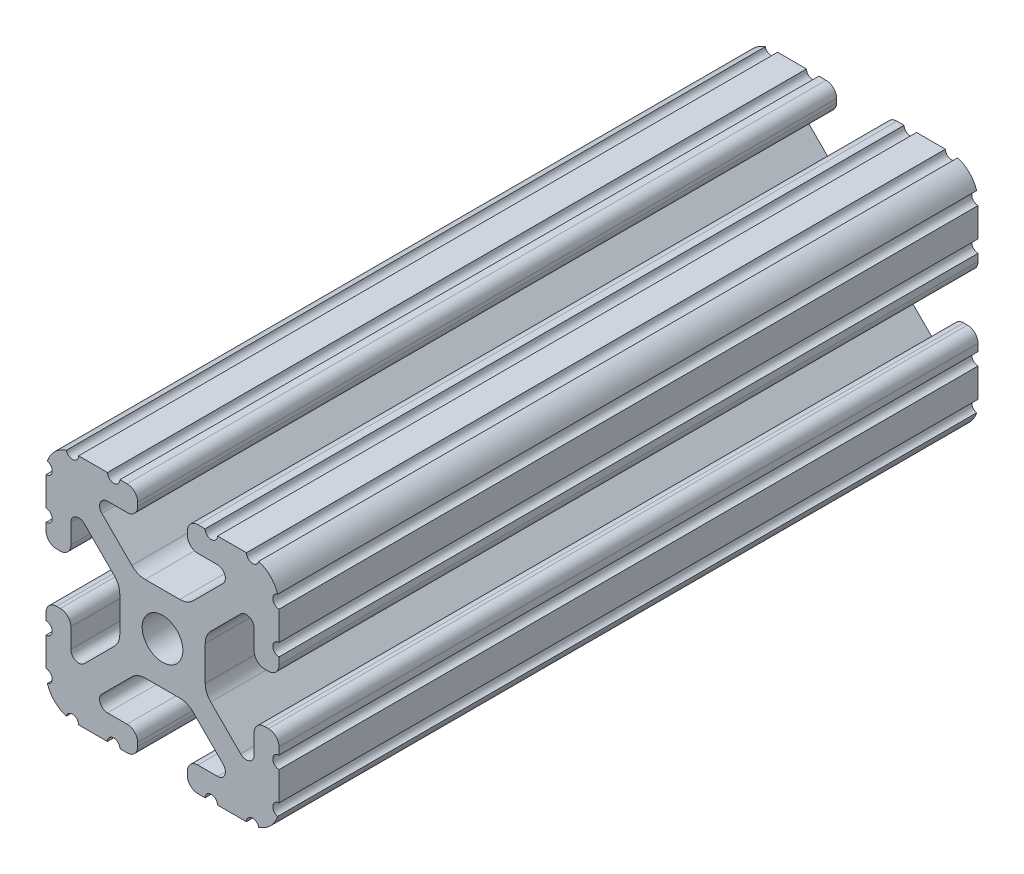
ISO-10303-21;
HEADER;
FILE_DESCRIPTION(('STEP AP214'),'2;1');
FILE_NAME('part.step','',(''),(''),'','','');
FILE_SCHEMA(('AUTOMOTIVE_DESIGN { 1 0 10303 214 1 1 1 1 }'));
ENDSEC;
DATA;
#1=APPLICATION_CONTEXT('core data for automotive mechanical design processes');
#2=APPLICATION_PROTOCOL_DEFINITION('international standard','automotive_design',2000,#1);
#3=PRODUCT_CONTEXT('',#1,'mechanical');
#4=PRODUCT('Part','Part','',(#3));
#5=PRODUCT_RELATED_PRODUCT_CATEGORY('part','',(#4));
#6=PRODUCT_DEFINITION_FORMATION('','',#4);
#7=PRODUCT_DEFINITION_CONTEXT('part definition',#1,'design');
#8=PRODUCT_DEFINITION('design','',#6,#7);
#9=PRODUCT_DEFINITION_SHAPE('','',#8);
#10=(LENGTH_UNIT() NAMED_UNIT(*) SI_UNIT(.MILLI.,.METRE.));
#11=(NAMED_UNIT(*) PLANE_ANGLE_UNIT() SI_UNIT($,.RADIAN.));
#12=(NAMED_UNIT(*) SI_UNIT($,.STERADIAN.) SOLID_ANGLE_UNIT());
#13=UNCERTAINTY_MEASURE_WITH_UNIT(LENGTH_MEASURE(1.E-05),#10,'distance_accuracy_value','');
#14=(GEOMETRIC_REPRESENTATION_CONTEXT(3) GLOBAL_UNCERTAINTY_ASSIGNED_CONTEXT((#13)) GLOBAL_UNIT_ASSIGNED_CONTEXT((#10,
#11,#12)) REPRESENTATION_CONTEXT('',''));
#15=CARTESIAN_POINT('',(0.,0.,0.));
#16=DIRECTION('',(0.,0.,1.));
#17=DIRECTION('',(1.,0.,0.));
#18=AXIS2_PLACEMENT_3D('',#15,#16,#17);
#19=CARTESIAN_POINT('',(5.7912,-19.05,457.2));
#20=DIRECTION('',(0.,1.,0.));
#21=DIRECTION('',(-1.,0.,0.));
#22=AXIS2_PLACEMENT_3D('',#19,#20,#21);
#23=PLANE('',#22);
#24=DIRECTION('',(1.,0.,0.));
#25=VECTOR('',#24,1.);
#26=CARTESIAN_POINT('',(5.7912,-19.05,-342.9));
#27=LINE('',#26,#25);
#28=CARTESIAN_POINT('',(5.7912,-19.05,-342.9));
#29=VERTEX_POINT('',#28);
#30=CARTESIAN_POINT('',(6.96430523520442,-19.05,-342.9));
#31=VERTEX_POINT('',#30);
#32=EDGE_CURVE('E1137',#29,#31,#27,.T.);
#33=ORIENTED_EDGE('',*,*,#32,.F.);
#34=DIRECTION('',(0.,0.,-1.));
#35=VECTOR('',#34,1.);
#36=CARTESIAN_POINT('',(5.7912,-19.05,457.2));
#37=LINE('',#36,#35);
#38=CARTESIAN_POINT('',(5.7912,-19.05,-457.2));
#39=VERTEX_POINT('',#38);
#40=EDGE_CURVE('E1091',#29,#39,#37,.T.);
#41=ORIENTED_EDGE('',*,*,#40,.T.);
#42=DIRECTION('',(1.,0.,0.));
#43=VECTOR('',#42,1.);
#44=CARTESIAN_POINT('',(5.7912,-19.05,-457.2));
#45=LINE('',#44,#43);
#46=CARTESIAN_POINT('',(6.96430523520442,-19.05,-457.2));
#47=VERTEX_POINT('',#46);
#48=EDGE_CURVE('E1003',#39,#47,#45,.T.);
#49=ORIENTED_EDGE('',*,*,#48,.T.);
#50=DIRECTION('',(0.,0.,1.));
#51=VECTOR('',#50,1.);
#52=CARTESIAN_POINT('',(6.96430523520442,-19.05,-457.2));
#53=LINE('',#52,#51);
#54=EDGE_CURVE('E986',#47,#31,#53,.T.);
#55=ORIENTED_EDGE('',*,*,#54,.T.);
#56=EDGE_LOOP('',(#33,#41,#49,#55));
#57=FACE_BOUND('',#56,.T.);
#58=ADVANCED_FACE('F37',(#57),#23,.F.);
#59=CARTESIAN_POINT('',(19.05,-5.7912,457.2));
#60=DIRECTION('',(-1.,0.,0.));
#61=DIRECTION('',(0.,-1.,0.));
#62=AXIS2_PLACEMENT_3D('',#59,#60,#61);
#63=PLANE('',#62);
#64=DIRECTION('',(0.,1.,0.));
#65=VECTOR('',#64,1.);
#66=CARTESIAN_POINT('',(19.05,-5.7912,-342.9));
#67=LINE('',#66,#65);
#68=CARTESIAN_POINT('',(19.05,-13.7234770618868,-342.9));
#69=VERTEX_POINT('',#68);
#70=CARTESIAN_POINT('',(19.05,-8.99630523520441,-342.9));
#71=VERTEX_POINT('',#70);
#72=EDGE_CURVE('E1110',#69,#71,#67,.T.);
#73=ORIENTED_EDGE('',*,*,#72,.F.);
#74=DIRECTION('',(0.,0.,1.));
#75=VECTOR('',#74,1.);
#76=CARTESIAN_POINT('',(19.05,-13.7234770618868,-457.2));
#77=LINE('',#76,#75);
#78=CARTESIAN_POINT('',(19.05,-13.7234770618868,-457.2));
#79=VERTEX_POINT('',#78);
#80=EDGE_CURVE('E989',#69,#79,#77,.F.);
#81=ORIENTED_EDGE('',*,*,#80,.T.);
#82=DIRECTION('',(0.,1.,0.));
#83=VECTOR('',#82,1.);
#84=CARTESIAN_POINT('',(19.05,-5.7912,-457.2));
#85=LINE('',#84,#83);
#86=CARTESIAN_POINT('',(19.05,-8.99630523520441,-457.2));
#87=VERTEX_POINT('',#86);
#88=EDGE_CURVE('E1012',#79,#87,#85,.T.);
#89=ORIENTED_EDGE('',*,*,#88,.T.);
#90=DIRECTION('',(0.,0.,1.));
#91=VECTOR('',#90,1.);
#92=CARTESIAN_POINT('',(19.05,-8.99630523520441,-457.2));
#93=LINE('',#92,#91);
#94=EDGE_CURVE('E996',#87,#71,#93,.T.);
#95=ORIENTED_EDGE('',*,*,#94,.T.);
#96=EDGE_LOOP('',(#73,#81,#89,#95));
#97=FACE_BOUND('',#96,.T.);
#98=ADVANCED_FACE('F1107',(#97),#63,.F.);
#99=CARTESIAN_POINT('',(5.7912,-17.3228,457.2));
#100=DIRECTION('',(0.,0.,-1.));
#101=DIRECTION('',(-1.,0.,0.));
#102=AXIS2_PLACEMENT_3D('',#99,#100,#101);
#103=CYLINDRICAL_SURFACE('',#102,1.7272);
#104=CARTESIAN_POINT('',(5.7912,-17.3228,-342.9));
#105=DIRECTION('',(0.,0.,1.));
#106=DIRECTION('',(1.,0.,0.));
#107=AXIS2_PLACEMENT_3D('',#104,#105,#106);
#108=CIRCLE('',#107,1.7272);
#109=CARTESIAN_POINT('',(4.064,-17.3228,-342.9));
#110=VERTEX_POINT('',#109);
#111=EDGE_CURVE('E1140',#110,#29,#108,.T.);
#112=ORIENTED_EDGE('',*,*,#111,.F.);
#113=DIRECTION('',(0.,0.,-1.));
#114=VECTOR('',#113,1.);
#115=CARTESIAN_POINT('',(4.064,-17.3228,457.2));
#116=LINE('',#115,#114);
#117=CARTESIAN_POINT('',(4.064,-17.3228,-457.2));
#118=VERTEX_POINT('',#117);
#119=EDGE_CURVE('E1061',#110,#118,#116,.T.);
#120=ORIENTED_EDGE('',*,*,#119,.T.);
#121=CARTESIAN_POINT('',(5.7912,-17.3228,-457.2));
#122=DIRECTION('',(0.,0.,1.));
#123=DIRECTION('',(1.,0.,0.));
#124=AXIS2_PLACEMENT_3D('',#121,#122,#123);
#125=CIRCLE('',#124,1.7272);
#126=EDGE_CURVE('E999',#118,#39,#125,.T.);
#127=ORIENTED_EDGE('',*,*,#126,.T.);
#128=ORIENTED_EDGE('',*,*,#40,.F.);
#129=EDGE_LOOP('',(#112,#120,#127,#128));
#130=FACE_BOUND('',#129,.T.);
#131=ADVANCED_FACE('F39',(#130),#103,.T.);
#132=DIRECTION('',(1.,0.,0.));
#133=VECTOR('',#132,1.);
#134=CARTESIAN_POINT('',(5.7912,-19.05,-342.9));
#135=LINE('',#134,#133);
#136=CARTESIAN_POINT('',(8.99630523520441,-19.05,-342.9));
#137=VERTEX_POINT('',#136);
#138=CARTESIAN_POINT('',(13.7234770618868,-19.05,-342.9));
#139=VERTEX_POINT('',#138);
#140=EDGE_CURVE('E1128',#137,#139,#135,.T.);
#141=ORIENTED_EDGE('',*,*,#140,.F.);
#142=DIRECTION('',(0.,0.,1.));
#143=VECTOR('',#142,1.);
#144=CARTESIAN_POINT('',(8.99630523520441,-19.05,-457.2));
#145=LINE('',#144,#143);
#146=CARTESIAN_POINT('',(8.99630523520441,-19.05,-457.2));
#147=VERTEX_POINT('',#146);
#148=EDGE_CURVE('E984',#137,#147,#145,.F.);
#149=ORIENTED_EDGE('',*,*,#148,.T.);
#150=CARTESIAN_POINT('',(13.7234770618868,-19.05,-457.2));
#151=VERTEX_POINT('',#150);
#152=EDGE_CURVE('E1002',#147,#151,#45,.T.);
#153=ORIENTED_EDGE('',*,*,#152,.T.);
#154=DIRECTION('',(0.,0.,1.));
#155=VECTOR('',#154,1.);
#156=CARTESIAN_POINT('',(13.7234770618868,-19.05,-457.2));
#157=LINE('',#156,#155);
#158=EDGE_CURVE('E59',#151,#139,#157,.T.);
#159=ORIENTED_EDGE('',*,*,#158,.T.);
#160=EDGE_LOOP('',(#141,#149,#153,#159));
#161=FACE_BOUND('',#160,.T.);
#162=ADVANCED_FACE('F1125',(#161),#23,.F.);
#163=CARTESIAN_POINT('',(14.3002,-14.3002,457.2));
#164=DIRECTION('',(0.,0.,-1.));
#165=DIRECTION('',(-1.,0.,0.));
#166=AXIS2_PLACEMENT_3D('',#163,#164,#165);
#167=CYLINDRICAL_SURFACE('',#166,4.7498);
#168=CARTESIAN_POINT('',(14.3002,-14.3002,-342.9));
#169=DIRECTION('',(0.,0.,1.));
#170=DIRECTION('',(1.,0.,0.));
#171=AXIS2_PLACEMENT_3D('',#168,#169,#170);
#172=CIRCLE('',#171,4.7498);
#173=CARTESIAN_POINT('',(15.7312177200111,-18.8293045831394,-342.9));
#174=VERTEX_POINT('',#173);
#175=CARTESIAN_POINT('',(18.8293045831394,-15.7312177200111,-342.9));
#176=VERTEX_POINT('',#175);
#177=EDGE_CURVE('E1119',#174,#176,#172,.T.);
#178=ORIENTED_EDGE('',*,*,#177,.F.);
#179=DIRECTION('',(0.,0.,1.));
#180=VECTOR('',#179,1.);
#181=CARTESIAN_POINT('',(15.7312177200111,-18.8293045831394,-1.11022302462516E-13));
#182=LINE('',#181,#180);
#183=CARTESIAN_POINT('',(15.7312177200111,-18.8293045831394,-457.2));
#184=VERTEX_POINT('',#183);
#185=EDGE_CURVE('E981',#174,#184,#182,.F.);
#186=ORIENTED_EDGE('',*,*,#185,.T.);
#187=CARTESIAN_POINT('',(14.3002,-14.3002,-457.2));
#188=DIRECTION('',(0.,0.,1.));
#189=DIRECTION('',(1.,0.,0.));
#190=AXIS2_PLACEMENT_3D('',#187,#188,#189);
#191=CIRCLE('',#190,4.7498);
#192=CARTESIAN_POINT('',(18.8293045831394,-15.7312177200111,-457.2));
#193=VERTEX_POINT('',#192);
#194=EDGE_CURVE('E1006',#184,#193,#191,.T.);
#195=ORIENTED_EDGE('',*,*,#194,.T.);
#196=DIRECTION('',(0.,0.,1.));
#197=VECTOR('',#196,1.);
#198=CARTESIAN_POINT('',(18.8293045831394,-15.7312177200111,-1.11022302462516E-13));
#199=LINE('',#198,#197);
#200=EDGE_CURVE('E991',#193,#176,#199,.T.);
#201=ORIENTED_EDGE('',*,*,#200,.T.);
#202=EDGE_LOOP('',(#178,#186,#195,#201));
#203=FACE_BOUND('',#202,.T.);
#204=ADVANCED_FACE('F1117',(#203),#167,.T.);
#205=DIRECTION('',(0.,1.,0.));
#206=VECTOR('',#205,1.);
#207=CARTESIAN_POINT('',(19.05,-5.7912,-342.9));
#208=LINE('',#207,#206);
#209=CARTESIAN_POINT('',(19.05,-6.96430523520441,-342.9));
#210=VERTEX_POINT('',#209);
#211=CARTESIAN_POINT('',(19.05,-5.7912,-342.9));
#212=VERTEX_POINT('',#211);
#213=EDGE_CURVE('E1542',#210,#212,#208,.T.);
#214=ORIENTED_EDGE('',*,*,#213,.F.);
#215=DIRECTION('',(0.,0.,1.));
#216=VECTOR('',#215,1.);
#217=CARTESIAN_POINT('',(19.05,-6.96430523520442,-457.2));
#218=LINE('',#217,#216);
#219=CARTESIAN_POINT('',(19.05,-6.96430523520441,-457.2));
#220=VERTEX_POINT('',#219);
#221=EDGE_CURVE('E994',#210,#220,#218,.F.);
#222=ORIENTED_EDGE('',*,*,#221,.T.);
#223=CARTESIAN_POINT('',(19.05,-5.7912,-457.2));
#224=VERTEX_POINT('',#223);
#225=EDGE_CURVE('E1009',#220,#224,#85,.T.);
#226=ORIENTED_EDGE('',*,*,#225,.T.);
#227=DIRECTION('',(0.,0.,-1.));
#228=VECTOR('',#227,1.);
#229=CARTESIAN_POINT('',(19.05,-5.7912,457.2));
#230=LINE('',#229,#228);
#231=EDGE_CURVE('E1089',#212,#224,#230,.T.);
#232=ORIENTED_EDGE('',*,*,#231,.F.);
#233=EDGE_LOOP('',(#214,#222,#226,#232));
#234=FACE_BOUND('',#233,.T.);
#235=ADVANCED_FACE('F1568',(#234),#63,.F.);
#236=CARTESIAN_POINT('',(17.3228,-5.7912,457.2));
#237=DIRECTION('',(0.,0.,-1.));
#238=DIRECTION('',(-1.,0.,0.));
#239=AXIS2_PLACEMENT_3D('',#236,#237,#238);
#240=CYLINDRICAL_SURFACE('',#239,1.7272);
#241=CARTESIAN_POINT('',(17.3228,-5.7912,-342.9));
#242=DIRECTION('',(0.,0.,1.));
#243=DIRECTION('',(1.,0.,0.));
#244=AXIS2_PLACEMENT_3D('',#241,#242,#243);
#245=CIRCLE('',#244,1.7272);
#246=CARTESIAN_POINT('',(17.3228,-4.064,-342.9));
#247=VERTEX_POINT('',#246);
#248=EDGE_CURVE('E1540',#212,#247,#245,.T.);
#249=ORIENTED_EDGE('',*,*,#248,.F.);
#250=ORIENTED_EDGE('',*,*,#231,.T.);
#251=CARTESIAN_POINT('',(17.3228,-5.7912,-457.2));
#252=DIRECTION('',(0.,0.,1.));
#253=DIRECTION('',(-1.,0.,0.));
#254=AXIS2_PLACEMENT_3D('',#251,#252,#253);
#255=CIRCLE('',#254,1.7272);
#256=CARTESIAN_POINT('',(17.3228,-4.064,-457.2));
#257=VERTEX_POINT('',#256);
#258=EDGE_CURVE('E1013',#224,#257,#255,.T.);
#259=ORIENTED_EDGE('',*,*,#258,.T.);
#260=DIRECTION('',(0.,0.,-1.));
#261=VECTOR('',#260,1.);
#262=CARTESIAN_POINT('',(17.3228,-4.064,457.2));
#263=LINE('',#262,#261);
#264=EDGE_CURVE('E1087',#247,#257,#263,.T.);
#265=ORIENTED_EDGE('',*,*,#264,.F.);
#266=EDGE_LOOP('',(#249,#250,#259,#265));
#267=FACE_BOUND('',#266,.T.);
#268=ADVANCED_FACE('F2397',(#267),#240,.T.);
#269=CARTESIAN_POINT('',(16.7132,-4.064,457.2));
#270=DIRECTION('',(0.,-1.,0.));
#271=DIRECTION('',(1.,0.,0.));
#272=AXIS2_PLACEMENT_3D('',#269,#270,#271);
#273=PLANE('',#272);
#274=DIRECTION('',(-1.,0.,0.));
#275=VECTOR('',#274,1.);
#276=CARTESIAN_POINT('',(16.7132,-4.064,-342.9));
#277=LINE('',#276,#275);
#278=CARTESIAN_POINT('',(16.7132,-4.064,-342.9));
#279=VERTEX_POINT('',#278);
#280=EDGE_CURVE('E1538',#247,#279,#277,.T.);
#281=ORIENTED_EDGE('',*,*,#280,.F.);
#282=ORIENTED_EDGE('',*,*,#264,.T.);
#283=DIRECTION('',(-1.,0.,0.));
#284=VECTOR('',#283,1.);
#285=CARTESIAN_POINT('',(16.7132,-4.064,-457.2));
#286=LINE('',#285,#284);
#287=CARTESIAN_POINT('',(16.7132,-4.064,-457.2));
#288=VERTEX_POINT('',#287);
#289=EDGE_CURVE('E1016',#257,#288,#286,.T.);
#290=ORIENTED_EDGE('',*,*,#289,.T.);
#291=DIRECTION('',(0.,0.,-1.));
#292=VECTOR('',#291,1.);
#293=CARTESIAN_POINT('',(16.7132,-4.064,457.2));
#294=LINE('',#293,#292);
#295=EDGE_CURVE('E1085',#279,#288,#294,.T.);
#296=ORIENTED_EDGE('',*,*,#295,.F.);
#297=EDGE_LOOP('',(#281,#282,#290,#296));
#298=FACE_BOUND('',#297,.T.);
#299=ADVANCED_FACE('F2387',(#298),#273,.F.);
#300=CARTESIAN_POINT('',(16.7132,-5.7912,457.2));
#301=DIRECTION('',(0.,0.,-1.));
#302=DIRECTION('',(-1.,0.,0.));
#303=AXIS2_PLACEMENT_3D('',#300,#301,#302);
#304=CYLINDRICAL_SURFACE('',#303,1.7272);
#305=CARTESIAN_POINT('',(16.7132,-5.7912,-342.9));
#306=DIRECTION('',(0.,0.,1.));
#307=DIRECTION('',(1.,0.,0.));
#308=AXIS2_PLACEMENT_3D('',#305,#306,#307);
#309=CIRCLE('',#308,1.7272);
#310=CARTESIAN_POINT('',(14.986,-5.7912,-342.9));
#311=VERTEX_POINT('',#310);
#312=EDGE_CURVE('E1536',#279,#311,#309,.T.);
#313=ORIENTED_EDGE('',*,*,#312,.F.);
#314=ORIENTED_EDGE('',*,*,#295,.T.);
#315=CARTESIAN_POINT('',(16.7132,-5.7912,-457.2));
#316=DIRECTION('',(0.,0.,1.));
#317=DIRECTION('',(-1.,0.,0.));
#318=AXIS2_PLACEMENT_3D('',#315,#316,#317);
#319=CIRCLE('',#318,1.7272);
#320=CARTESIAN_POINT('',(14.986,-5.7912,-457.2));
#321=VERTEX_POINT('',#320);
#322=EDGE_CURVE('E1019',#288,#321,#319,.T.);
#323=ORIENTED_EDGE('',*,*,#322,.T.);
#324=DIRECTION('',(0.,0.,-1.));
#325=VECTOR('',#324,1.);
#326=CARTESIAN_POINT('',(14.986,-5.7912,457.2));
#327=LINE('',#326,#325);
#328=EDGE_CURVE('E1083',#311,#321,#327,.T.);
#329=ORIENTED_EDGE('',*,*,#328,.F.);
#330=EDGE_LOOP('',(#313,#314,#323,#329));
#331=FACE_BOUND('',#330,.T.);
#332=ADVANCED_FACE('F2377',(#331),#304,.T.);
#333=CARTESIAN_POINT('',(14.986,-8.99630523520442,457.2));
#334=DIRECTION('',(1.,0.,0.));
#335=DIRECTION('',(0.,0.,-1.));
#336=AXIS2_PLACEMENT_3D('',#333,#334,#335);
#337=PLANE('',#336);
#338=DIRECTION('',(0.,-1.,0.));
#339=VECTOR('',#338,1.);
#340=CARTESIAN_POINT('',(14.986,-8.99630523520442,-342.9));
#341=LINE('',#340,#339);
#342=CARTESIAN_POINT('',(14.986,-8.99630523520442,-342.9));
#343=VERTEX_POINT('',#342);
#344=EDGE_CURVE('E1534',#311,#343,#341,.T.);
#345=ORIENTED_EDGE('',*,*,#344,.F.);
#346=ORIENTED_EDGE('',*,*,#328,.T.);
#347=DIRECTION('',(0.,-1.,0.));
#348=VECTOR('',#347,1.);
#349=CARTESIAN_POINT('',(14.986,-8.99630523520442,-457.2));
#350=LINE('',#349,#348);
#351=CARTESIAN_POINT('',(14.986,-8.99630523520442,-457.2));
#352=VERTEX_POINT('',#351);
#353=EDGE_CURVE('E1022',#321,#352,#350,.T.);
#354=ORIENTED_EDGE('',*,*,#353,.T.);
#355=DIRECTION('',(0.,0.,-1.));
#356=VECTOR('',#355,1.);
#357=CARTESIAN_POINT('',(14.986,-8.99630523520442,457.2));
#358=LINE('',#357,#356);
#359=EDGE_CURVE('E1081',#343,#352,#358,.T.);
#360=ORIENTED_EDGE('',*,*,#359,.F.);
#361=EDGE_LOOP('',(#345,#346,#354,#360));
#362=FACE_BOUND('',#361,.T.);
#363=ADVANCED_FACE('F2367',(#362),#337,.F.);
#364=CARTESIAN_POINT('',(13.6953052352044,-8.99630523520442,457.2));
#365=DIRECTION('',(0.,0.,-1.));
#366=DIRECTION('',(-1.,0.,0.));
#367=AXIS2_PLACEMENT_3D('',#364,#365,#366);
#368=CYLINDRICAL_SURFACE('',#367,1.29069476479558);
#369=CARTESIAN_POINT('',(13.6953052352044,-8.99630523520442,-342.9));
#370=DIRECTION('',(0.,0.,1.));
#371=DIRECTION('',(1.,0.,0.));
#372=AXIS2_PLACEMENT_3D('',#369,#370,#371);
#373=CIRCLE('',#372,1.29069476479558);
#374=CARTESIAN_POINT('',(12.7826462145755,-9.90896425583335,-342.9));
#375=VERTEX_POINT('',#374);
#376=EDGE_CURVE('E1532',#343,#375,#373,.F.);
#377=ORIENTED_EDGE('',*,*,#376,.F.);
#378=ORIENTED_EDGE('',*,*,#359,.T.);
#379=CARTESIAN_POINT('',(13.6953052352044,-8.99630523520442,-457.2));
#380=DIRECTION('',(0.,0.,-1.));
#381=DIRECTION('',(1.,0.,0.));
#382=AXIS2_PLACEMENT_3D('',#379,#380,#381);
#383=CIRCLE('',#382,1.29069476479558);
#384=CARTESIAN_POINT('',(12.7826462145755,-9.90896425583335,-457.2));
#385=VERTEX_POINT('',#384);
#386=EDGE_CURVE('E1025',#352,#385,#383,.T.);
#387=ORIENTED_EDGE('',*,*,#386,.T.);
#388=DIRECTION('',(0.,0.,-1.));
#389=VECTOR('',#388,1.);
#390=CARTESIAN_POINT('',(12.7826462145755,-9.90896425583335,457.2));
#391=LINE('',#390,#389);
#392=EDGE_CURVE('E1079',#375,#385,#391,.T.);
#393=ORIENTED_EDGE('',*,*,#392,.F.);
#394=EDGE_LOOP('',(#377,#378,#387,#393));
#395=FACE_BOUND('',#394,.T.);
#396=ADVANCED_FACE('F2357',(#395),#368,.F.);
#397=CARTESIAN_POINT('',(12.7826462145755,-9.90896425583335,457.2));
#398=DIRECTION('',(-0.707106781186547,-0.707106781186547,0.));
#399=DIRECTION('',(0.707106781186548,-0.707106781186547,0.));
#400=AXIS2_PLACEMENT_3D('',#397,#398,#399);
#401=PLANE('',#400);
#402=DIRECTION('',(-0.707106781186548,0.707106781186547,0.));
#403=VECTOR('',#402,1.);
#404=CARTESIAN_POINT('',(12.7826462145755,-9.90896425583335,-342.9));
#405=LINE('',#404,#403);
#406=CARTESIAN_POINT('',(7.8888977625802,-5.01521580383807,-342.9));
#407=VERTEX_POINT('',#406);
#408=EDGE_CURVE('E1530',#375,#407,#405,.T.);
#409=ORIENTED_EDGE('',*,*,#408,.F.);
#410=ORIENTED_EDGE('',*,*,#392,.T.);
#411=DIRECTION('',(-0.707106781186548,0.707106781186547,0.));
#412=VECTOR('',#411,1.);
#413=CARTESIAN_POINT('',(12.7826462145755,-9.90896425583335,-457.2));
#414=LINE('',#413,#412);
#415=CARTESIAN_POINT('',(7.8888977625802,-5.01521580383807,-457.2));
#416=VERTEX_POINT('',#415);
#417=EDGE_CURVE('E1028',#385,#416,#414,.T.);
#418=ORIENTED_EDGE('',*,*,#417,.T.);
#419=DIRECTION('',(0.,0.,-1.));
#420=VECTOR('',#419,1.);
#421=CARTESIAN_POINT('',(7.8888977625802,-5.01521580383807,457.2));
#422=LINE('',#421,#420);
#423=EDGE_CURVE('E1077',#407,#416,#422,.T.);
#424=ORIENTED_EDGE('',*,*,#423,.F.);
#425=EDGE_LOOP('',(#409,#410,#418,#424));
#426=FACE_BOUND('',#425,.T.);
#427=ADVANCED_FACE('F2347',(#426),#401,.F.);
#428=CARTESIAN_POINT('',(10.0711,-2.83301356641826,457.2));
#429=DIRECTION('',(0.,0.,-1.));
#430=DIRECTION('',(-1.,0.,0.));
#431=AXIS2_PLACEMENT_3D('',#428,#429,#430);
#432=CYLINDRICAL_SURFACE('',#431,3.0861);
#433=CARTESIAN_POINT('',(10.0711,-2.83301356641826,-342.9));
#434=DIRECTION('',(0.,0.,1.));
#435=DIRECTION('',(1.,0.,0.));
#436=AXIS2_PLACEMENT_3D('',#433,#434,#435);
#437=CIRCLE('',#436,3.0861);
#438=CARTESIAN_POINT('',(6.985,-2.83301356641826,-342.9));
#439=VERTEX_POINT('',#438);
#440=EDGE_CURVE('E1528',#407,#439,#437,.F.);
#441=ORIENTED_EDGE('',*,*,#440,.F.);
#442=ORIENTED_EDGE('',*,*,#423,.T.);
#443=CARTESIAN_POINT('',(10.0711,-2.83301356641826,-457.2));
#444=DIRECTION('',(0.,0.,-1.));
#445=DIRECTION('',(-1.,0.,0.));
#446=AXIS2_PLACEMENT_3D('',#443,#444,#445);
#447=CIRCLE('',#446,3.0861);
#448=CARTESIAN_POINT('',(6.985,-2.83301356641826,-457.2));
#449=VERTEX_POINT('',#448);
#450=EDGE_CURVE('E1031',#416,#449,#447,.T.);
#451=ORIENTED_EDGE('',*,*,#450,.T.);
#452=DIRECTION('',(0.,0.,-1.));
#453=VECTOR('',#452,1.);
#454=CARTESIAN_POINT('',(6.985,-2.83301356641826,457.2));
#455=LINE('',#454,#453);
#456=EDGE_CURVE('E1075',#439,#449,#455,.T.);
#457=ORIENTED_EDGE('',*,*,#456,.F.);
#458=EDGE_LOOP('',(#441,#442,#451,#457));
#459=FACE_BOUND('',#458,.T.);
#460=ADVANCED_FACE('F1560',(#459),#432,.F.);
#461=CARTESIAN_POINT('',(6.985,0.,457.2));
#462=DIRECTION('',(-1.,0.,0.));
#463=DIRECTION('',(0.,0.,1.));
#464=AXIS2_PLACEMENT_3D('',#461,#462,#463);
#465=PLANE('',#464);
#466=DIRECTION('',(0.,1.,0.));
#467=VECTOR('',#466,1.);
#468=CARTESIAN_POINT('',(6.985,0.,-342.9));
#469=LINE('',#468,#467);
#470=CARTESIAN_POINT('',(6.985,2.83301356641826,-342.9));
#471=VERTEX_POINT('',#470);
#472=EDGE_CURVE('E1526',#439,#471,#469,.T.);
#473=ORIENTED_EDGE('',*,*,#472,.F.);
#474=ORIENTED_EDGE('',*,*,#456,.T.);
#475=DIRECTION('',(0.,1.,0.));
#476=VECTOR('',#475,1.);
#477=CARTESIAN_POINT('',(6.985,0.,-457.2));
#478=LINE('',#477,#476);
#479=CARTESIAN_POINT('',(6.985,2.83301356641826,-457.2));
#480=VERTEX_POINT('',#479);
#481=EDGE_CURVE('E1034',#449,#480,#478,.T.);
#482=ORIENTED_EDGE('',*,*,#481,.T.);
#483=DIRECTION('',(0.,0.,-1.));
#484=VECTOR('',#483,1.);
#485=CARTESIAN_POINT('',(6.985,2.83301356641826,457.2));
#486=LINE('',#485,#484);
#487=EDGE_CURVE('E838',#471,#480,#486,.T.);
#488=ORIENTED_EDGE('',*,*,#487,.F.);
#489=EDGE_LOOP('',(#473,#474,#482,#488));
#490=FACE_BOUND('',#489,.T.);
#491=ADVANCED_FACE('F1552',(#490),#465,.F.);
#492=CARTESIAN_POINT('',(0.,0.,457.2));
#493=DIRECTION('',(0.,0.,-1.));
#494=DIRECTION('',(-1.,0.,0.));
#495=AXIS2_PLACEMENT_3D('',#492,#493,#494);
#496=CYLINDRICAL_SURFACE('',#495,3.32740000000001);
#497=CARTESIAN_POINT('',(0.,0.,-457.2));
#498=DIRECTION('',(0.,0.,-1.));
#499=DIRECTION('',(1.,0.,0.));
#500=AXIS2_PLACEMENT_3D('',#497,#498,#499);
#501=CIRCLE('',#500,3.32740000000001);
#502=CARTESIAN_POINT('',(-3.32740000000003,0.,-457.2));
#503=VERTEX_POINT('',#502);
#504=EDGE_CURVE('E1037',#503,#503,#501,.T.);
#505=CARTESIAN_POINT('',(0.,0.,-342.9));
#506=DIRECTION('',(0.,0.,1.));
#507=DIRECTION('',(1.,0.,0.));
#508=AXIS2_PLACEMENT_3D('',#505,#506,#507);
#509=CIRCLE('',#508,3.32740000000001);
#510=CARTESIAN_POINT('',(-3.32740000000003,0.,-342.9));
#511=VERTEX_POINT('',#510);
#512=EDGE_CURVE('E1377',#511,#511,#509,.F.);
#513=CARTESIAN_POINT('',(-3.32740000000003,0.,-457.2));
#514=CARTESIAN_POINT('',(-3.32740000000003,0.,-456.009375));
#515=CARTESIAN_POINT('',(-3.32740000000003,0.,-454.81875));
#516=CARTESIAN_POINT('',(-3.32740000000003,0.,-452.4375));
#517=CARTESIAN_POINT('',(-3.32740000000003,0.,-451.246875));
#518=CARTESIAN_POINT('',(-3.32740000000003,0.,-448.865625));
#519=CARTESIAN_POINT('',(-3.32740000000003,0.,-447.675));
#520=CARTESIAN_POINT('',(-3.32740000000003,0.,-445.29375));
#521=CARTESIAN_POINT('',(-3.32740000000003,0.,-444.103125));
#522=CARTESIAN_POINT('',(-3.32740000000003,0.,-441.721875));
#523=CARTESIAN_POINT('',(-3.32740000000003,0.,-440.53125));
#524=CARTESIAN_POINT('',(-3.32740000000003,0.,-438.15));
#525=CARTESIAN_POINT('',(-3.32740000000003,0.,-436.959375));
#526=CARTESIAN_POINT('',(-3.32740000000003,0.,-434.578125));
#527=CARTESIAN_POINT('',(-3.32740000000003,0.,-433.3875));
#528=CARTESIAN_POINT('',(-3.32740000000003,0.,-431.00625));
#529=CARTESIAN_POINT('',(-3.32740000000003,0.,-429.815625));
#530=CARTESIAN_POINT('',(-3.32740000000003,0.,-427.434375));
#531=CARTESIAN_POINT('',(-3.32740000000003,0.,-426.24375));
#532=CARTESIAN_POINT('',(-3.32740000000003,0.,-423.8625));
#533=CARTESIAN_POINT('',(-3.32740000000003,0.,-422.671875));
#534=CARTESIAN_POINT('',(-3.32740000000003,0.,-420.290625));
#535=CARTESIAN_POINT('',(-3.32740000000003,0.,-419.1));
#536=CARTESIAN_POINT('',(-3.32740000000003,0.,-416.71875));
#537=CARTESIAN_POINT('',(-3.32740000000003,0.,-415.528125));
#538=CARTESIAN_POINT('',(-3.32740000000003,0.,-413.146875));
#539=CARTESIAN_POINT('',(-3.32740000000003,0.,-411.95625));
#540=CARTESIAN_POINT('',(-3.32740000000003,0.,-409.575));
#541=CARTESIAN_POINT('',(-3.32740000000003,0.,-408.384375));
#542=CARTESIAN_POINT('',(-3.32740000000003,0.,-406.003125));
#543=CARTESIAN_POINT('',(-3.32740000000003,0.,-404.8125));
#544=CARTESIAN_POINT('',(-3.32740000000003,0.,-402.43125));
#545=CARTESIAN_POINT('',(-3.32740000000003,0.,-401.240625));
#546=CARTESIAN_POINT('',(-3.32740000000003,0.,-398.859375));
#547=CARTESIAN_POINT('',(-3.32740000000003,0.,-397.66875));
#548=CARTESIAN_POINT('',(-3.32740000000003,0.,-395.2875));
#549=CARTESIAN_POINT('',(-3.32740000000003,0.,-394.096875));
#550=CARTESIAN_POINT('',(-3.32740000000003,0.,-391.715625));
#551=CARTESIAN_POINT('',(-3.32740000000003,0.,-390.525));
#552=CARTESIAN_POINT('',(-3.32740000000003,0.,-388.14375));
#553=CARTESIAN_POINT('',(-3.32740000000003,0.,-386.953125));
#554=CARTESIAN_POINT('',(-3.32740000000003,0.,-384.571875));
#555=CARTESIAN_POINT('',(-3.32740000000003,0.,-383.38125));
#556=CARTESIAN_POINT('',(-3.32740000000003,0.,-381.));
#557=CARTESIAN_POINT('',(-3.32740000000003,0.,-379.809375));
#558=CARTESIAN_POINT('',(-3.32740000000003,0.,-377.428125));
#559=CARTESIAN_POINT('',(-3.32740000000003,0.,-376.2375));
#560=CARTESIAN_POINT('',(-3.32740000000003,0.,-373.85625));
#561=CARTESIAN_POINT('',(-3.32740000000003,0.,-372.665625));
#562=CARTESIAN_POINT('',(-3.32740000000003,0.,-370.284375));
#563=CARTESIAN_POINT('',(-3.32740000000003,0.,-369.09375));
#564=CARTESIAN_POINT('',(-3.32740000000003,0.,-366.7125));
#565=CARTESIAN_POINT('',(-3.32740000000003,0.,-365.521875));
#566=CARTESIAN_POINT('',(-3.32740000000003,0.,-363.140625));
#567=CARTESIAN_POINT('',(-3.32740000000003,0.,-361.95));
#568=CARTESIAN_POINT('',(-3.32740000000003,0.,-359.56875));
#569=CARTESIAN_POINT('',(-3.32740000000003,0.,-358.378125));
#570=CARTESIAN_POINT('',(-3.32740000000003,0.,-355.996875));
#571=CARTESIAN_POINT('',(-3.32740000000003,0.,-354.80625));
#572=CARTESIAN_POINT('',(-3.32740000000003,0.,-352.425));
#573=CARTESIAN_POINT('',(-3.32740000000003,0.,-351.234375));
#574=CARTESIAN_POINT('',(-3.32740000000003,0.,-348.853125));
#575=CARTESIAN_POINT('',(-3.32740000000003,0.,-347.6625));
#576=CARTESIAN_POINT('',(-3.32740000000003,0.,-345.28125));
#577=CARTESIAN_POINT('',(-3.32740000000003,0.,-344.090625));
#578=CARTESIAN_POINT('',(-3.32740000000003,0.,-342.9));
#579=B_SPLINE_CURVE_WITH_KNOTS('',3,(#513,#514,#515,#516,#517,#518,#519,#520,#521,#522,#523,
#524,#525,#526,#527,#528,#529,#530,#531,#532,#533,#534,#535,#536,#537,#538,#539,#540,#541,#542,
#543,#544,#545,#546,#547,#548,#549,#550,#551,#552,#553,#554,#555,#556,#557,#558,#559,#560,#561,
#562,#563,#564,#565,#566,#567,#568,#569,#570,#571,#572,#573,#574,#575,#576,#577,#578),
.UNSPECIFIED.,.F.,.F.,(4,2,2,2,2,2,2,2,2,2,2,2,2,2,2,2,2,2,2,2,2,2,2,2,2,2,2,2,2,2,2,2,4),(0.,
3.571875,7.14375,10.715625,14.2875,17.859375,21.43125,25.003125,28.575,32.1468749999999,
35.7187499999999,39.2906249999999,42.8624999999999,46.4343749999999,50.0062499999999,
53.5781249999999,57.1499999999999,60.7218749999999,64.2937499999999,67.8656249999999,
71.4374999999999,75.0093749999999,78.5812499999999,82.1531249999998,85.7249999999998,
89.2968749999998,92.8687499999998,96.4406249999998,100.0125,103.584375,107.15625,110.728125,
114.3),.UNSPECIFIED.);
#580=EDGE_CURVE('BSEAM1549',#503,#511,#579,.T.);
#581=ORIENTED_EDGE('',*,*,#504,.T.);
#582=ORIENTED_EDGE('',*,*,#512,.F.);
#583=ORIENTED_EDGE('',*,*,#580,.T.);
#584=ORIENTED_EDGE('',*,*,#580,.F.);
#585=EDGE_LOOP('',(#581,#583,#582,#584));
#586=FACE_BOUND('',#585,.T.);
#587=ADVANCED_FACE('F1549',(#586),#496,.F.);
#588=CARTESIAN_POINT('',(0.,-6.985,457.2));
#589=DIRECTION('',(0.,1.,0.));
#590=DIRECTION('',(0.,0.,1.));
#591=AXIS2_PLACEMENT_3D('',#588,#589,#590);
#592=PLANE('',#591);
#593=DIRECTION('',(1.,0.,0.));
#594=VECTOR('',#593,1.);
#595=CARTESIAN_POINT('',(0.,-6.985,-342.9));
#596=LINE('',#595,#594);
#597=CARTESIAN_POINT('',(-2.83301356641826,-6.985,-342.9));
#598=VERTEX_POINT('',#597);
#599=CARTESIAN_POINT('',(2.83301356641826,-6.985,-342.9));
#600=VERTEX_POINT('',#599);
#601=EDGE_CURVE('E1484',#598,#600,#596,.T.);
#602=ORIENTED_EDGE('',*,*,#601,.F.);
#603=DIRECTION('',(0.,0.,-1.));
#604=VECTOR('',#603,1.);
#605=CARTESIAN_POINT('',(-2.83301356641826,-6.985,457.2));
#606=LINE('',#605,#604);
#607=CARTESIAN_POINT('',(-2.83301356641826,-6.985,-457.2));
#608=VERTEX_POINT('',#607);
#609=EDGE_CURVE('E952',#598,#608,#606,.T.);
#610=ORIENTED_EDGE('',*,*,#609,.T.);
#611=DIRECTION('',(1.,0.,0.));
#612=VECTOR('',#611,1.);
#613=CARTESIAN_POINT('',(0.,-6.985,-457.2));
#614=LINE('',#613,#612);
#615=CARTESIAN_POINT('',(2.83301356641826,-6.985,-457.2));
#616=VERTEX_POINT('',#615);
#617=EDGE_CURVE('E1040',#608,#616,#614,.T.);
#618=ORIENTED_EDGE('',*,*,#617,.T.);
#619=DIRECTION('',(0.,0.,-1.));
#620=VECTOR('',#619,1.);
#621=CARTESIAN_POINT('',(2.83301356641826,-6.985,457.2));
#622=LINE('',#621,#620);
#623=EDGE_CURVE('E1073',#600,#616,#622,.T.);
#624=ORIENTED_EDGE('',*,*,#623,.F.);
#625=EDGE_LOOP('',(#602,#610,#618,#624));
#626=FACE_BOUND('',#625,.T.);
#627=ADVANCED_FACE('F1551',(#626),#592,.F.);
#628=CARTESIAN_POINT('',(2.83301356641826,-10.0711,457.2));
#629=DIRECTION('',(0.,0.,-1.));
#630=DIRECTION('',(-1.,0.,0.));
#631=AXIS2_PLACEMENT_3D('',#628,#629,#630);
#632=CYLINDRICAL_SURFACE('',#631,3.0861);
#633=CARTESIAN_POINT('',(2.83301356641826,-10.0711,-342.9));
#634=DIRECTION('',(0.,0.,1.));
#635=DIRECTION('',(1.,0.,0.));
#636=AXIS2_PLACEMENT_3D('',#633,#634,#635);
#637=CIRCLE('',#636,3.0861);
#638=CARTESIAN_POINT('',(5.01521580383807,-7.8888977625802,-342.9));
#639=VERTEX_POINT('',#638);
#640=EDGE_CURVE('E1490',#600,#639,#637,.F.);
#641=ORIENTED_EDGE('',*,*,#640,.F.);
#642=ORIENTED_EDGE('',*,*,#623,.T.);
#643=CARTESIAN_POINT('',(2.83301356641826,-10.0711,-457.2));
#644=DIRECTION('',(0.,0.,-1.));
#645=DIRECTION('',(-1.,0.,0.));
#646=AXIS2_PLACEMENT_3D('',#643,#644,#645);
#647=CIRCLE('',#646,3.0861);
#648=CARTESIAN_POINT('',(5.01521580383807,-7.8888977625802,-457.2));
#649=VERTEX_POINT('',#648);
#650=EDGE_CURVE('E1043',#616,#649,#647,.T.);
#651=ORIENTED_EDGE('',*,*,#650,.T.);
#652=DIRECTION('',(0.,0.,-1.));
#653=VECTOR('',#652,1.);
#654=CARTESIAN_POINT('',(5.01521580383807,-7.8888977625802,457.2));
#655=LINE('',#654,#653);
#656=EDGE_CURVE('E1071',#639,#649,#655,.T.);
#657=ORIENTED_EDGE('',*,*,#656,.F.);
#658=EDGE_LOOP('',(#641,#642,#651,#657));
#659=FACE_BOUND('',#658,.T.);
#660=ADVANCED_FACE('F1174',(#659),#632,.F.);
#661=CARTESIAN_POINT('',(5.01521580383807,-7.8888977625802,457.2));
#662=DIRECTION('',(0.707106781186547,0.707106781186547,0.));
#663=DIRECTION('',(-0.707106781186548,0.707106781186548,0.));
#664=AXIS2_PLACEMENT_3D('',#661,#662,#663);
#665=PLANE('',#664);
#666=DIRECTION('',(0.707106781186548,-0.707106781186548,0.));
#667=VECTOR('',#666,1.);
#668=CARTESIAN_POINT('',(5.01521580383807,-7.8888977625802,-342.9));
#669=LINE('',#668,#667);
#670=CARTESIAN_POINT('',(9.90896425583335,-12.7826462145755,-342.9));
#671=VERTEX_POINT('',#670);
#672=EDGE_CURVE('E1171',#639,#671,#669,.T.);
#673=ORIENTED_EDGE('',*,*,#672,.F.);
#674=ORIENTED_EDGE('',*,*,#656,.T.);
#675=DIRECTION('',(0.707106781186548,-0.707106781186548,0.));
#676=VECTOR('',#675,1.);
#677=CARTESIAN_POINT('',(5.01521580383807,-7.8888977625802,-457.2));
#678=LINE('',#677,#676);
#679=CARTESIAN_POINT('',(9.90896425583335,-12.7826462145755,-457.2));
#680=VERTEX_POINT('',#679);
#681=EDGE_CURVE('E1046',#649,#680,#678,.T.);
#682=ORIENTED_EDGE('',*,*,#681,.T.);
#683=DIRECTION('',(0.,0.,-1.));
#684=VECTOR('',#683,1.);
#685=CARTESIAN_POINT('',(9.90896425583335,-12.7826462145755,457.2));
#686=LINE('',#685,#684);
#687=EDGE_CURVE('E1069',#671,#680,#686,.T.);
#688=ORIENTED_EDGE('',*,*,#687,.F.);
#689=EDGE_LOOP('',(#673,#674,#682,#688));
#690=FACE_BOUND('',#689,.T.);
#691=ADVANCED_FACE('F1169',(#690),#665,.F.);
#692=CARTESIAN_POINT('',(8.99630523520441,-13.6953052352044,457.2));
#693=DIRECTION('',(0.,0.,-1.));
#694=DIRECTION('',(-1.,0.,0.));
#695=AXIS2_PLACEMENT_3D('',#692,#693,#694);
#696=CYLINDRICAL_SURFACE('',#695,1.29069476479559);
#697=CARTESIAN_POINT('',(8.99630523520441,-13.6953052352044,-342.9));
#698=DIRECTION('',(0.,0.,1.));
#699=DIRECTION('',(1.,0.,0.));
#700=AXIS2_PLACEMENT_3D('',#697,#698,#699);
#701=CIRCLE('',#700,1.29069476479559);
#702=CARTESIAN_POINT('',(8.99630523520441,-14.986,-342.9));
#703=VERTEX_POINT('',#702);
#704=EDGE_CURVE('E1166',#671,#703,#701,.F.);
#705=ORIENTED_EDGE('',*,*,#704,.F.);
#706=ORIENTED_EDGE('',*,*,#687,.T.);
#707=CARTESIAN_POINT('',(8.99630523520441,-13.6953052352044,-457.2));
#708=DIRECTION('',(0.,0.,-1.));
#709=DIRECTION('',(1.,0.,0.));
#710=AXIS2_PLACEMENT_3D('',#707,#708,#709);
#711=CIRCLE('',#710,1.29069476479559);
#712=CARTESIAN_POINT('',(8.99630523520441,-14.986,-457.2));
#713=VERTEX_POINT('',#712);
#714=EDGE_CURVE('E1049',#680,#713,#711,.T.);
#715=ORIENTED_EDGE('',*,*,#714,.T.);
#716=DIRECTION('',(0.,0.,-1.));
#717=VECTOR('',#716,1.);
#718=CARTESIAN_POINT('',(8.99630523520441,-14.986,457.2));
#719=LINE('',#718,#717);
#720=EDGE_CURVE('E1067',#703,#713,#719,.T.);
#721=ORIENTED_EDGE('',*,*,#720,.F.);
#722=EDGE_LOOP('',(#705,#706,#715,#721));
#723=FACE_BOUND('',#722,.T.);
#724=ADVANCED_FACE('F1164',(#723),#696,.F.);
#725=CARTESIAN_POINT('',(5.7912,-14.986,457.2));
#726=DIRECTION('',(0.,-1.,0.));
#727=DIRECTION('',(1.,0.,0.));
#728=AXIS2_PLACEMENT_3D('',#725,#726,#727);
#729=PLANE('',#728);
#730=DIRECTION('',(-1.,0.,0.));
#731=VECTOR('',#730,1.);
#732=CARTESIAN_POINT('',(5.7912,-14.986,-342.9));
#733=LINE('',#732,#731);
#734=CARTESIAN_POINT('',(5.7912,-14.986,-342.9));
#735=VERTEX_POINT('',#734);
#736=EDGE_CURVE('E1502',#703,#735,#733,.T.);
#737=ORIENTED_EDGE('',*,*,#736,.F.);
#738=ORIENTED_EDGE('',*,*,#720,.T.);
#739=DIRECTION('',(-1.,0.,0.));
#740=VECTOR('',#739,1.);
#741=CARTESIAN_POINT('',(5.7912,-14.986,-457.2));
#742=LINE('',#741,#740);
#743=CARTESIAN_POINT('',(5.7912,-14.986,-457.2));
#744=VERTEX_POINT('',#743);
#745=EDGE_CURVE('E1052',#713,#744,#742,.T.);
#746=ORIENTED_EDGE('',*,*,#745,.T.);
#747=DIRECTION('',(0.,0.,-1.));
#748=VECTOR('',#747,1.);
#749=CARTESIAN_POINT('',(5.7912,-14.986,457.2));
#750=LINE('',#749,#748);
#751=EDGE_CURVE('E1065',#735,#744,#750,.T.);
#752=ORIENTED_EDGE('',*,*,#751,.F.);
#753=EDGE_LOOP('',(#737,#738,#746,#752));
#754=FACE_BOUND('',#753,.T.);
#755=ADVANCED_FACE('F1157',(#754),#729,.F.);
#756=CARTESIAN_POINT('',(5.7912,-16.7132,457.2));
#757=DIRECTION('',(0.,0.,-1.));
#758=DIRECTION('',(-1.,0.,0.));
#759=AXIS2_PLACEMENT_3D('',#756,#757,#758);
#760=CYLINDRICAL_SURFACE('',#759,1.7272);
#761=CARTESIAN_POINT('',(5.7912,-16.7132,-342.9));
#762=DIRECTION('',(0.,0.,1.));
#763=DIRECTION('',(1.,0.,0.));
#764=AXIS2_PLACEMENT_3D('',#761,#762,#763);
#765=CIRCLE('',#764,1.7272);
#766=CARTESIAN_POINT('',(4.064,-16.7132,-342.9));
#767=VERTEX_POINT('',#766);
#768=EDGE_CURVE('E1154',#735,#767,#765,.T.);
#769=ORIENTED_EDGE('',*,*,#768,.F.);
#770=ORIENTED_EDGE('',*,*,#751,.T.);
#771=CARTESIAN_POINT('',(5.7912,-16.7132,-457.2));
#772=DIRECTION('',(0.,0.,1.));
#773=DIRECTION('',(-1.,0.,0.));
#774=AXIS2_PLACEMENT_3D('',#771,#772,#773);
#775=CIRCLE('',#774,1.7272);
#776=CARTESIAN_POINT('',(4.064,-16.7132,-457.2));
#777=VERTEX_POINT('',#776);
#778=EDGE_CURVE('E1055',#744,#777,#775,.T.);
#779=ORIENTED_EDGE('',*,*,#778,.T.);
#780=DIRECTION('',(0.,0.,-1.));
#781=VECTOR('',#780,1.);
#782=CARTESIAN_POINT('',(4.064,-16.7132,457.2));
#783=LINE('',#782,#781);
#784=EDGE_CURVE('E1063',#767,#777,#783,.T.);
#785=ORIENTED_EDGE('',*,*,#784,.F.);
#786=EDGE_LOOP('',(#769,#770,#779,#785));
#787=FACE_BOUND('',#786,.T.);
#788=ADVANCED_FACE('F1152',(#787),#760,.T.);
#789=CARTESIAN_POINT('',(4.064,-16.7132,457.2));
#790=DIRECTION('',(1.,0.,0.));
#791=DIRECTION('',(0.,0.,-1.));
#792=AXIS2_PLACEMENT_3D('',#789,#790,#791);
#793=PLANE('',#792);
#794=DIRECTION('',(0.,-1.,0.));
#795=VECTOR('',#794,1.);
#796=CARTESIAN_POINT('',(4.064,-16.7132,-342.9));
#797=LINE('',#796,#795);
#798=EDGE_CURVE('E1149',#767,#110,#797,.T.);
#799=ORIENTED_EDGE('',*,*,#798,.F.);
#800=ORIENTED_EDGE('',*,*,#784,.T.);
#801=DIRECTION('',(0.,-1.,0.));
#802=VECTOR('',#801,1.);
#803=CARTESIAN_POINT('',(4.064,-16.7132,-457.2));
#804=LINE('',#803,#802);
#805=EDGE_CURVE('E1058',#777,#118,#804,.T.);
#806=ORIENTED_EDGE('',*,*,#805,.T.);
#807=ORIENTED_EDGE('',*,*,#119,.F.);
#808=EDGE_LOOP('',(#799,#800,#806,#807));
#809=FACE_BOUND('',#808,.T.);
#810=ADVANCED_FACE('F1147',(#809),#793,.F.);
#811=CARTESIAN_POINT('',(14.7394770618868,-19.05,-457.2));
#812=DIRECTION('',(0.,0.,1.));
#813=DIRECTION('',(1.,0.,0.));
#814=AXIS2_PLACEMENT_3D('',#811,#812,#813);
#815=CYLINDRICAL_SURFACE('',#814,1.016);
#816=CARTESIAN_POINT('',(14.7394770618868,-19.05,-342.9));
#817=DIRECTION('',(0.,0.,1.));
#818=DIRECTION('',(1.,0.,0.));
#819=AXIS2_PLACEMENT_3D('',#816,#817,#818);
#820=CIRCLE('',#819,1.016);
#821=EDGE_CURVE('E1519',#139,#174,#820,.F.);
#822=ORIENTED_EDGE('',*,*,#821,.F.);
#823=ORIENTED_EDGE('',*,*,#158,.F.);
#824=CARTESIAN_POINT('',(14.7394770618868,-19.05,-457.2));
#825=DIRECTION('',(0.,0.,1.));
#826=DIRECTION('',(1.,0.,0.));
#827=AXIS2_PLACEMENT_3D('',#824,#825,#826);
#828=CIRCLE('',#827,1.016);
#829=EDGE_CURVE('E979',#184,#151,#828,.T.);
#830=ORIENTED_EDGE('',*,*,#829,.F.);
#831=ORIENTED_EDGE('',*,*,#185,.F.);
#832=EDGE_LOOP('',(#822,#823,#830,#831));
#833=FACE_BOUND('',#832,.T.);
#834=ADVANCED_FACE('F1120',(#833),#815,.F.);
#835=CARTESIAN_POINT('',(7.98030523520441,-19.05,-457.2));
#836=DIRECTION('',(0.,0.,1.));
#837=DIRECTION('',(1.,0.,0.));
#838=AXIS2_PLACEMENT_3D('',#835,#836,#837);
#839=CYLINDRICAL_SURFACE('',#838,1.016);
#840=CARTESIAN_POINT('',(7.98030523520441,-19.05,-342.9));
#841=DIRECTION('',(0.,0.,1.));
#842=DIRECTION('',(1.,0.,0.));
#843=AXIS2_PLACEMENT_3D('',#840,#841,#842);
#844=CIRCLE('',#843,1.016);
#845=EDGE_CURVE('E1514',#31,#137,#844,.F.);
#846=ORIENTED_EDGE('',*,*,#845,.F.);
#847=ORIENTED_EDGE('',*,*,#54,.F.);
#848=CARTESIAN_POINT('',(7.98030523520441,-19.05,-457.2));
#849=DIRECTION('',(0.,0.,1.));
#850=DIRECTION('',(1.,0.,0.));
#851=AXIS2_PLACEMENT_3D('',#848,#849,#850);
#852=CIRCLE('',#851,1.016);
#853=EDGE_CURVE('E976',#147,#47,#852,.T.);
#854=ORIENTED_EDGE('',*,*,#853,.F.);
#855=ORIENTED_EDGE('',*,*,#148,.F.);
#856=EDGE_LOOP('',(#846,#847,#854,#855));
#857=FACE_BOUND('',#856,.T.);
#858=ADVANCED_FACE('F1131',(#857),#839,.F.);
#859=CARTESIAN_POINT('',(19.05,-14.7394770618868,-457.2));
#860=DIRECTION('',(0.,0.,1.));
#861=DIRECTION('',(1.,0.,0.));
#862=AXIS2_PLACEMENT_3D('',#859,#860,#861);
#863=CYLINDRICAL_SURFACE('',#862,1.016);
#864=CARTESIAN_POINT('',(19.05,-14.7394770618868,-342.9));
#865=DIRECTION('',(0.,0.,1.));
#866=DIRECTION('',(1.,0.,0.));
#867=AXIS2_PLACEMENT_3D('',#864,#865,#866);
#868=CIRCLE('',#867,1.016);
#869=EDGE_CURVE('E1524',#176,#69,#868,.F.);
#870=ORIENTED_EDGE('',*,*,#869,.F.);
#871=ORIENTED_EDGE('',*,*,#200,.F.);
#872=CARTESIAN_POINT('',(19.05,-14.7394770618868,-457.2));
#873=DIRECTION('',(0.,0.,1.));
#874=DIRECTION('',(1.,0.,0.));
#875=AXIS2_PLACEMENT_3D('',#872,#873,#874);
#876=CIRCLE('',#875,1.016);
#877=EDGE_CURVE('E1093',#79,#193,#876,.T.);
#878=ORIENTED_EDGE('',*,*,#877,.F.);
#879=ORIENTED_EDGE('',*,*,#80,.F.);
#880=EDGE_LOOP('',(#870,#871,#878,#879));
#881=FACE_BOUND('',#880,.T.);
#882=ADVANCED_FACE('F1113',(#881),#863,.F.);
#883=CARTESIAN_POINT('',(19.05,-7.98030523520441,-457.2));
#884=DIRECTION('',(0.,0.,1.));
#885=DIRECTION('',(1.,0.,0.));
#886=AXIS2_PLACEMENT_3D('',#883,#884,#885);
#887=CYLINDRICAL_SURFACE('',#886,1.016);
#888=CARTESIAN_POINT('',(19.05,-7.98030523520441,-342.9));
#889=DIRECTION('',(0.,0.,1.));
#890=DIRECTION('',(1.,0.,0.));
#891=AXIS2_PLACEMENT_3D('',#888,#889,#890);
#892=CIRCLE('',#891,1.016);
#893=EDGE_CURVE('E1545',#71,#210,#892,.F.);
#894=ORIENTED_EDGE('',*,*,#893,.F.);
#895=ORIENTED_EDGE('',*,*,#94,.F.);
#896=CARTESIAN_POINT('',(19.05,-7.98030523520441,-457.2));
#897=DIRECTION('',(0.,0.,1.));
#898=DIRECTION('',(1.,0.,0.));
#899=AXIS2_PLACEMENT_3D('',#896,#897,#898);
#900=CIRCLE('',#899,1.016);
#901=EDGE_CURVE('E45',#220,#87,#900,.T.);
#902=ORIENTED_EDGE('',*,*,#901,.F.);
#903=ORIENTED_EDGE('',*,*,#221,.F.);
#904=EDGE_LOOP('',(#894,#895,#902,#903));
#905=FACE_BOUND('',#904,.T.);
#906=ADVANCED_FACE('F2239',(#905),#887,.F.);
#907=CARTESIAN_POINT('',(-5.7912,-19.05,457.2));
#908=DIRECTION('',(0.,1.,0.));
#909=DIRECTION('',(1.,0.,0.));
#910=AXIS2_PLACEMENT_3D('',#907,#908,#909);
#911=PLANE('',#910);
#912=DIRECTION('',(1.,0.,0.));
#913=VECTOR('',#912,1.);
#914=CARTESIAN_POINT('',(-5.7912,-19.05,-342.9));
#915=LINE('',#914,#913);
#916=CARTESIAN_POINT('',(-6.96430523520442,-19.05,-342.9));
#917=VERTEX_POINT('',#916);
#918=CARTESIAN_POINT('',(-5.7912,-19.05,-342.9));
#919=VERTEX_POINT('',#918);
#920=EDGE_CURVE('E1221',#917,#919,#915,.T.);
#921=ORIENTED_EDGE('',*,*,#920,.F.);
#922=DIRECTION('',(0.,0.,1.));
#923=VECTOR('',#922,1.);
#924=CARTESIAN_POINT('',(-6.96430523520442,-19.05,-457.2));
#925=LINE('',#924,#923);
#926=CARTESIAN_POINT('',(-6.96430523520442,-19.05,-457.2));
#927=VERTEX_POINT('',#926);
#928=EDGE_CURVE('E871',#927,#917,#925,.T.);
#929=ORIENTED_EDGE('',*,*,#928,.F.);
#930=DIRECTION('',(-1.,0.,0.));
#931=VECTOR('',#930,1.);
#932=CARTESIAN_POINT('',(-5.7912,-19.05,-457.2));
#933=LINE('',#932,#931);
#934=CARTESIAN_POINT('',(-5.7912,-19.05,-457.2));
#935=VERTEX_POINT('',#934);
#936=EDGE_CURVE('E888',#935,#927,#933,.T.);
#937=ORIENTED_EDGE('',*,*,#936,.F.);
#938=DIRECTION('',(0.,0.,-1.));
#939=VECTOR('',#938,1.);
#940=CARTESIAN_POINT('',(-5.7912,-19.05,457.2));
#941=LINE('',#940,#939);
#942=EDGE_CURVE('E970',#919,#935,#941,.T.);
#943=ORIENTED_EDGE('',*,*,#942,.F.);
#944=EDGE_LOOP('',(#921,#929,#937,#943));
#945=FACE_BOUND('',#944,.T.);
#946=ADVANCED_FACE('F1219',(#945),#911,.F.);
#947=CARTESIAN_POINT('',(-19.05,-5.7912,457.2));
#948=DIRECTION('',(1.,0.,0.));
#949=DIRECTION('',(0.,-1.,0.));
#950=AXIS2_PLACEMENT_3D('',#947,#948,#949);
#951=PLANE('',#950);
#952=DIRECTION('',(0.,-1.,0.));
#953=VECTOR('',#952,1.);
#954=CARTESIAN_POINT('',(-19.05,-5.7912,-342.9));
#955=LINE('',#954,#953);
#956=CARTESIAN_POINT('',(-19.05,-8.99630523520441,-342.9));
#957=VERTEX_POINT('',#956);
#958=CARTESIAN_POINT('',(-19.05,-13.7234770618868,-342.9));
#959=VERTEX_POINT('',#958);
#960=EDGE_CURVE('E1257',#957,#959,#955,.T.);
#961=ORIENTED_EDGE('',*,*,#960,.F.);
#962=DIRECTION('',(0.,0.,1.));
#963=VECTOR('',#962,1.);
#964=CARTESIAN_POINT('',(-19.05,-8.99630523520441,-457.2));
#965=LINE('',#964,#963);
#966=CARTESIAN_POINT('',(-19.05,-8.99630523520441,-457.2));
#967=VERTEX_POINT('',#966);
#968=EDGE_CURVE('E881',#967,#957,#965,.T.);
#969=ORIENTED_EDGE('',*,*,#968,.F.);
#970=DIRECTION('',(0.,1.,0.));
#971=VECTOR('',#970,1.);
#972=CARTESIAN_POINT('',(-19.05,-5.7912,-457.2));
#973=LINE('',#972,#971);
#974=CARTESIAN_POINT('',(-19.05,-13.7234770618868,-457.2));
#975=VERTEX_POINT('',#974);
#976=EDGE_CURVE('E897',#975,#967,#973,.T.);
#977=ORIENTED_EDGE('',*,*,#976,.F.);
#978=DIRECTION('',(0.,0.,1.));
#979=VECTOR('',#978,1.);
#980=CARTESIAN_POINT('',(-19.05,-13.7234770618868,-457.2));
#981=LINE('',#980,#979);
#982=EDGE_CURVE('E874',#959,#975,#981,.F.);
#983=ORIENTED_EDGE('',*,*,#982,.F.);
#984=EDGE_LOOP('',(#961,#969,#977,#983));
#985=FACE_BOUND('',#984,.T.);
#986=ADVANCED_FACE('F1256',(#985),#951,.F.);
#987=CARTESIAN_POINT('',(-5.7912,-17.3228,457.2));
#988=DIRECTION('',(0.,0.,-1.));
#989=DIRECTION('',(1.,0.,0.));
#990=AXIS2_PLACEMENT_3D('',#987,#988,#989);
#991=CYLINDRICAL_SURFACE('',#990,1.7272);
#992=CARTESIAN_POINT('',(-5.7912,-17.3228,-342.9));
#993=DIRECTION('',(0.,0.,1.));
#994=DIRECTION('',(1.,0.,0.));
#995=AXIS2_PLACEMENT_3D('',#992,#993,#994);
#996=CIRCLE('',#995,1.7272);
#997=CARTESIAN_POINT('',(-4.064,-17.3228,-342.9));
#998=VERTEX_POINT('',#997);
#999=EDGE_CURVE('E1216',#919,#998,#996,.T.);
#1000=ORIENTED_EDGE('',*,*,#999,.F.);
#1001=ORIENTED_EDGE('',*,*,#942,.T.);
#1002=CARTESIAN_POINT('',(-5.7912,-17.3228,-457.2));
#1003=DIRECTION('',(0.,0.,-1.));
#1004=DIRECTION('',(-1.,0.,0.));
#1005=AXIS2_PLACEMENT_3D('',#1002,#1003,#1004);
#1006=CIRCLE('',#1005,1.7272);
#1007=CARTESIAN_POINT('',(-4.064,-17.3228,-457.2));
#1008=VERTEX_POINT('',#1007);
#1009=EDGE_CURVE('E884',#1008,#935,#1006,.T.);
#1010=ORIENTED_EDGE('',*,*,#1009,.F.);
#1011=DIRECTION('',(0.,0.,-1.));
#1012=VECTOR('',#1011,1.);
#1013=CARTESIAN_POINT('',(-4.064,-17.3228,457.2));
#1014=LINE('',#1013,#1012);
#1015=EDGE_CURVE('E940',#998,#1008,#1014,.T.);
#1016=ORIENTED_EDGE('',*,*,#1015,.F.);
#1017=EDGE_LOOP('',(#1000,#1001,#1010,#1016));
#1018=FACE_BOUND('',#1017,.T.);
#1019=ADVANCED_FACE('F1214',(#1018),#991,.T.);
#1020=DIRECTION('',(1.,0.,0.));
#1021=VECTOR('',#1020,1.);
#1022=CARTESIAN_POINT('',(-5.7912,-19.05,-342.9));
#1023=LINE('',#1022,#1021);
#1024=CARTESIAN_POINT('',(-13.7234770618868,-19.05,-342.9));
#1025=VERTEX_POINT('',#1024);
#1026=CARTESIAN_POINT('',(-8.99630523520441,-19.05,-342.9));
#1027=VERTEX_POINT('',#1026);
#1028=EDGE_CURVE('E1232',#1025,#1027,#1023,.T.);
#1029=ORIENTED_EDGE('',*,*,#1028,.F.);
#1030=DIRECTION('',(0.,0.,1.));
#1031=VECTOR('',#1030,1.);
#1032=CARTESIAN_POINT('',(-13.7234770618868,-19.05,-457.2));
#1033=LINE('',#1032,#1031);
#1034=CARTESIAN_POINT('',(-13.7234770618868,-19.05,-457.2));
#1035=VERTEX_POINT('',#1034);
#1036=EDGE_CURVE('E866',#1035,#1025,#1033,.T.);
#1037=ORIENTED_EDGE('',*,*,#1036,.F.);
#1038=CARTESIAN_POINT('',(-8.99630523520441,-19.05,-457.2));
#1039=VERTEX_POINT('',#1038);
#1040=EDGE_CURVE('E887',#1039,#1035,#933,.T.);
#1041=ORIENTED_EDGE('',*,*,#1040,.F.);
#1042=DIRECTION('',(0.,0.,1.));
#1043=VECTOR('',#1042,1.);
#1044=CARTESIAN_POINT('',(-8.99630523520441,-19.05,-457.2));
#1045=LINE('',#1044,#1043);
#1046=EDGE_CURVE('E869',#1027,#1039,#1045,.F.);
#1047=ORIENTED_EDGE('',*,*,#1046,.F.);
#1048=EDGE_LOOP('',(#1029,#1037,#1041,#1047));
#1049=FACE_BOUND('',#1048,.T.);
#1050=ADVANCED_FACE('F1231',(#1049),#911,.F.);
#1051=CARTESIAN_POINT('',(-14.3002,-14.3002,457.2));
#1052=DIRECTION('',(0.,0.,-1.));
#1053=DIRECTION('',(1.,0.,0.));
#1054=AXIS2_PLACEMENT_3D('',#1051,#1052,#1053);
#1055=CYLINDRICAL_SURFACE('',#1054,4.7498);
#1056=CARTESIAN_POINT('',(-14.3002,-14.3002,-342.9));
#1057=DIRECTION('',(0.,0.,1.));
#1058=DIRECTION('',(1.,0.,0.));
#1059=AXIS2_PLACEMENT_3D('',#1056,#1057,#1058);
#1060=CIRCLE('',#1059,4.7498);
#1061=CARTESIAN_POINT('',(-18.8293045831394,-15.7312177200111,-342.9));
#1062=VERTEX_POINT('',#1061);
#1063=CARTESIAN_POINT('',(-15.7312177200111,-18.8293045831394,-342.9));
#1064=VERTEX_POINT('',#1063);
#1065=EDGE_CURVE('E1244',#1062,#1064,#1060,.T.);
#1066=ORIENTED_EDGE('',*,*,#1065,.F.);
#1067=DIRECTION('',(0.,0.,1.));
#1068=VECTOR('',#1067,1.);
#1069=CARTESIAN_POINT('',(-18.8293045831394,-15.7312177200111,-1.11022302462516E-13));
#1070=LINE('',#1069,#1068);
#1071=CARTESIAN_POINT('',(-18.8293045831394,-15.7312177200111,-457.2));
#1072=VERTEX_POINT('',#1071);
#1073=EDGE_CURVE('E876',#1072,#1062,#1070,.T.);
#1074=ORIENTED_EDGE('',*,*,#1073,.F.);
#1075=CARTESIAN_POINT('',(-14.3002,-14.3002,-457.2));
#1076=DIRECTION('',(0.,0.,-1.));
#1077=DIRECTION('',(-1.,0.,0.));
#1078=AXIS2_PLACEMENT_3D('',#1075,#1076,#1077);
#1079=CIRCLE('',#1078,4.7498);
#1080=CARTESIAN_POINT('',(-15.7312177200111,-18.8293045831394,-457.2));
#1081=VERTEX_POINT('',#1080);
#1082=EDGE_CURVE('E891',#1081,#1072,#1079,.T.);
#1083=ORIENTED_EDGE('',*,*,#1082,.F.);
#1084=DIRECTION('',(0.,0.,1.));
#1085=VECTOR('',#1084,1.);
#1086=CARTESIAN_POINT('',(-15.7312177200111,-18.8293045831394,-1.11022302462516E-13));
#1087=LINE('',#1086,#1085);
#1088=EDGE_CURVE('E864',#1064,#1081,#1087,.F.);
#1089=ORIENTED_EDGE('',*,*,#1088,.F.);
#1090=EDGE_LOOP('',(#1066,#1074,#1083,#1089));
#1091=FACE_BOUND('',#1090,.T.);
#1092=ADVANCED_FACE('F1243',(#1091),#1055,.T.);
#1093=DIRECTION('',(0.,-1.,0.));
#1094=VECTOR('',#1093,1.);
#1095=CARTESIAN_POINT('',(-19.05,-5.7912,-342.9));
#1096=LINE('',#1095,#1094);
#1097=CARTESIAN_POINT('',(-19.05,-5.7912,-342.9));
#1098=VERTEX_POINT('',#1097);
#1099=CARTESIAN_POINT('',(-19.05,-6.96430523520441,-342.9));
#1100=VERTEX_POINT('',#1099);
#1101=EDGE_CURVE('E1269',#1098,#1100,#1096,.T.);
#1102=ORIENTED_EDGE('',*,*,#1101,.F.);
#1103=DIRECTION('',(0.,0.,-1.));
#1104=VECTOR('',#1103,1.);
#1105=CARTESIAN_POINT('',(-19.05,-5.7912,457.2));
#1106=LINE('',#1105,#1104);
#1107=CARTESIAN_POINT('',(-19.05,-5.7912,-457.2));
#1108=VERTEX_POINT('',#1107);
#1109=EDGE_CURVE('E968',#1098,#1108,#1106,.T.);
#1110=ORIENTED_EDGE('',*,*,#1109,.T.);
#1111=CARTESIAN_POINT('',(-19.05,-6.96430523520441,-457.2));
#1112=VERTEX_POINT('',#1111);
#1113=EDGE_CURVE('E894',#1112,#1108,#973,.T.);
#1114=ORIENTED_EDGE('',*,*,#1113,.F.);
#1115=DIRECTION('',(0.,0.,1.));
#1116=VECTOR('',#1115,1.);
#1117=CARTESIAN_POINT('',(-19.05,-6.96430523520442,-457.2));
#1118=LINE('',#1117,#1116);
#1119=EDGE_CURVE('E879',#1100,#1112,#1118,.F.);
#1120=ORIENTED_EDGE('',*,*,#1119,.F.);
#1121=EDGE_LOOP('',(#1102,#1110,#1114,#1120));
#1122=FACE_BOUND('',#1121,.T.);
#1123=ADVANCED_FACE('F1266',(#1122),#951,.F.);
#1124=CARTESIAN_POINT('',(-17.3228,-5.7912,457.2));
#1125=DIRECTION('',(0.,0.,-1.));
#1126=DIRECTION('',(1.,0.,0.));
#1127=AXIS2_PLACEMENT_3D('',#1124,#1125,#1126);
#1128=CYLINDRICAL_SURFACE('',#1127,1.7272);
#1129=CARTESIAN_POINT('',(-17.3228,-5.7912,-342.9));
#1130=DIRECTION('',(0.,0.,1.));
#1131=DIRECTION('',(1.,0.,0.));
#1132=AXIS2_PLACEMENT_3D('',#1129,#1130,#1131);
#1133=CIRCLE('',#1132,1.7272);
#1134=CARTESIAN_POINT('',(-17.3228,-4.064,-342.9));
#1135=VERTEX_POINT('',#1134);
#1136=EDGE_CURVE('E1442',#1135,#1098,#1133,.T.);
#1137=ORIENTED_EDGE('',*,*,#1136,.F.);
#1138=DIRECTION('',(0.,0.,-1.));
#1139=VECTOR('',#1138,1.);
#1140=CARTESIAN_POINT('',(-17.3228,-4.064,457.2));
#1141=LINE('',#1140,#1139);
#1142=CARTESIAN_POINT('',(-17.3228,-4.064,-457.2));
#1143=VERTEX_POINT('',#1142);
#1144=EDGE_CURVE('E966',#1135,#1143,#1141,.T.);
#1145=ORIENTED_EDGE('',*,*,#1144,.T.);
#1146=CARTESIAN_POINT('',(-17.3228,-5.7912,-457.2));
#1147=DIRECTION('',(0.,0.,-1.));
#1148=DIRECTION('',(1.,0.,0.));
#1149=AXIS2_PLACEMENT_3D('',#1146,#1147,#1148);
#1150=CIRCLE('',#1149,1.7272);
#1151=EDGE_CURVE('E898',#1108,#1143,#1150,.T.);
#1152=ORIENTED_EDGE('',*,*,#1151,.F.);
#1153=ORIENTED_EDGE('',*,*,#1109,.F.);
#1154=EDGE_LOOP('',(#1137,#1145,#1152,#1153));
#1155=FACE_BOUND('',#1154,.T.);
#1156=ADVANCED_FACE('F1272',(#1155),#1128,.T.);
#1157=CARTESIAN_POINT('',(-16.7132,-4.064,457.2));
#1158=DIRECTION('',(0.,-1.,0.));
#1159=DIRECTION('',(-1.,0.,0.));
#1160=AXIS2_PLACEMENT_3D('',#1157,#1158,#1159);
#1161=PLANE('',#1160);
#1162=DIRECTION('',(-1.,0.,0.));
#1163=VECTOR('',#1162,1.);
#1164=CARTESIAN_POINT('',(-16.7132,-4.064,-342.9));
#1165=LINE('',#1164,#1163);
#1166=CARTESIAN_POINT('',(-16.7132,-4.064,-342.9));
#1167=VERTEX_POINT('',#1166);
#1168=EDGE_CURVE('E1280',#1167,#1135,#1165,.T.);
#1169=ORIENTED_EDGE('',*,*,#1168,.F.);
#1170=DIRECTION('',(0.,0.,-1.));
#1171=VECTOR('',#1170,1.);
#1172=CARTESIAN_POINT('',(-16.7132,-4.064,457.2));
#1173=LINE('',#1172,#1171);
#1174=CARTESIAN_POINT('',(-16.7132,-4.064,-457.2));
#1175=VERTEX_POINT('',#1174);
#1176=EDGE_CURVE('E964',#1167,#1175,#1173,.T.);
#1177=ORIENTED_EDGE('',*,*,#1176,.T.);
#1178=DIRECTION('',(1.,0.,0.));
#1179=VECTOR('',#1178,1.);
#1180=CARTESIAN_POINT('',(-16.7132,-4.064,-457.2));
#1181=LINE('',#1180,#1179);
#1182=EDGE_CURVE('E901',#1143,#1175,#1181,.T.);
#1183=ORIENTED_EDGE('',*,*,#1182,.F.);
#1184=ORIENTED_EDGE('',*,*,#1144,.F.);
#1185=EDGE_LOOP('',(#1169,#1177,#1183,#1184));
#1186=FACE_BOUND('',#1185,.T.);
#1187=ADVANCED_FACE('F1278',(#1186),#1161,.F.);
#1188=CARTESIAN_POINT('',(-16.7132,-5.7912,457.2));
#1189=DIRECTION('',(0.,0.,-1.));
#1190=DIRECTION('',(1.,0.,0.));
#1191=AXIS2_PLACEMENT_3D('',#1188,#1189,#1190);
#1192=CYLINDRICAL_SURFACE('',#1191,1.7272);
#1193=CARTESIAN_POINT('',(-16.7132,-5.7912,-342.9));
#1194=DIRECTION('',(0.,0.,1.));
#1195=DIRECTION('',(1.,0.,0.));
#1196=AXIS2_PLACEMENT_3D('',#1193,#1194,#1195);
#1197=CIRCLE('',#1196,1.7272);
#1198=CARTESIAN_POINT('',(-14.986,-5.7912,-342.9));
#1199=VERTEX_POINT('',#1198);
#1200=EDGE_CURVE('E1286',#1199,#1167,#1197,.T.);
#1201=ORIENTED_EDGE('',*,*,#1200,.F.);
#1202=DIRECTION('',(0.,0.,-1.));
#1203=VECTOR('',#1202,1.);
#1204=CARTESIAN_POINT('',(-14.986,-5.7912,457.2));
#1205=LINE('',#1204,#1203);
#1206=CARTESIAN_POINT('',(-14.986,-5.7912,-457.2));
#1207=VERTEX_POINT('',#1206);
#1208=EDGE_CURVE('E962',#1199,#1207,#1205,.T.);
#1209=ORIENTED_EDGE('',*,*,#1208,.T.);
#1210=CARTESIAN_POINT('',(-16.7132,-5.7912,-457.2));
#1211=DIRECTION('',(0.,0.,-1.));
#1212=DIRECTION('',(1.,0.,0.));
#1213=AXIS2_PLACEMENT_3D('',#1210,#1211,#1212);
#1214=CIRCLE('',#1213,1.7272);
#1215=EDGE_CURVE('E904',#1175,#1207,#1214,.T.);
#1216=ORIENTED_EDGE('',*,*,#1215,.F.);
#1217=ORIENTED_EDGE('',*,*,#1176,.F.);
#1218=EDGE_LOOP('',(#1201,#1209,#1216,#1217));
#1219=FACE_BOUND('',#1218,.T.);
#1220=ADVANCED_FACE('F1283',(#1219),#1192,.T.);
#1221=CARTESIAN_POINT('',(-14.986,-8.99630523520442,457.2));
#1222=DIRECTION('',(-1.,0.,0.));
#1223=DIRECTION('',(0.,0.,-1.));
#1224=AXIS2_PLACEMENT_3D('',#1221,#1222,#1223);
#1225=PLANE('',#1224);
#1226=DIRECTION('',(0.,1.,0.));
#1227=VECTOR('',#1226,1.);
#1228=CARTESIAN_POINT('',(-14.986,-8.99630523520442,-342.9));
#1229=LINE('',#1228,#1227);
#1230=CARTESIAN_POINT('',(-14.986,-8.99630523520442,-342.9));
#1231=VERTEX_POINT('',#1230);
#1232=EDGE_CURVE('E1438',#1231,#1199,#1229,.T.);
#1233=ORIENTED_EDGE('',*,*,#1232,.F.);
#1234=DIRECTION('',(0.,0.,-1.));
#1235=VECTOR('',#1234,1.);
#1236=CARTESIAN_POINT('',(-14.986,-8.99630523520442,457.2));
#1237=LINE('',#1236,#1235);
#1238=CARTESIAN_POINT('',(-14.986,-8.99630523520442,-457.2));
#1239=VERTEX_POINT('',#1238);
#1240=EDGE_CURVE('E960',#1231,#1239,#1237,.T.);
#1241=ORIENTED_EDGE('',*,*,#1240,.T.);
#1242=DIRECTION('',(0.,-1.,0.));
#1243=VECTOR('',#1242,1.);
#1244=CARTESIAN_POINT('',(-14.986,-8.99630523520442,-457.2));
#1245=LINE('',#1244,#1243);
#1246=EDGE_CURVE('E907',#1207,#1239,#1245,.T.);
#1247=ORIENTED_EDGE('',*,*,#1246,.F.);
#1248=ORIENTED_EDGE('',*,*,#1208,.F.);
#1249=EDGE_LOOP('',(#1233,#1241,#1247,#1248));
#1250=FACE_BOUND('',#1249,.T.);
#1251=ADVANCED_FACE('F1289',(#1250),#1225,.F.);
#1252=CARTESIAN_POINT('',(-13.6953052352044,-8.99630523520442,457.2));
#1253=DIRECTION('',(0.,0.,-1.));
#1254=DIRECTION('',(1.,0.,0.));
#1255=AXIS2_PLACEMENT_3D('',#1252,#1253,#1254);
#1256=CYLINDRICAL_SURFACE('',#1255,1.29069476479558);
#1257=CARTESIAN_POINT('',(-13.6953052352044,-8.99630523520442,-342.9));
#1258=DIRECTION('',(0.,0.,1.));
#1259=DIRECTION('',(1.,0.,0.));
#1260=AXIS2_PLACEMENT_3D('',#1257,#1258,#1259);
#1261=CIRCLE('',#1260,1.29069476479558);
#1262=CARTESIAN_POINT('',(-12.7826462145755,-9.90896425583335,-342.9));
#1263=VERTEX_POINT('',#1262);
#1264=EDGE_CURVE('E1297',#1263,#1231,#1261,.F.);
#1265=ORIENTED_EDGE('',*,*,#1264,.F.);
#1266=DIRECTION('',(0.,0.,-1.));
#1267=VECTOR('',#1266,1.);
#1268=CARTESIAN_POINT('',(-12.7826462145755,-9.90896425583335,457.2));
#1269=LINE('',#1268,#1267);
#1270=CARTESIAN_POINT('',(-12.7826462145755,-9.90896425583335,-457.2));
#1271=VERTEX_POINT('',#1270);
#1272=EDGE_CURVE('E958',#1263,#1271,#1269,.T.);
#1273=ORIENTED_EDGE('',*,*,#1272,.T.);
#1274=CARTESIAN_POINT('',(-13.6953052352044,-8.99630523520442,-457.2));
#1275=DIRECTION('',(0.,0.,1.));
#1276=DIRECTION('',(-1.,0.,0.));
#1277=AXIS2_PLACEMENT_3D('',#1274,#1275,#1276);
#1278=CIRCLE('',#1277,1.29069476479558);
#1279=EDGE_CURVE('E910',#1239,#1271,#1278,.T.);
#1280=ORIENTED_EDGE('',*,*,#1279,.F.);
#1281=ORIENTED_EDGE('',*,*,#1240,.F.);
#1282=EDGE_LOOP('',(#1265,#1273,#1280,#1281));
#1283=FACE_BOUND('',#1282,.T.);
#1284=ADVANCED_FACE('F1295',(#1283),#1256,.F.);
#1285=CARTESIAN_POINT('',(-12.7826462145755,-9.90896425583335,457.2));
#1286=DIRECTION('',(0.707106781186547,-0.707106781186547,0.));
#1287=DIRECTION('',(-0.707106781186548,-0.707106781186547,0.));
#1288=AXIS2_PLACEMENT_3D('',#1285,#1286,#1287);
#1289=PLANE('',#1288);
#1290=DIRECTION('',(-0.707106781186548,-0.707106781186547,0.));
#1291=VECTOR('',#1290,1.);
#1292=CARTESIAN_POINT('',(-12.7826462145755,-9.90896425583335,-342.9));
#1293=LINE('',#1292,#1291);
#1294=CARTESIAN_POINT('',(-7.8888977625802,-5.01521580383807,-342.9));
#1295=VERTEX_POINT('',#1294);
#1296=EDGE_CURVE('E1303',#1295,#1263,#1293,.T.);
#1297=ORIENTED_EDGE('',*,*,#1296,.F.);
#1298=DIRECTION('',(0.,0.,-1.));
#1299=VECTOR('',#1298,1.);
#1300=CARTESIAN_POINT('',(-7.8888977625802,-5.01521580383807,457.2));
#1301=LINE('',#1300,#1299);
#1302=CARTESIAN_POINT('',(-7.8888977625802,-5.01521580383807,-457.2));
#1303=VERTEX_POINT('',#1302);
#1304=EDGE_CURVE('E956',#1295,#1303,#1301,.T.);
#1305=ORIENTED_EDGE('',*,*,#1304,.T.);
#1306=DIRECTION('',(0.707106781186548,0.707106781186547,0.));
#1307=VECTOR('',#1306,1.);
#1308=CARTESIAN_POINT('',(-12.7826462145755,-9.90896425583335,-457.2));
#1309=LINE('',#1308,#1307);
#1310=EDGE_CURVE('E913',#1271,#1303,#1309,.T.);
#1311=ORIENTED_EDGE('',*,*,#1310,.F.);
#1312=ORIENTED_EDGE('',*,*,#1272,.F.);
#1313=EDGE_LOOP('',(#1297,#1305,#1311,#1312));
#1314=FACE_BOUND('',#1313,.T.);
#1315=ADVANCED_FACE('F1300',(#1314),#1289,.F.);
#1316=CARTESIAN_POINT('',(-10.0711,-2.83301356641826,457.2));
#1317=DIRECTION('',(0.,0.,-1.));
#1318=DIRECTION('',(1.,0.,0.));
#1319=AXIS2_PLACEMENT_3D('',#1316,#1317,#1318);
#1320=CYLINDRICAL_SURFACE('',#1319,3.0861);
#1321=CARTESIAN_POINT('',(-10.0711,-2.83301356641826,-342.9));
#1322=DIRECTION('',(0.,0.,1.));
#1323=DIRECTION('',(1.,0.,0.));
#1324=AXIS2_PLACEMENT_3D('',#1321,#1322,#1323);
#1325=CIRCLE('',#1324,3.0861);
#1326=CARTESIAN_POINT('',(-6.985,-2.83301356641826,-342.9));
#1327=VERTEX_POINT('',#1326);
#1328=EDGE_CURVE('E1434',#1327,#1295,#1325,.F.);
#1329=ORIENTED_EDGE('',*,*,#1328,.F.);
#1330=DIRECTION('',(0.,0.,-1.));
#1331=VECTOR('',#1330,1.);
#1332=CARTESIAN_POINT('',(-6.985,-2.83301356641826,457.2));
#1333=LINE('',#1332,#1331);
#1334=CARTESIAN_POINT('',(-6.985,-2.83301356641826,-457.2));
#1335=VERTEX_POINT('',#1334);
#1336=EDGE_CURVE('E954',#1327,#1335,#1333,.T.);
#1337=ORIENTED_EDGE('',*,*,#1336,.T.);
#1338=CARTESIAN_POINT('',(-10.0711,-2.83301356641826,-457.2));
#1339=DIRECTION('',(0.,0.,1.));
#1340=DIRECTION('',(1.,0.,0.));
#1341=AXIS2_PLACEMENT_3D('',#1338,#1339,#1340);
#1342=CIRCLE('',#1341,3.0861);
#1343=EDGE_CURVE('E916',#1303,#1335,#1342,.T.);
#1344=ORIENTED_EDGE('',*,*,#1343,.F.);
#1345=ORIENTED_EDGE('',*,*,#1304,.F.);
#1346=EDGE_LOOP('',(#1329,#1337,#1344,#1345));
#1347=FACE_BOUND('',#1346,.T.);
#1348=ADVANCED_FACE('F1306',(#1347),#1320,.F.);
#1349=CARTESIAN_POINT('',(-6.985,0.,457.2));
#1350=DIRECTION('',(1.,0.,0.));
#1351=DIRECTION('',(0.,0.,1.));
#1352=AXIS2_PLACEMENT_3D('',#1349,#1350,#1351);
#1353=PLANE('',#1352);
#1354=DIRECTION('',(0.,-1.,0.));
#1355=VECTOR('',#1354,1.);
#1356=CARTESIAN_POINT('',(-6.985,0.,-342.9));
#1357=LINE('',#1356,#1355);
#1358=CARTESIAN_POINT('',(-6.985,2.83301356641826,-342.9));
#1359=VERTEX_POINT('',#1358);
#1360=EDGE_CURVE('E1432',#1359,#1327,#1357,.T.);
#1361=ORIENTED_EDGE('',*,*,#1360,.F.);
#1362=DIRECTION('',(0.,0.,-1.));
#1363=VECTOR('',#1362,1.);
#1364=CARTESIAN_POINT('',(-6.985,2.83301356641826,457.2));
#1365=LINE('',#1364,#1363);
#1366=CARTESIAN_POINT('',(-6.985,2.83301356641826,-457.2));
#1367=VERTEX_POINT('',#1366);
#1368=EDGE_CURVE('E723',#1359,#1367,#1365,.T.);
#1369=ORIENTED_EDGE('',*,*,#1368,.T.);
#1370=DIRECTION('',(0.,1.,0.));
#1371=VECTOR('',#1370,1.);
#1372=CARTESIAN_POINT('',(-6.985,0.,-457.2));
#1373=LINE('',#1372,#1371);
#1374=EDGE_CURVE('E919',#1335,#1367,#1373,.T.);
#1375=ORIENTED_EDGE('',*,*,#1374,.F.);
#1376=ORIENTED_EDGE('',*,*,#1336,.F.);
#1377=EDGE_LOOP('',(#1361,#1369,#1375,#1376));
#1378=FACE_BOUND('',#1377,.T.);
#1379=ADVANCED_FACE('F2126',(#1378),#1353,.F.);
#1380=CARTESIAN_POINT('',(-2.83301356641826,-10.0711,457.2));
#1381=DIRECTION('',(0.,0.,-1.));
#1382=DIRECTION('',(1.,0.,0.));
#1383=AXIS2_PLACEMENT_3D('',#1380,#1381,#1382);
#1384=CYLINDRICAL_SURFACE('',#1383,3.0861);
#1385=CARTESIAN_POINT('',(-2.83301356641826,-10.0711,-342.9));
#1386=DIRECTION('',(0.,0.,1.));
#1387=DIRECTION('',(1.,0.,0.));
#1388=AXIS2_PLACEMENT_3D('',#1385,#1386,#1387);
#1389=CIRCLE('',#1388,3.0861);
#1390=CARTESIAN_POINT('',(-5.01521580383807,-7.8888977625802,-342.9));
#1391=VERTEX_POINT('',#1390);
#1392=EDGE_CURVE('E1185',#1391,#598,#1389,.F.);
#1393=ORIENTED_EDGE('',*,*,#1392,.F.);
#1394=DIRECTION('',(0.,0.,-1.));
#1395=VECTOR('',#1394,1.);
#1396=CARTESIAN_POINT('',(-5.01521580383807,-7.8888977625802,457.2));
#1397=LINE('',#1396,#1395);
#1398=CARTESIAN_POINT('',(-5.01521580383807,-7.8888977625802,-457.2));
#1399=VERTEX_POINT('',#1398);
#1400=EDGE_CURVE('E950',#1391,#1399,#1397,.T.);
#1401=ORIENTED_EDGE('',*,*,#1400,.T.);
#1402=CARTESIAN_POINT('',(-2.83301356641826,-10.0711,-457.2));
#1403=DIRECTION('',(0.,0.,1.));
#1404=DIRECTION('',(1.,0.,0.));
#1405=AXIS2_PLACEMENT_3D('',#1402,#1403,#1404);
#1406=CIRCLE('',#1405,3.0861);
#1407=EDGE_CURVE('E922',#608,#1399,#1406,.T.);
#1408=ORIENTED_EDGE('',*,*,#1407,.F.);
#1409=ORIENTED_EDGE('',*,*,#609,.F.);
#1410=EDGE_LOOP('',(#1393,#1401,#1408,#1409));
#1411=FACE_BOUND('',#1410,.T.);
#1412=ADVANCED_FACE('F1182',(#1411),#1384,.F.);
#1413=CARTESIAN_POINT('',(-5.01521580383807,-7.8888977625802,457.2));
#1414=DIRECTION('',(-0.707106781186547,0.707106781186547,0.));
#1415=DIRECTION('',(0.707106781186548,0.707106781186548,0.));
#1416=AXIS2_PLACEMENT_3D('',#1413,#1414,#1415);
#1417=PLANE('',#1416);
#1418=DIRECTION('',(0.707106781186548,0.707106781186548,0.));
#1419=VECTOR('',#1418,1.);
#1420=CARTESIAN_POINT('',(-5.01521580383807,-7.8888977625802,-342.9));
#1421=LINE('',#1420,#1419);
#1422=CARTESIAN_POINT('',(-9.90896425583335,-12.7826462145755,-342.9));
#1423=VERTEX_POINT('',#1422);
#1424=EDGE_CURVE('E1481',#1423,#1391,#1421,.T.);
#1425=ORIENTED_EDGE('',*,*,#1424,.F.);
#1426=DIRECTION('',(0.,0.,-1.));
#1427=VECTOR('',#1426,1.);
#1428=CARTESIAN_POINT('',(-9.90896425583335,-12.7826462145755,457.2));
#1429=LINE('',#1428,#1427);
#1430=CARTESIAN_POINT('',(-9.90896425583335,-12.7826462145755,-457.2));
#1431=VERTEX_POINT('',#1430);
#1432=EDGE_CURVE('E948',#1423,#1431,#1429,.T.);
#1433=ORIENTED_EDGE('',*,*,#1432,.T.);
#1434=DIRECTION('',(-0.707106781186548,-0.707106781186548,0.));
#1435=VECTOR('',#1434,1.);
#1436=CARTESIAN_POINT('',(-5.01521580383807,-7.8888977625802,-457.2));
#1437=LINE('',#1436,#1435);
#1438=EDGE_CURVE('E925',#1399,#1431,#1437,.T.);
#1439=ORIENTED_EDGE('',*,*,#1438,.F.);
#1440=ORIENTED_EDGE('',*,*,#1400,.F.);
#1441=EDGE_LOOP('',(#1425,#1433,#1439,#1440));
#1442=FACE_BOUND('',#1441,.T.);
#1443=ADVANCED_FACE('F1188',(#1442),#1417,.F.);
#1444=CARTESIAN_POINT('',(-8.99630523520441,-13.6953052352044,457.2));
#1445=DIRECTION('',(0.,0.,-1.));
#1446=DIRECTION('',(1.,0.,0.));
#1447=AXIS2_PLACEMENT_3D('',#1444,#1445,#1446);
#1448=CYLINDRICAL_SURFACE('',#1447,1.29069476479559);
#1449=CARTESIAN_POINT('',(-8.99630523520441,-13.6953052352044,-342.9));
#1450=DIRECTION('',(0.,0.,1.));
#1451=DIRECTION('',(1.,0.,0.));
#1452=AXIS2_PLACEMENT_3D('',#1449,#1450,#1451);
#1453=CIRCLE('',#1452,1.29069476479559);
#1454=CARTESIAN_POINT('',(-8.99630523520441,-14.986,-342.9));
#1455=VERTEX_POINT('',#1454);
#1456=EDGE_CURVE('E1196',#1455,#1423,#1453,.F.);
#1457=ORIENTED_EDGE('',*,*,#1456,.F.);
#1458=DIRECTION('',(0.,0.,-1.));
#1459=VECTOR('',#1458,1.);
#1460=CARTESIAN_POINT('',(-8.99630523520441,-14.986,457.2));
#1461=LINE('',#1460,#1459);
#1462=CARTESIAN_POINT('',(-8.99630523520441,-14.986,-457.2));
#1463=VERTEX_POINT('',#1462);
#1464=EDGE_CURVE('E946',#1455,#1463,#1461,.T.);
#1465=ORIENTED_EDGE('',*,*,#1464,.T.);
#1466=CARTESIAN_POINT('',(-8.99630523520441,-13.6953052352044,-457.2));
#1467=DIRECTION('',(0.,0.,1.));
#1468=DIRECTION('',(-1.,0.,0.));
#1469=AXIS2_PLACEMENT_3D('',#1466,#1467,#1468);
#1470=CIRCLE('',#1469,1.29069476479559);
#1471=EDGE_CURVE('E928',#1431,#1463,#1470,.T.);
#1472=ORIENTED_EDGE('',*,*,#1471,.F.);
#1473=ORIENTED_EDGE('',*,*,#1432,.F.);
#1474=EDGE_LOOP('',(#1457,#1465,#1472,#1473));
#1475=FACE_BOUND('',#1474,.T.);
#1476=ADVANCED_FACE('F1194',(#1475),#1448,.F.);
#1477=CARTESIAN_POINT('',(-5.7912,-14.986,457.2));
#1478=DIRECTION('',(0.,-1.,0.));
#1479=DIRECTION('',(-1.,0.,0.));
#1480=AXIS2_PLACEMENT_3D('',#1477,#1478,#1479);
#1481=PLANE('',#1480);
#1482=DIRECTION('',(-1.,0.,0.));
#1483=VECTOR('',#1482,1.);
#1484=CARTESIAN_POINT('',(-5.7912,-14.986,-342.9));
#1485=LINE('',#1484,#1483);
#1486=CARTESIAN_POINT('',(-5.7912,-14.986,-342.9));
#1487=VERTEX_POINT('',#1486);
#1488=EDGE_CURVE('E1202',#1487,#1455,#1485,.T.);
#1489=ORIENTED_EDGE('',*,*,#1488,.F.);
#1490=DIRECTION('',(0.,0.,-1.));
#1491=VECTOR('',#1490,1.);
#1492=CARTESIAN_POINT('',(-5.7912,-14.986,457.2));
#1493=LINE('',#1492,#1491);
#1494=CARTESIAN_POINT('',(-5.7912,-14.986,-457.2));
#1495=VERTEX_POINT('',#1494);
#1496=EDGE_CURVE('E944',#1487,#1495,#1493,.T.);
#1497=ORIENTED_EDGE('',*,*,#1496,.T.);
#1498=DIRECTION('',(1.,0.,0.));
#1499=VECTOR('',#1498,1.);
#1500=CARTESIAN_POINT('',(-5.7912,-14.986,-457.2));
#1501=LINE('',#1500,#1499);
#1502=EDGE_CURVE('E931',#1463,#1495,#1501,.T.);
#1503=ORIENTED_EDGE('',*,*,#1502,.F.);
#1504=ORIENTED_EDGE('',*,*,#1464,.F.);
#1505=EDGE_LOOP('',(#1489,#1497,#1503,#1504));
#1506=FACE_BOUND('',#1505,.T.);
#1507=ADVANCED_FACE('F1199',(#1506),#1481,.F.);
#1508=CARTESIAN_POINT('',(-5.7912,-16.7132,457.2));
#1509=DIRECTION('',(0.,0.,-1.));
#1510=DIRECTION('',(1.,0.,0.));
#1511=AXIS2_PLACEMENT_3D('',#1508,#1509,#1510);
#1512=CYLINDRICAL_SURFACE('',#1511,1.7272);
#1513=CARTESIAN_POINT('',(-5.7912,-16.7132,-342.9));
#1514=DIRECTION('',(0.,0.,1.));
#1515=DIRECTION('',(1.,0.,0.));
#1516=AXIS2_PLACEMENT_3D('',#1513,#1514,#1515);
#1517=CIRCLE('',#1516,1.7272);
#1518=CARTESIAN_POINT('',(-4.064,-16.7132,-342.9));
#1519=VERTEX_POINT('',#1518);
#1520=EDGE_CURVE('E1477',#1519,#1487,#1517,.T.);
#1521=ORIENTED_EDGE('',*,*,#1520,.F.);
#1522=DIRECTION('',(0.,0.,-1.));
#1523=VECTOR('',#1522,1.);
#1524=CARTESIAN_POINT('',(-4.064,-16.7132,457.2));
#1525=LINE('',#1524,#1523);
#1526=CARTESIAN_POINT('',(-4.064,-16.7132,-457.2));
#1527=VERTEX_POINT('',#1526);
#1528=EDGE_CURVE('E942',#1519,#1527,#1525,.T.);
#1529=ORIENTED_EDGE('',*,*,#1528,.T.);
#1530=CARTESIAN_POINT('',(-5.7912,-16.7132,-457.2));
#1531=DIRECTION('',(0.,0.,-1.));
#1532=DIRECTION('',(1.,0.,0.));
#1533=AXIS2_PLACEMENT_3D('',#1530,#1531,#1532);
#1534=CIRCLE('',#1533,1.7272);
#1535=EDGE_CURVE('E934',#1495,#1527,#1534,.T.);
#1536=ORIENTED_EDGE('',*,*,#1535,.F.);
#1537=ORIENTED_EDGE('',*,*,#1496,.F.);
#1538=EDGE_LOOP('',(#1521,#1529,#1536,#1537));
#1539=FACE_BOUND('',#1538,.T.);
#1540=ADVANCED_FACE('F1205',(#1539),#1512,.T.);
#1541=CARTESIAN_POINT('',(-4.064,-16.7132,457.2));
#1542=DIRECTION('',(-1.,0.,0.));
#1543=DIRECTION('',(0.,0.,-1.));
#1544=AXIS2_PLACEMENT_3D('',#1541,#1542,#1543);
#1545=PLANE('',#1544);
#1546=DIRECTION('',(0.,1.,0.));
#1547=VECTOR('',#1546,1.);
#1548=CARTESIAN_POINT('',(-4.064,-16.7132,-342.9));
#1549=LINE('',#1548,#1547);
#1550=EDGE_CURVE('E1475',#998,#1519,#1549,.T.);
#1551=ORIENTED_EDGE('',*,*,#1550,.F.);
#1552=ORIENTED_EDGE('',*,*,#1015,.T.);
#1553=DIRECTION('',(0.,-1.,0.));
#1554=VECTOR('',#1553,1.);
#1555=CARTESIAN_POINT('',(-4.064,-16.7132,-457.2));
#1556=LINE('',#1555,#1554);
#1557=EDGE_CURVE('E937',#1527,#1008,#1556,.T.);
#1558=ORIENTED_EDGE('',*,*,#1557,.F.);
#1559=ORIENTED_EDGE('',*,*,#1528,.F.);
#1560=EDGE_LOOP('',(#1551,#1552,#1558,#1559));
#1561=FACE_BOUND('',#1560,.T.);
#1562=ADVANCED_FACE('F2077',(#1561),#1545,.F.);
#1563=CARTESIAN_POINT('',(-14.7394770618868,-19.05,-457.2));
#1564=DIRECTION('',(0.,0.,1.));
#1565=DIRECTION('',(-1.,0.,0.));
#1566=AXIS2_PLACEMENT_3D('',#1563,#1564,#1565);
#1567=CYLINDRICAL_SURFACE('',#1566,1.016);
#1568=CARTESIAN_POINT('',(-14.7394770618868,-19.05,-342.9));
#1569=DIRECTION('',(0.,0.,1.));
#1570=DIRECTION('',(1.,0.,0.));
#1571=AXIS2_PLACEMENT_3D('',#1568,#1569,#1570);
#1572=CIRCLE('',#1571,1.016);
#1573=EDGE_CURVE('E1236',#1064,#1025,#1572,.F.);
#1574=ORIENTED_EDGE('',*,*,#1573,.F.);
#1575=ORIENTED_EDGE('',*,*,#1088,.T.);
#1576=CARTESIAN_POINT('',(-14.7394770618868,-19.05,-457.2));
#1577=DIRECTION('',(0.,0.,-1.));
#1578=DIRECTION('',(-1.,0.,0.));
#1579=AXIS2_PLACEMENT_3D('',#1576,#1577,#1578);
#1580=CIRCLE('',#1579,1.016);
#1581=EDGE_CURVE('E862',#1081,#1035,#1580,.T.);
#1582=ORIENTED_EDGE('',*,*,#1581,.T.);
#1583=ORIENTED_EDGE('',*,*,#1036,.T.);
#1584=EDGE_LOOP('',(#1574,#1575,#1582,#1583));
#1585=FACE_BOUND('',#1584,.T.);
#1586=ADVANCED_FACE('F1235',(#1585),#1567,.F.);
#1587=CARTESIAN_POINT('',(-7.98030523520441,-19.05,-457.2));
#1588=DIRECTION('',(0.,0.,1.));
#1589=DIRECTION('',(-1.,0.,0.));
#1590=AXIS2_PLACEMENT_3D('',#1587,#1588,#1589);
#1591=CYLINDRICAL_SURFACE('',#1590,1.016);
#1592=CARTESIAN_POINT('',(-7.98030523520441,-19.05,-342.9));
#1593=DIRECTION('',(0.,0.,1.));
#1594=DIRECTION('',(1.,0.,0.));
#1595=AXIS2_PLACEMENT_3D('',#1592,#1593,#1594);
#1596=CIRCLE('',#1595,1.016);
#1597=EDGE_CURVE('E1463',#1027,#917,#1596,.F.);
#1598=ORIENTED_EDGE('',*,*,#1597,.F.);
#1599=ORIENTED_EDGE('',*,*,#1046,.T.);
#1600=CARTESIAN_POINT('',(-7.98030523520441,-19.05,-457.2));
#1601=DIRECTION('',(0.,0.,-1.));
#1602=DIRECTION('',(-1.,0.,0.));
#1603=AXIS2_PLACEMENT_3D('',#1600,#1601,#1602);
#1604=CIRCLE('',#1603,1.016);
#1605=EDGE_CURVE('E860',#1039,#927,#1604,.T.);
#1606=ORIENTED_EDGE('',*,*,#1605,.T.);
#1607=ORIENTED_EDGE('',*,*,#928,.T.);
#1608=EDGE_LOOP('',(#1598,#1599,#1606,#1607));
#1609=FACE_BOUND('',#1608,.T.);
#1610=ADVANCED_FACE('F2060',(#1609),#1591,.F.);
#1611=CARTESIAN_POINT('',(-19.05,-14.7394770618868,-457.2));
#1612=DIRECTION('',(0.,0.,1.));
#1613=DIRECTION('',(-1.,0.,0.));
#1614=AXIS2_PLACEMENT_3D('',#1611,#1612,#1613);
#1615=CYLINDRICAL_SURFACE('',#1614,1.016);
#1616=CARTESIAN_POINT('',(-19.05,-14.7394770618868,-342.9));
#1617=DIRECTION('',(0.,0.,1.));
#1618=DIRECTION('',(1.,0.,0.));
#1619=AXIS2_PLACEMENT_3D('',#1616,#1617,#1618);
#1620=CIRCLE('',#1619,1.016);
#1621=EDGE_CURVE('E1248',#959,#1062,#1620,.F.);
#1622=ORIENTED_EDGE('',*,*,#1621,.F.);
#1623=ORIENTED_EDGE('',*,*,#982,.T.);
#1624=CARTESIAN_POINT('',(-19.05,-14.7394770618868,-457.2));
#1625=DIRECTION('',(0.,0.,-1.));
#1626=DIRECTION('',(-1.,0.,0.));
#1627=AXIS2_PLACEMENT_3D('',#1624,#1625,#1626);
#1628=CIRCLE('',#1627,1.016);
#1629=EDGE_CURVE('E972',#975,#1072,#1628,.T.);
#1630=ORIENTED_EDGE('',*,*,#1629,.T.);
#1631=ORIENTED_EDGE('',*,*,#1073,.T.);
#1632=EDGE_LOOP('',(#1622,#1623,#1630,#1631));
#1633=FACE_BOUND('',#1632,.T.);
#1634=ADVANCED_FACE('F1247',(#1633),#1615,.F.);
#1635=CARTESIAN_POINT('',(-19.05,-7.98030523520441,-457.2));
#1636=DIRECTION('',(0.,0.,1.));
#1637=DIRECTION('',(-1.,0.,0.));
#1638=AXIS2_PLACEMENT_3D('',#1635,#1636,#1637);
#1639=CYLINDRICAL_SURFACE('',#1638,1.016);
#1640=CARTESIAN_POINT('',(-19.05,-7.98030523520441,-342.9));
#1641=DIRECTION('',(0.,0.,1.));
#1642=DIRECTION('',(1.,0.,0.));
#1643=AXIS2_PLACEMENT_3D('',#1640,#1641,#1642);
#1644=CIRCLE('',#1643,1.016);
#1645=EDGE_CURVE('E1261',#1100,#957,#1644,.F.);
#1646=ORIENTED_EDGE('',*,*,#1645,.F.);
#1647=ORIENTED_EDGE('',*,*,#1119,.T.);
#1648=CARTESIAN_POINT('',(-19.05,-7.98030523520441,-457.2));
#1649=DIRECTION('',(0.,0.,-1.));
#1650=DIRECTION('',(-1.,0.,0.));
#1651=AXIS2_PLACEMENT_3D('',#1648,#1649,#1650);
#1652=CIRCLE('',#1651,1.016);
#1653=EDGE_CURVE('E974',#1112,#967,#1652,.T.);
#1654=ORIENTED_EDGE('',*,*,#1653,.T.);
#1655=ORIENTED_EDGE('',*,*,#968,.T.);
#1656=EDGE_LOOP('',(#1646,#1647,#1654,#1655));
#1657=FACE_BOUND('',#1656,.T.);
#1658=ADVANCED_FACE('F1260',(#1657),#1639,.F.);
#1659=CARTESIAN_POINT('',(5.7912,19.05,457.2));
#1660=DIRECTION('',(0.,-1.,0.));
#1661=DIRECTION('',(-1.,0.,0.));
#1662=AXIS2_PLACEMENT_3D('',#1659,#1660,#1661);
#1663=PLANE('',#1662);
#1664=DIRECTION('',(-1.,0.,0.));
#1665=VECTOR('',#1664,1.);
#1666=CARTESIAN_POINT('',(5.7912,19.05,-342.9));
#1667=LINE('',#1666,#1665);
#1668=CARTESIAN_POINT('',(6.96430523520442,19.05,-342.9));
#1669=VERTEX_POINT('',#1668);
#1670=CARTESIAN_POINT('',(5.7912,19.05,-342.9));
#1671=VERTEX_POINT('',#1670);
#1672=EDGE_CURVE('E1461',#1669,#1671,#1667,.T.);
#1673=ORIENTED_EDGE('',*,*,#1672,.F.);
#1674=DIRECTION('',(0.,0.,1.));
#1675=VECTOR('',#1674,1.);
#1676=CARTESIAN_POINT('',(6.96430523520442,19.05,-457.2));
#1677=LINE('',#1676,#1675);
#1678=CARTESIAN_POINT('',(6.96430523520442,19.05,-457.2));
#1679=VERTEX_POINT('',#1678);
#1680=EDGE_CURVE('E755',#1679,#1669,#1677,.T.);
#1681=ORIENTED_EDGE('',*,*,#1680,.F.);
#1682=DIRECTION('',(1.,0.,0.));
#1683=VECTOR('',#1682,1.);
#1684=CARTESIAN_POINT('',(5.7912,19.05,-457.2));
#1685=LINE('',#1684,#1683);
#1686=CARTESIAN_POINT('',(5.7912,19.05,-457.2));
#1687=VERTEX_POINT('',#1686);
#1688=EDGE_CURVE('E772',#1687,#1679,#1685,.T.);
#1689=ORIENTED_EDGE('',*,*,#1688,.F.);
#1690=DIRECTION('',(0.,0.,-1.));
#1691=VECTOR('',#1690,1.);
#1692=CARTESIAN_POINT('',(5.7912,19.05,457.2));
#1693=LINE('',#1692,#1691);
#1694=EDGE_CURVE('E854',#1671,#1687,#1693,.T.);
#1695=ORIENTED_EDGE('',*,*,#1694,.F.);
#1696=EDGE_LOOP('',(#1673,#1681,#1689,#1695));
#1697=FACE_BOUND('',#1696,.T.);
#1698=ADVANCED_FACE('F2019',(#1697),#1663,.F.);
#1699=CARTESIAN_POINT('',(19.05,5.7912,457.2));
#1700=DIRECTION('',(-1.,0.,0.));
#1701=DIRECTION('',(0.,1.,0.));
#1702=AXIS2_PLACEMENT_3D('',#1699,#1700,#1701);
#1703=PLANE('',#1702);
#1704=DIRECTION('',(0.,1.,0.));
#1705=VECTOR('',#1704,1.);
#1706=CARTESIAN_POINT('',(19.05,5.7912,-342.9));
#1707=LINE('',#1706,#1705);
#1708=CARTESIAN_POINT('',(19.05,8.99630523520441,-342.9));
#1709=VERTEX_POINT('',#1708);
#1710=CARTESIAN_POINT('',(19.05,13.7234770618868,-342.9));
#1711=VERTEX_POINT('',#1710);
#1712=EDGE_CURVE('E1488',#1709,#1711,#1707,.T.);
#1713=ORIENTED_EDGE('',*,*,#1712,.F.);
#1714=DIRECTION('',(0.,0.,1.));
#1715=VECTOR('',#1714,1.);
#1716=CARTESIAN_POINT('',(19.05,8.99630523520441,-457.2));
#1717=LINE('',#1716,#1715);
#1718=CARTESIAN_POINT('',(19.05,8.99630523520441,-457.2));
#1719=VERTEX_POINT('',#1718);
#1720=EDGE_CURVE('E765',#1719,#1709,#1717,.T.);
#1721=ORIENTED_EDGE('',*,*,#1720,.F.);
#1722=DIRECTION('',(0.,-1.,0.));
#1723=VECTOR('',#1722,1.);
#1724=CARTESIAN_POINT('',(19.05,5.7912,-457.2));
#1725=LINE('',#1724,#1723);
#1726=CARTESIAN_POINT('',(19.05,13.7234770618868,-457.2));
#1727=VERTEX_POINT('',#1726);
#1728=EDGE_CURVE('E781',#1727,#1719,#1725,.T.);
#1729=ORIENTED_EDGE('',*,*,#1728,.F.);
#1730=DIRECTION('',(0.,0.,1.));
#1731=VECTOR('',#1730,1.);
#1732=CARTESIAN_POINT('',(19.05,13.7234770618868,-457.2));
#1733=LINE('',#1732,#1731);
#1734=EDGE_CURVE('E758',#1711,#1727,#1733,.F.);
#1735=ORIENTED_EDGE('',*,*,#1734,.F.);
#1736=EDGE_LOOP('',(#1713,#1721,#1729,#1735));
#1737=FACE_BOUND('',#1736,.T.);
#1738=ADVANCED_FACE('F1998',(#1737),#1703,.F.);
#1739=CARTESIAN_POINT('',(5.7912,17.3228,457.2));
#1740=DIRECTION('',(0.,0.,-1.));
#1741=DIRECTION('',(-1.,0.,0.));
#1742=AXIS2_PLACEMENT_3D('',#1739,#1740,#1741);
#1743=CYLINDRICAL_SURFACE('',#1742,1.7272);
#1744=CARTESIAN_POINT('',(5.7912,17.3228,-342.9));
#1745=DIRECTION('',(0.,0.,1.));
#1746=DIRECTION('',(1.,0.,0.));
#1747=AXIS2_PLACEMENT_3D('',#1744,#1745,#1746);
#1748=CIRCLE('',#1747,1.7272);
#1749=CARTESIAN_POINT('',(4.064,17.3228,-342.9));
#1750=VERTEX_POINT('',#1749);
#1751=EDGE_CURVE('E1459',#1671,#1750,#1748,.T.);
#1752=ORIENTED_EDGE('',*,*,#1751,.F.);
#1753=ORIENTED_EDGE('',*,*,#1694,.T.);
#1754=CARTESIAN_POINT('',(5.7912,17.3228,-457.2));
#1755=DIRECTION('',(0.,0.,-1.));
#1756=DIRECTION('',(1.,0.,0.));
#1757=AXIS2_PLACEMENT_3D('',#1754,#1755,#1756);
#1758=CIRCLE('',#1757,1.7272);
#1759=CARTESIAN_POINT('',(4.064,17.3228,-457.2));
#1760=VERTEX_POINT('',#1759);
#1761=EDGE_CURVE('E768',#1760,#1687,#1758,.T.);
#1762=ORIENTED_EDGE('',*,*,#1761,.F.);
#1763=DIRECTION('',(0.,0.,-1.));
#1764=VECTOR('',#1763,1.);
#1765=CARTESIAN_POINT('',(4.064,17.3228,457.2));
#1766=LINE('',#1765,#1764);
#1767=EDGE_CURVE('E824',#1750,#1760,#1766,.T.);
#1768=ORIENTED_EDGE('',*,*,#1767,.F.);
#1769=EDGE_LOOP('',(#1752,#1753,#1762,#1768));
#1770=FACE_BOUND('',#1769,.T.);
#1771=ADVANCED_FACE('F2016',(#1770),#1743,.T.);
#1772=DIRECTION('',(-1.,0.,0.));
#1773=VECTOR('',#1772,1.);
#1774=CARTESIAN_POINT('',(5.7912,19.05,-342.9));
#1775=LINE('',#1774,#1773);
#1776=CARTESIAN_POINT('',(13.7234770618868,19.05,-342.9));
#1777=VERTEX_POINT('',#1776);
#1778=CARTESIAN_POINT('',(8.99630523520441,19.05,-342.9));
#1779=VERTEX_POINT('',#1778);
#1780=EDGE_CURVE('E1468',#1777,#1779,#1775,.T.);
#1781=ORIENTED_EDGE('',*,*,#1780,.F.);
#1782=DIRECTION('',(0.,0.,1.));
#1783=VECTOR('',#1782,1.);
#1784=CARTESIAN_POINT('',(13.7234770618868,19.05,-457.2));
#1785=LINE('',#1784,#1783);
#1786=CARTESIAN_POINT('',(13.7234770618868,19.05,-457.2));
#1787=VERTEX_POINT('',#1786);
#1788=EDGE_CURVE('E750',#1787,#1777,#1785,.T.);
#1789=ORIENTED_EDGE('',*,*,#1788,.F.);
#1790=CARTESIAN_POINT('',(8.99630523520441,19.05,-457.2));
#1791=VERTEX_POINT('',#1790);
#1792=EDGE_CURVE('E771',#1791,#1787,#1685,.T.);
#1793=ORIENTED_EDGE('',*,*,#1792,.F.);
#1794=DIRECTION('',(0.,0.,1.));
#1795=VECTOR('',#1794,1.);
#1796=CARTESIAN_POINT('',(8.99630523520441,19.05,-457.2));
#1797=LINE('',#1796,#1795);
#1798=EDGE_CURVE('E753',#1779,#1791,#1797,.F.);
#1799=ORIENTED_EDGE('',*,*,#1798,.F.);
#1800=EDGE_LOOP('',(#1781,#1789,#1793,#1799));
#1801=FACE_BOUND('',#1800,.T.);
#1802=ADVANCED_FACE('F2006',(#1801),#1663,.F.);
#1803=CARTESIAN_POINT('',(14.3002,14.3002,457.2));
#1804=DIRECTION('',(0.,0.,-1.));
#1805=DIRECTION('',(-1.,0.,0.));
#1806=AXIS2_PLACEMENT_3D('',#1803,#1804,#1805);
#1807=CYLINDRICAL_SURFACE('',#1806,4.7498);
#1808=CARTESIAN_POINT('',(14.3002,14.3002,-342.9));
#1809=DIRECTION('',(0.,0.,1.));
#1810=DIRECTION('',(1.,0.,0.));
#1811=AXIS2_PLACEMENT_3D('',#1808,#1809,#1810);
#1812=CIRCLE('',#1811,4.7498);
#1813=CARTESIAN_POINT('',(18.8293045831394,15.7312177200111,-342.9));
#1814=VERTEX_POINT('',#1813);
#1815=CARTESIAN_POINT('',(15.7312177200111,18.8293045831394,-342.9));
#1816=VERTEX_POINT('',#1815);
#1817=EDGE_CURVE('E1473',#1814,#1816,#1812,.T.);
#1818=ORIENTED_EDGE('',*,*,#1817,.F.);
#1819=DIRECTION('',(0.,0.,1.));
#1820=VECTOR('',#1819,1.);
#1821=CARTESIAN_POINT('',(18.8293045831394,15.7312177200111,-1.11022302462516E-13));
#1822=LINE('',#1821,#1820);
#1823=CARTESIAN_POINT('',(18.8293045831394,15.7312177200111,-457.2));
#1824=VERTEX_POINT('',#1823);
#1825=EDGE_CURVE('E760',#1824,#1814,#1822,.T.);
#1826=ORIENTED_EDGE('',*,*,#1825,.F.);
#1827=CARTESIAN_POINT('',(14.3002,14.3002,-457.2));
#1828=DIRECTION('',(0.,0.,-1.));
#1829=DIRECTION('',(1.,0.,0.));
#1830=AXIS2_PLACEMENT_3D('',#1827,#1828,#1829);
#1831=CIRCLE('',#1830,4.7498);
#1832=CARTESIAN_POINT('',(15.7312177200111,18.8293045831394,-457.2));
#1833=VERTEX_POINT('',#1832);
#1834=EDGE_CURVE('E775',#1833,#1824,#1831,.T.);
#1835=ORIENTED_EDGE('',*,*,#1834,.F.);
#1836=DIRECTION('',(0.,0.,1.));
#1837=VECTOR('',#1836,1.);
#1838=CARTESIAN_POINT('',(15.7312177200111,18.8293045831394,-1.11022302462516E-13));
#1839=LINE('',#1838,#1837);
#1840=EDGE_CURVE('E748',#1816,#1833,#1839,.F.);
#1841=ORIENTED_EDGE('',*,*,#1840,.F.);
#1842=EDGE_LOOP('',(#1818,#1826,#1835,#1841));
#1843=FACE_BOUND('',#1842,.T.);
#1844=ADVANCED_FACE('F1995',(#1843),#1807,.T.);
#1845=DIRECTION('',(0.,1.,0.));
#1846=VECTOR('',#1845,1.);
#1847=CARTESIAN_POINT('',(19.05,5.7912,-342.9));
#1848=LINE('',#1847,#1846);
#1849=CARTESIAN_POINT('',(19.05,5.7912,-342.9));
#1850=VERTEX_POINT('',#1849);
#1851=CARTESIAN_POINT('',(19.05,6.96430523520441,-342.9));
#1852=VERTEX_POINT('',#1851);
#1853=EDGE_CURVE('E1494',#1850,#1852,#1848,.T.);
#1854=ORIENTED_EDGE('',*,*,#1853,.F.);
#1855=DIRECTION('',(0.,0.,-1.));
#1856=VECTOR('',#1855,1.);
#1857=CARTESIAN_POINT('',(19.05,5.7912,457.2));
#1858=LINE('',#1857,#1856);
#1859=CARTESIAN_POINT('',(19.05,5.7912,-457.2));
#1860=VERTEX_POINT('',#1859);
#1861=EDGE_CURVE('E852',#1850,#1860,#1858,.T.);
#1862=ORIENTED_EDGE('',*,*,#1861,.T.);
#1863=CARTESIAN_POINT('',(19.05,6.96430523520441,-457.2));
#1864=VERTEX_POINT('',#1863);
#1865=EDGE_CURVE('E778',#1864,#1860,#1725,.T.);
#1866=ORIENTED_EDGE('',*,*,#1865,.F.);
#1867=DIRECTION('',(0.,0.,1.));
#1868=VECTOR('',#1867,1.);
#1869=CARTESIAN_POINT('',(19.05,6.96430523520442,-457.2));
#1870=LINE('',#1869,#1868);
#1871=EDGE_CURVE('E763',#1852,#1864,#1870,.F.);
#1872=ORIENTED_EDGE('',*,*,#1871,.F.);
#1873=EDGE_LOOP('',(#1854,#1862,#1866,#1872));
#1874=FACE_BOUND('',#1873,.T.);
#1875=ADVANCED_FACE('F1985',(#1874),#1703,.F.);
#1876=CARTESIAN_POINT('',(17.3228,5.7912,457.2));
#1877=DIRECTION('',(0.,0.,-1.));
#1878=DIRECTION('',(-1.,0.,0.));
#1879=AXIS2_PLACEMENT_3D('',#1876,#1877,#1878);
#1880=CYLINDRICAL_SURFACE('',#1879,1.7272);
#1881=CARTESIAN_POINT('',(17.3228,5.7912,-342.9));
#1882=DIRECTION('',(0.,0.,1.));
#1883=DIRECTION('',(1.,0.,0.));
#1884=AXIS2_PLACEMENT_3D('',#1881,#1882,#1883);
#1885=CIRCLE('',#1884,1.7272);
#1886=CARTESIAN_POINT('',(17.3228,4.064,-342.9));
#1887=VERTEX_POINT('',#1886);
#1888=EDGE_CURVE('E1497',#1887,#1850,#1885,.T.);
#1889=ORIENTED_EDGE('',*,*,#1888,.F.);
#1890=DIRECTION('',(0.,0.,-1.));
#1891=VECTOR('',#1890,1.);
#1892=CARTESIAN_POINT('',(17.3228,4.064,457.2));
#1893=LINE('',#1892,#1891);
#1894=CARTESIAN_POINT('',(17.3228,4.064,-457.2));
#1895=VERTEX_POINT('',#1894);
#1896=EDGE_CURVE('E850',#1887,#1895,#1893,.T.);
#1897=ORIENTED_EDGE('',*,*,#1896,.T.);
#1898=CARTESIAN_POINT('',(17.3228,5.7912,-457.2));
#1899=DIRECTION('',(0.,0.,-1.));
#1900=DIRECTION('',(-1.,0.,0.));
#1901=AXIS2_PLACEMENT_3D('',#1898,#1899,#1900);
#1902=CIRCLE('',#1901,1.7272);
#1903=EDGE_CURVE('E782',#1860,#1895,#1902,.T.);
#1904=ORIENTED_EDGE('',*,*,#1903,.F.);
#1905=ORIENTED_EDGE('',*,*,#1861,.F.);
#1906=EDGE_LOOP('',(#1889,#1897,#1904,#1905));
#1907=FACE_BOUND('',#1906,.T.);
#1908=ADVANCED_FACE('F1975',(#1907),#1880,.T.);
#1909=CARTESIAN_POINT('',(16.7132,4.064,457.2));
#1910=DIRECTION('',(0.,1.,0.));
#1911=DIRECTION('',(1.,0.,0.));
#1912=AXIS2_PLACEMENT_3D('',#1909,#1910,#1911);
#1913=PLANE('',#1912);
#1914=DIRECTION('',(1.,0.,0.));
#1915=VECTOR('',#1914,1.);
#1916=CARTESIAN_POINT('',(16.7132,4.064,-342.9));
#1917=LINE('',#1916,#1915);
#1918=CARTESIAN_POINT('',(16.7132,4.064,-342.9));
#1919=VERTEX_POINT('',#1918);
#1920=EDGE_CURVE('E1500',#1919,#1887,#1917,.T.);
#1921=ORIENTED_EDGE('',*,*,#1920,.F.);
#1922=DIRECTION('',(0.,0.,-1.));
#1923=VECTOR('',#1922,1.);
#1924=CARTESIAN_POINT('',(16.7132,4.064,457.2));
#1925=LINE('',#1924,#1923);
#1926=CARTESIAN_POINT('',(16.7132,4.064,-457.2));
#1927=VERTEX_POINT('',#1926);
#1928=EDGE_CURVE('E848',#1919,#1927,#1925,.T.);
#1929=ORIENTED_EDGE('',*,*,#1928,.T.);
#1930=DIRECTION('',(-1.,0.,0.));
#1931=VECTOR('',#1930,1.);
#1932=CARTESIAN_POINT('',(16.7132,4.064,-457.2));
#1933=LINE('',#1932,#1931);
#1934=EDGE_CURVE('E785',#1895,#1927,#1933,.T.);
#1935=ORIENTED_EDGE('',*,*,#1934,.F.);
#1936=ORIENTED_EDGE('',*,*,#1896,.F.);
#1937=EDGE_LOOP('',(#1921,#1929,#1935,#1936));
#1938=FACE_BOUND('',#1937,.T.);
#1939=ADVANCED_FACE('F1965',(#1938),#1913,.F.);
#1940=CARTESIAN_POINT('',(16.7132,5.7912,457.2));
#1941=DIRECTION('',(0.,0.,-1.));
#1942=DIRECTION('',(-1.,0.,0.));
#1943=AXIS2_PLACEMENT_3D('',#1940,#1941,#1942);
#1944=CYLINDRICAL_SURFACE('',#1943,1.7272);
#1945=CARTESIAN_POINT('',(16.7132,5.7912,-342.9));
#1946=DIRECTION('',(0.,0.,1.));
#1947=DIRECTION('',(1.,0.,0.));
#1948=AXIS2_PLACEMENT_3D('',#1945,#1946,#1947);
#1949=CIRCLE('',#1948,1.7272);
#1950=CARTESIAN_POINT('',(14.986,5.7912,-342.9));
#1951=VERTEX_POINT('',#1950);
#1952=EDGE_CURVE('E1504',#1951,#1919,#1949,.T.);
#1953=ORIENTED_EDGE('',*,*,#1952,.F.);
#1954=DIRECTION('',(0.,0.,-1.));
#1955=VECTOR('',#1954,1.);
#1956=CARTESIAN_POINT('',(14.986,5.7912,457.2));
#1957=LINE('',#1956,#1955);
#1958=CARTESIAN_POINT('',(14.986,5.7912,-457.2));
#1959=VERTEX_POINT('',#1958);
#1960=EDGE_CURVE('E846',#1951,#1959,#1957,.T.);
#1961=ORIENTED_EDGE('',*,*,#1960,.T.);
#1962=CARTESIAN_POINT('',(16.7132,5.7912,-457.2));
#1963=DIRECTION('',(0.,0.,-1.));
#1964=DIRECTION('',(-1.,0.,0.));
#1965=AXIS2_PLACEMENT_3D('',#1962,#1963,#1964);
#1966=CIRCLE('',#1965,1.7272);
#1967=EDGE_CURVE('E788',#1927,#1959,#1966,.T.);
#1968=ORIENTED_EDGE('',*,*,#1967,.F.);
#1969=ORIENTED_EDGE('',*,*,#1928,.F.);
#1970=EDGE_LOOP('',(#1953,#1961,#1968,#1969));
#1971=FACE_BOUND('',#1970,.T.);
#1972=ADVANCED_FACE('F1955',(#1971),#1944,.T.);
#1973=CARTESIAN_POINT('',(14.986,8.99630523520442,457.2));
#1974=DIRECTION('',(1.,0.,0.));
#1975=DIRECTION('',(0.,0.,-1.));
#1976=AXIS2_PLACEMENT_3D('',#1973,#1974,#1975);
#1977=PLANE('',#1976);
#1978=DIRECTION('',(0.,-1.,0.));
#1979=VECTOR('',#1978,1.);
#1980=CARTESIAN_POINT('',(14.986,8.99630523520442,-342.9));
#1981=LINE('',#1980,#1979);
#1982=CARTESIAN_POINT('',(14.986,8.99630523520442,-342.9));
#1983=VERTEX_POINT('',#1982);
#1984=EDGE_CURVE('E1507',#1983,#1951,#1981,.T.);
#1985=ORIENTED_EDGE('',*,*,#1984,.F.);
#1986=DIRECTION('',(0.,0.,-1.));
#1987=VECTOR('',#1986,1.);
#1988=CARTESIAN_POINT('',(14.986,8.99630523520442,457.2));
#1989=LINE('',#1988,#1987);
#1990=CARTESIAN_POINT('',(14.986,8.99630523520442,-457.2));
#1991=VERTEX_POINT('',#1990);
#1992=EDGE_CURVE('E844',#1983,#1991,#1989,.T.);
#1993=ORIENTED_EDGE('',*,*,#1992,.T.);
#1994=DIRECTION('',(0.,1.,0.));
#1995=VECTOR('',#1994,1.);
#1996=CARTESIAN_POINT('',(14.986,8.99630523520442,-457.2));
#1997=LINE('',#1996,#1995);
#1998=EDGE_CURVE('E791',#1959,#1991,#1997,.T.);
#1999=ORIENTED_EDGE('',*,*,#1998,.F.);
#2000=ORIENTED_EDGE('',*,*,#1960,.F.);
#2001=EDGE_LOOP('',(#1985,#1993,#1999,#2000));
#2002=FACE_BOUND('',#2001,.T.);
#2003=ADVANCED_FACE('F1945',(#2002),#1977,.F.);
#2004=CARTESIAN_POINT('',(13.6953052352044,8.99630523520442,457.2));
#2005=DIRECTION('',(0.,0.,-1.));
#2006=DIRECTION('',(-1.,0.,0.));
#2007=AXIS2_PLACEMENT_3D('',#2004,#2005,#2006);
#2008=CYLINDRICAL_SURFACE('',#2007,1.29069476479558);
#2009=CARTESIAN_POINT('',(13.6953052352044,8.99630523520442,-342.9));
#2010=DIRECTION('',(0.,0.,1.));
#2011=DIRECTION('',(1.,0.,0.));
#2012=AXIS2_PLACEMENT_3D('',#2009,#2010,#2011);
#2013=CIRCLE('',#2012,1.29069476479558);
#2014=CARTESIAN_POINT('',(12.7826462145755,9.90896425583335,-342.9));
#2015=VERTEX_POINT('',#2014);
#2016=EDGE_CURVE('E1512',#2015,#1983,#2013,.F.);
#2017=ORIENTED_EDGE('',*,*,#2016,.F.);
#2018=DIRECTION('',(0.,0.,-1.));
#2019=VECTOR('',#2018,1.);
#2020=CARTESIAN_POINT('',(12.7826462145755,9.90896425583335,457.2));
#2021=LINE('',#2020,#2019);
#2022=CARTESIAN_POINT('',(12.7826462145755,9.90896425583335,-457.2));
#2023=VERTEX_POINT('',#2022);
#2024=EDGE_CURVE('E842',#2015,#2023,#2021,.T.);
#2025=ORIENTED_EDGE('',*,*,#2024,.T.);
#2026=CARTESIAN_POINT('',(13.6953052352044,8.99630523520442,-457.2));
#2027=DIRECTION('',(0.,0.,1.));
#2028=DIRECTION('',(1.,0.,0.));
#2029=AXIS2_PLACEMENT_3D('',#2026,#2027,#2028);
#2030=CIRCLE('',#2029,1.29069476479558);
#2031=EDGE_CURVE('E794',#1991,#2023,#2030,.T.);
#2032=ORIENTED_EDGE('',*,*,#2031,.F.);
#2033=ORIENTED_EDGE('',*,*,#1992,.F.);
#2034=EDGE_LOOP('',(#2017,#2025,#2032,#2033));
#2035=FACE_BOUND('',#2034,.T.);
#2036=ADVANCED_FACE('F1935',(#2035),#2008,.F.);
#2037=CARTESIAN_POINT('',(12.7826462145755,9.90896425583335,457.2));
#2038=DIRECTION('',(-0.707106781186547,0.707106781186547,0.));
#2039=DIRECTION('',(0.707106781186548,0.707106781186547,0.));
#2040=AXIS2_PLACEMENT_3D('',#2037,#2038,#2039);
#2041=PLANE('',#2040);
#2042=DIRECTION('',(0.707106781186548,0.707106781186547,0.));
#2043=VECTOR('',#2042,1.);
#2044=CARTESIAN_POINT('',(12.7826462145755,9.90896425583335,-342.9));
#2045=LINE('',#2044,#2043);
#2046=CARTESIAN_POINT('',(7.8888977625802,5.01521580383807,-342.9));
#2047=VERTEX_POINT('',#2046);
#2048=EDGE_CURVE('E1517',#2047,#2015,#2045,.T.);
#2049=ORIENTED_EDGE('',*,*,#2048,.F.);
#2050=DIRECTION('',(0.,0.,-1.));
#2051=VECTOR('',#2050,1.);
#2052=CARTESIAN_POINT('',(7.8888977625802,5.01521580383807,457.2));
#2053=LINE('',#2052,#2051);
#2054=CARTESIAN_POINT('',(7.8888977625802,5.01521580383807,-457.2));
#2055=VERTEX_POINT('',#2054);
#2056=EDGE_CURVE('E840',#2047,#2055,#2053,.T.);
#2057=ORIENTED_EDGE('',*,*,#2056,.T.);
#2058=DIRECTION('',(-0.707106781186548,-0.707106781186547,0.));
#2059=VECTOR('',#2058,1.);
#2060=CARTESIAN_POINT('',(12.7826462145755,9.90896425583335,-457.2));
#2061=LINE('',#2060,#2059);
#2062=EDGE_CURVE('E797',#2023,#2055,#2061,.T.);
#2063=ORIENTED_EDGE('',*,*,#2062,.F.);
#2064=ORIENTED_EDGE('',*,*,#2024,.F.);
#2065=EDGE_LOOP('',(#2049,#2057,#2063,#2064));
#2066=FACE_BOUND('',#2065,.T.);
#2067=ADVANCED_FACE('F1925',(#2066),#2041,.F.);
#2068=CARTESIAN_POINT('',(10.0711,2.83301356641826,457.2));
#2069=DIRECTION('',(0.,0.,-1.));
#2070=DIRECTION('',(-1.,0.,0.));
#2071=AXIS2_PLACEMENT_3D('',#2068,#2069,#2070);
#2072=CYLINDRICAL_SURFACE('',#2071,3.0861);
#2073=CARTESIAN_POINT('',(10.0711,2.83301356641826,-342.9));
#2074=DIRECTION('',(0.,0.,1.));
#2075=DIRECTION('',(1.,0.,0.));
#2076=AXIS2_PLACEMENT_3D('',#2073,#2074,#2075);
#2077=CIRCLE('',#2076,3.0861);
#2078=EDGE_CURVE('E1522',#471,#2047,#2077,.F.);
#2079=ORIENTED_EDGE('',*,*,#2078,.F.);
#2080=ORIENTED_EDGE('',*,*,#487,.T.);
#2081=CARTESIAN_POINT('',(10.0711,2.83301356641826,-457.2));
#2082=DIRECTION('',(0.,0.,1.));
#2083=DIRECTION('',(-1.,0.,0.));
#2084=AXIS2_PLACEMENT_3D('',#2081,#2082,#2083);
#2085=CIRCLE('',#2084,3.0861);
#2086=EDGE_CURVE('E800',#2055,#480,#2085,.T.);
#2087=ORIENTED_EDGE('',*,*,#2086,.F.);
#2088=ORIENTED_EDGE('',*,*,#2056,.F.);
#2089=EDGE_LOOP('',(#2079,#2080,#2087,#2088));
#2090=FACE_BOUND('',#2089,.T.);
#2091=ADVANCED_FACE('F1915',(#2090),#2072,.F.);
#2092=CARTESIAN_POINT('',(0.,6.985,457.2));
#2093=DIRECTION('',(0.,-1.,0.));
#2094=DIRECTION('',(0.,0.,1.));
#2095=AXIS2_PLACEMENT_3D('',#2092,#2093,#2094);
#2096=PLANE('',#2095);
#2097=DIRECTION('',(-1.,0.,0.));
#2098=VECTOR('',#2097,1.);
#2099=CARTESIAN_POINT('',(0.,6.985,-342.9));
#2100=LINE('',#2099,#2098);
#2101=CARTESIAN_POINT('',(2.83301356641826,6.985,-342.9));
#2102=VERTEX_POINT('',#2101);
#2103=CARTESIAN_POINT('',(-2.83301356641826,6.985,-342.9));
#2104=VERTEX_POINT('',#2103);
#2105=EDGE_CURVE('E1423',#2102,#2104,#2100,.T.);
#2106=ORIENTED_EDGE('',*,*,#2105,.F.);
#2107=DIRECTION('',(0.,0.,-1.));
#2108=VECTOR('',#2107,1.);
#2109=CARTESIAN_POINT('',(2.83301356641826,6.985,457.2));
#2110=LINE('',#2109,#2108);
#2111=CARTESIAN_POINT('',(2.83301356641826,6.985,-457.2));
#2112=VERTEX_POINT('',#2111);
#2113=EDGE_CURVE('E836',#2102,#2112,#2110,.T.);
#2114=ORIENTED_EDGE('',*,*,#2113,.T.);
#2115=DIRECTION('',(1.,0.,0.));
#2116=VECTOR('',#2115,1.);
#2117=CARTESIAN_POINT('',(0.,6.985,-457.2));
#2118=LINE('',#2117,#2116);
#2119=CARTESIAN_POINT('',(-2.83301356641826,6.985,-457.2));
#2120=VERTEX_POINT('',#2119);
#2121=EDGE_CURVE('E803',#2120,#2112,#2118,.T.);
#2122=ORIENTED_EDGE('',*,*,#2121,.F.);
#2123=DIRECTION('',(0.,0.,-1.));
#2124=VECTOR('',#2123,1.);
#2125=CARTESIAN_POINT('',(-2.83301356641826,6.985,457.2));
#2126=LINE('',#2125,#2124);
#2127=EDGE_CURVE('E721',#2104,#2120,#2126,.T.);
#2128=ORIENTED_EDGE('',*,*,#2127,.F.);
#2129=EDGE_LOOP('',(#2106,#2114,#2122,#2128));
#2130=FACE_BOUND('',#2129,.T.);
#2131=ADVANCED_FACE('F1904',(#2130),#2096,.F.);
#2132=CARTESIAN_POINT('',(2.83301356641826,10.0711,457.2));
#2133=DIRECTION('',(0.,0.,-1.));
#2134=DIRECTION('',(-1.,0.,0.));
#2135=AXIS2_PLACEMENT_3D('',#2132,#2133,#2134);
#2136=CYLINDRICAL_SURFACE('',#2135,3.0861);
#2137=CARTESIAN_POINT('',(2.83301356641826,10.0711,-342.9));
#2138=DIRECTION('',(0.,0.,1.));
#2139=DIRECTION('',(1.,0.,0.));
#2140=AXIS2_PLACEMENT_3D('',#2137,#2138,#2139);
#2141=CIRCLE('',#2140,3.0861);
#2142=CARTESIAN_POINT('',(5.01521580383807,7.8888977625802,-342.9));
#2143=VERTEX_POINT('',#2142);
#2144=EDGE_CURVE('E1427',#2143,#2102,#2141,.F.);
#2145=ORIENTED_EDGE('',*,*,#2144,.F.);
#2146=DIRECTION('',(0.,0.,-1.));
#2147=VECTOR('',#2146,1.);
#2148=CARTESIAN_POINT('',(5.01521580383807,7.8888977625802,457.2));
#2149=LINE('',#2148,#2147);
#2150=CARTESIAN_POINT('',(5.01521580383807,7.8888977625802,-457.2));
#2151=VERTEX_POINT('',#2150);
#2152=EDGE_CURVE('E834',#2143,#2151,#2149,.T.);
#2153=ORIENTED_EDGE('',*,*,#2152,.T.);
#2154=CARTESIAN_POINT('',(2.83301356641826,10.0711,-457.2));
#2155=DIRECTION('',(0.,0.,1.));
#2156=DIRECTION('',(-1.,0.,0.));
#2157=AXIS2_PLACEMENT_3D('',#2154,#2155,#2156);
#2158=CIRCLE('',#2157,3.0861);
#2159=EDGE_CURVE('E806',#2112,#2151,#2158,.T.);
#2160=ORIENTED_EDGE('',*,*,#2159,.F.);
#2161=ORIENTED_EDGE('',*,*,#2113,.F.);
#2162=EDGE_LOOP('',(#2145,#2153,#2160,#2161));
#2163=FACE_BOUND('',#2162,.T.);
#2164=ADVANCED_FACE('F1894',(#2163),#2136,.F.);
#2165=CARTESIAN_POINT('',(5.01521580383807,7.8888977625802,457.2));
#2166=DIRECTION('',(0.707106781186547,-0.707106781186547,0.));
#2167=DIRECTION('',(-0.707106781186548,-0.707106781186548,0.));
#2168=AXIS2_PLACEMENT_3D('',#2165,#2166,#2167);
#2169=PLANE('',#2168);
#2170=DIRECTION('',(-0.707106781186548,-0.707106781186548,0.));
#2171=VECTOR('',#2170,1.);
#2172=CARTESIAN_POINT('',(5.01521580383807,7.8888977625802,-342.9));
#2173=LINE('',#2172,#2171);
#2174=CARTESIAN_POINT('',(9.90896425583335,12.7826462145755,-342.9));
#2175=VERTEX_POINT('',#2174);
#2176=EDGE_CURVE('E1430',#2175,#2143,#2173,.T.);
#2177=ORIENTED_EDGE('',*,*,#2176,.F.);
#2178=DIRECTION('',(0.,0.,-1.));
#2179=VECTOR('',#2178,1.);
#2180=CARTESIAN_POINT('',(9.90896425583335,12.7826462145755,457.2));
#2181=LINE('',#2180,#2179);
#2182=CARTESIAN_POINT('',(9.90896425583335,12.7826462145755,-457.2));
#2183=VERTEX_POINT('',#2182);
#2184=EDGE_CURVE('E832',#2175,#2183,#2181,.T.);
#2185=ORIENTED_EDGE('',*,*,#2184,.T.);
#2186=DIRECTION('',(0.707106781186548,0.707106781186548,0.));
#2187=VECTOR('',#2186,1.);
#2188=CARTESIAN_POINT('',(5.01521580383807,7.8888977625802,-457.2));
#2189=LINE('',#2188,#2187);
#2190=EDGE_CURVE('E809',#2151,#2183,#2189,.T.);
#2191=ORIENTED_EDGE('',*,*,#2190,.F.);
#2192=ORIENTED_EDGE('',*,*,#2152,.F.);
#2193=EDGE_LOOP('',(#2177,#2185,#2191,#2192));
#2194=FACE_BOUND('',#2193,.T.);
#2195=ADVANCED_FACE('F1884',(#2194),#2169,.F.);
#2196=CARTESIAN_POINT('',(8.99630523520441,13.6953052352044,457.2));
#2197=DIRECTION('',(0.,0.,-1.));
#2198=DIRECTION('',(-1.,0.,0.));
#2199=AXIS2_PLACEMENT_3D('',#2196,#2197,#2198);
#2200=CYLINDRICAL_SURFACE('',#2199,1.29069476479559);
#2201=CARTESIAN_POINT('',(8.99630523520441,13.6953052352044,-342.9));
#2202=DIRECTION('',(0.,0.,1.));
#2203=DIRECTION('',(1.,0.,0.));
#2204=AXIS2_PLACEMENT_3D('',#2201,#2202,#2203);
#2205=CIRCLE('',#2204,1.29069476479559);
#2206=CARTESIAN_POINT('',(8.99630523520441,14.986,-342.9));
#2207=VERTEX_POINT('',#2206);
#2208=EDGE_CURVE('E1445',#2207,#2175,#2205,.F.);
#2209=ORIENTED_EDGE('',*,*,#2208,.F.);
#2210=DIRECTION('',(0.,0.,-1.));
#2211=VECTOR('',#2210,1.);
#2212=CARTESIAN_POINT('',(8.99630523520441,14.986,457.2));
#2213=LINE('',#2212,#2211);
#2214=CARTESIAN_POINT('',(8.99630523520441,14.986,-457.2));
#2215=VERTEX_POINT('',#2214);
#2216=EDGE_CURVE('E830',#2207,#2215,#2213,.T.);
#2217=ORIENTED_EDGE('',*,*,#2216,.T.);
#2218=CARTESIAN_POINT('',(8.99630523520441,13.6953052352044,-457.2));
#2219=DIRECTION('',(0.,0.,1.));
#2220=DIRECTION('',(1.,0.,0.));
#2221=AXIS2_PLACEMENT_3D('',#2218,#2219,#2220);
#2222=CIRCLE('',#2221,1.29069476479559);
#2223=EDGE_CURVE('E812',#2183,#2215,#2222,.T.);
#2224=ORIENTED_EDGE('',*,*,#2223,.F.);
#2225=ORIENTED_EDGE('',*,*,#2184,.F.);
#2226=EDGE_LOOP('',(#2209,#2217,#2224,#2225));
#2227=FACE_BOUND('',#2226,.T.);
#2228=ADVANCED_FACE('F1874',(#2227),#2200,.F.);
#2229=CARTESIAN_POINT('',(5.7912,14.986,457.2));
#2230=DIRECTION('',(0.,1.,0.));
#2231=DIRECTION('',(1.,0.,0.));
#2232=AXIS2_PLACEMENT_3D('',#2229,#2230,#2231);
#2233=PLANE('',#2232);
#2234=DIRECTION('',(1.,0.,0.));
#2235=VECTOR('',#2234,1.);
#2236=CARTESIAN_POINT('',(5.7912,14.986,-342.9));
#2237=LINE('',#2236,#2235);
#2238=CARTESIAN_POINT('',(5.7912,14.986,-342.9));
#2239=VERTEX_POINT('',#2238);
#2240=EDGE_CURVE('E1449',#2239,#2207,#2237,.T.);
#2241=ORIENTED_EDGE('',*,*,#2240,.F.);
#2242=DIRECTION('',(0.,0.,-1.));
#2243=VECTOR('',#2242,1.);
#2244=CARTESIAN_POINT('',(5.7912,14.986,457.2));
#2245=LINE('',#2244,#2243);
#2246=CARTESIAN_POINT('',(5.7912,14.986,-457.2));
#2247=VERTEX_POINT('',#2246);
#2248=EDGE_CURVE('E828',#2239,#2247,#2245,.T.);
#2249=ORIENTED_EDGE('',*,*,#2248,.T.);
#2250=DIRECTION('',(-1.,0.,0.));
#2251=VECTOR('',#2250,1.);
#2252=CARTESIAN_POINT('',(5.7912,14.986,-457.2));
#2253=LINE('',#2252,#2251);
#2254=EDGE_CURVE('E815',#2215,#2247,#2253,.T.);
#2255=ORIENTED_EDGE('',*,*,#2254,.F.);
#2256=ORIENTED_EDGE('',*,*,#2216,.F.);
#2257=EDGE_LOOP('',(#2241,#2249,#2255,#2256));
#2258=FACE_BOUND('',#2257,.T.);
#2259=ADVANCED_FACE('F1864',(#2258),#2233,.F.);
#2260=CARTESIAN_POINT('',(5.7912,16.7132,457.2));
#2261=DIRECTION('',(0.,0.,-1.));
#2262=DIRECTION('',(-1.,0.,0.));
#2263=AXIS2_PLACEMENT_3D('',#2260,#2261,#2262);
#2264=CYLINDRICAL_SURFACE('',#2263,1.7272);
#2265=CARTESIAN_POINT('',(5.7912,16.7132,-342.9));
#2266=DIRECTION('',(0.,0.,1.));
#2267=DIRECTION('',(1.,0.,0.));
#2268=AXIS2_PLACEMENT_3D('',#2265,#2266,#2267);
#2269=CIRCLE('',#2268,1.7272);
#2270=CARTESIAN_POINT('',(4.064,16.7132,-342.9));
#2271=VERTEX_POINT('',#2270);
#2272=EDGE_CURVE('E1453',#2271,#2239,#2269,.T.);
#2273=ORIENTED_EDGE('',*,*,#2272,.F.);
#2274=DIRECTION('',(0.,0.,-1.));
#2275=VECTOR('',#2274,1.);
#2276=CARTESIAN_POINT('',(4.064,16.7132,457.2));
#2277=LINE('',#2276,#2275);
#2278=CARTESIAN_POINT('',(4.064,16.7132,-457.2));
#2279=VERTEX_POINT('',#2278);
#2280=EDGE_CURVE('E826',#2271,#2279,#2277,.T.);
#2281=ORIENTED_EDGE('',*,*,#2280,.T.);
#2282=CARTESIAN_POINT('',(5.7912,16.7132,-457.2));
#2283=DIRECTION('',(0.,0.,-1.));
#2284=DIRECTION('',(-1.,0.,0.));
#2285=AXIS2_PLACEMENT_3D('',#2282,#2283,#2284);
#2286=CIRCLE('',#2285,1.7272);
#2287=EDGE_CURVE('E818',#2247,#2279,#2286,.T.);
#2288=ORIENTED_EDGE('',*,*,#2287,.F.);
#2289=ORIENTED_EDGE('',*,*,#2248,.F.);
#2290=EDGE_LOOP('',(#2273,#2281,#2288,#2289));
#2291=FACE_BOUND('',#2290,.T.);
#2292=ADVANCED_FACE('F1854',(#2291),#2264,.T.);
#2293=CARTESIAN_POINT('',(4.064,16.7132,457.2));
#2294=DIRECTION('',(1.,0.,0.));
#2295=DIRECTION('',(0.,0.,-1.));
#2296=AXIS2_PLACEMENT_3D('',#2293,#2294,#2295);
#2297=PLANE('',#2296);
#2298=DIRECTION('',(0.,-1.,0.));
#2299=VECTOR('',#2298,1.);
#2300=CARTESIAN_POINT('',(4.064,16.7132,-342.9));
#2301=LINE('',#2300,#2299);
#2302=EDGE_CURVE('E1457',#1750,#2271,#2301,.T.);
#2303=ORIENTED_EDGE('',*,*,#2302,.F.);
#2304=ORIENTED_EDGE('',*,*,#1767,.T.);
#2305=DIRECTION('',(0.,1.,0.));
#2306=VECTOR('',#2305,1.);
#2307=CARTESIAN_POINT('',(4.064,16.7132,-457.2));
#2308=LINE('',#2307,#2306);
#2309=EDGE_CURVE('E821',#2279,#1760,#2308,.T.);
#2310=ORIENTED_EDGE('',*,*,#2309,.F.);
#2311=ORIENTED_EDGE('',*,*,#2280,.F.);
#2312=EDGE_LOOP('',(#2303,#2304,#2310,#2311));
#2313=FACE_BOUND('',#2312,.T.);
#2314=ADVANCED_FACE('F1844',(#2313),#2297,.F.);
#2315=CARTESIAN_POINT('',(14.7394770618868,19.05,-457.2));
#2316=DIRECTION('',(0.,0.,1.));
#2317=DIRECTION('',(1.,0.,0.));
#2318=AXIS2_PLACEMENT_3D('',#2315,#2316,#2317);
#2319=CYLINDRICAL_SURFACE('',#2318,1.016);
#2320=CARTESIAN_POINT('',(14.7394770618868,19.05,-342.9));
#2321=DIRECTION('',(0.,0.,1.));
#2322=DIRECTION('',(1.,0.,0.));
#2323=AXIS2_PLACEMENT_3D('',#2320,#2321,#2322);
#2324=CIRCLE('',#2323,1.016);
#2325=EDGE_CURVE('E1471',#1816,#1777,#2324,.F.);
#2326=ORIENTED_EDGE('',*,*,#2325,.F.);
#2327=ORIENTED_EDGE('',*,*,#1840,.T.);
#2328=CARTESIAN_POINT('',(14.7394770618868,19.05,-457.2));
#2329=DIRECTION('',(0.,0.,-1.));
#2330=DIRECTION('',(1.,0.,0.));
#2331=AXIS2_PLACEMENT_3D('',#2328,#2329,#2330);
#2332=CIRCLE('',#2331,1.016);
#2333=EDGE_CURVE('E746',#1833,#1787,#2332,.T.);
#2334=ORIENTED_EDGE('',*,*,#2333,.T.);
#2335=ORIENTED_EDGE('',*,*,#1788,.T.);
#2336=EDGE_LOOP('',(#2326,#2327,#2334,#2335));
#2337=FACE_BOUND('',#2336,.T.);
#2338=ADVANCED_FACE('F1834',(#2337),#2319,.F.);
#2339=CARTESIAN_POINT('',(7.98030523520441,19.05,-457.2));
#2340=DIRECTION('',(0.,0.,1.));
#2341=DIRECTION('',(1.,0.,0.));
#2342=AXIS2_PLACEMENT_3D('',#2339,#2340,#2341);
#2343=CYLINDRICAL_SURFACE('',#2342,1.016);
#2344=CARTESIAN_POINT('',(7.98030523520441,19.05,-342.9));
#2345=DIRECTION('',(0.,0.,1.));
#2346=DIRECTION('',(1.,0.,0.));
#2347=AXIS2_PLACEMENT_3D('',#2344,#2345,#2346);
#2348=CIRCLE('',#2347,1.016);
#2349=EDGE_CURVE('E1466',#1779,#1669,#2348,.F.);
#2350=ORIENTED_EDGE('',*,*,#2349,.F.);
#2351=ORIENTED_EDGE('',*,*,#1798,.T.);
#2352=CARTESIAN_POINT('',(7.98030523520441,19.05,-457.2));
#2353=DIRECTION('',(0.,0.,-1.));
#2354=DIRECTION('',(1.,0.,0.));
#2355=AXIS2_PLACEMENT_3D('',#2352,#2353,#2354);
#2356=CIRCLE('',#2355,1.016);
#2357=EDGE_CURVE('E744',#1791,#1679,#2356,.T.);
#2358=ORIENTED_EDGE('',*,*,#2357,.T.);
#2359=ORIENTED_EDGE('',*,*,#1680,.T.);
#2360=EDGE_LOOP('',(#2350,#2351,#2358,#2359));
#2361=FACE_BOUND('',#2360,.T.);
#2362=ADVANCED_FACE('F1824',(#2361),#2343,.F.);
#2363=CARTESIAN_POINT('',(19.05,14.7394770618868,-457.2));
#2364=DIRECTION('',(0.,0.,1.));
#2365=DIRECTION('',(1.,0.,0.));
#2366=AXIS2_PLACEMENT_3D('',#2363,#2364,#2365);
#2367=CYLINDRICAL_SURFACE('',#2366,1.016);
#2368=CARTESIAN_POINT('',(19.05,14.7394770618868,-342.9));
#2369=DIRECTION('',(0.,0.,1.));
#2370=DIRECTION('',(1.,0.,0.));
#2371=AXIS2_PLACEMENT_3D('',#2368,#2369,#2370);
#2372=CIRCLE('',#2371,1.016);
#2373=EDGE_CURVE('E1486',#1711,#1814,#2372,.F.);
#2374=ORIENTED_EDGE('',*,*,#2373,.F.);
#2375=ORIENTED_EDGE('',*,*,#1734,.T.);
#2376=CARTESIAN_POINT('',(19.05,14.7394770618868,-457.2));
#2377=DIRECTION('',(0.,0.,-1.));
#2378=DIRECTION('',(1.,0.,0.));
#2379=AXIS2_PLACEMENT_3D('',#2376,#2377,#2378);
#2380=CIRCLE('',#2379,1.016);
#2381=EDGE_CURVE('E856',#1727,#1824,#2380,.T.);
#2382=ORIENTED_EDGE('',*,*,#2381,.T.);
#2383=ORIENTED_EDGE('',*,*,#1825,.T.);
#2384=EDGE_LOOP('',(#2374,#2375,#2382,#2383));
#2385=FACE_BOUND('',#2384,.T.);
#2386=ADVANCED_FACE('F1814',(#2385),#2367,.F.);
#2387=CARTESIAN_POINT('',(19.05,7.98030523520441,-457.2));
#2388=DIRECTION('',(0.,0.,1.));
#2389=DIRECTION('',(1.,0.,0.));
#2390=AXIS2_PLACEMENT_3D('',#2387,#2388,#2389);
#2391=CYLINDRICAL_SURFACE('',#2390,1.016);
#2392=CARTESIAN_POINT('',(19.05,7.98030523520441,-342.9));
#2393=DIRECTION('',(0.,0.,1.));
#2394=DIRECTION('',(1.,0.,0.));
#2395=AXIS2_PLACEMENT_3D('',#2392,#2393,#2394);
#2396=CIRCLE('',#2395,1.016);
#2397=EDGE_CURVE('E1492',#1852,#1709,#2396,.F.);
#2398=ORIENTED_EDGE('',*,*,#2397,.F.);
#2399=ORIENTED_EDGE('',*,*,#1871,.T.);
#2400=CARTESIAN_POINT('',(19.05,7.98030523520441,-457.2));
#2401=DIRECTION('',(0.,0.,-1.));
#2402=DIRECTION('',(1.,0.,0.));
#2403=AXIS2_PLACEMENT_3D('',#2400,#2401,#2402);
#2404=CIRCLE('',#2403,1.016);
#2405=EDGE_CURVE('E858',#1864,#1719,#2404,.T.);
#2406=ORIENTED_EDGE('',*,*,#2405,.T.);
#2407=ORIENTED_EDGE('',*,*,#1720,.T.);
#2408=EDGE_LOOP('',(#2398,#2399,#2406,#2407));
#2409=FACE_BOUND('',#2408,.T.);
#2410=ADVANCED_FACE('F1806',(#2409),#2391,.F.);
#2411=CARTESIAN_POINT('',(-5.7912,19.05,457.2));
#2412=DIRECTION('',(0.,-1.,0.));
#2413=DIRECTION('',(1.,0.,0.));
#2414=AXIS2_PLACEMENT_3D('',#2411,#2412,#2413);
#2415=PLANE('',#2414);
#2416=DIRECTION('',(-1.,0.,0.));
#2417=VECTOR('',#2416,1.);
#2418=CARTESIAN_POINT('',(-5.7912,19.05,-342.9));
#2419=LINE('',#2418,#2417);
#2420=CARTESIAN_POINT('',(-5.7912,19.05,-342.9));
#2421=VERTEX_POINT('',#2420);
#2422=CARTESIAN_POINT('',(-6.96430523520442,19.05,-342.9));
#2423=VERTEX_POINT('',#2422);
#2424=EDGE_CURVE('E1389',#2421,#2423,#2419,.T.);
#2425=ORIENTED_EDGE('',*,*,#2424,.F.);
#2426=DIRECTION('',(0.,0.,-1.));
#2427=VECTOR('',#2426,1.);
#2428=CARTESIAN_POINT('',(-5.7912,19.05,457.2));
#2429=LINE('',#2428,#2427);
#2430=CARTESIAN_POINT('',(-5.7912,19.05,-457.2));
#2431=VERTEX_POINT('',#2430);
#2432=EDGE_CURVE('E738',#2421,#2431,#2429,.T.);
#2433=ORIENTED_EDGE('',*,*,#2432,.T.);
#2434=DIRECTION('',(-1.,0.,0.));
#2435=VECTOR('',#2434,1.);
#2436=CARTESIAN_POINT('',(-5.7912,19.05,-457.2));
#2437=LINE('',#2436,#2435);
#2438=CARTESIAN_POINT('',(-6.96430523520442,19.05,-457.2));
#2439=VERTEX_POINT('',#2438);
#2440=EDGE_CURVE('E661',#2431,#2439,#2437,.T.);
#2441=ORIENTED_EDGE('',*,*,#2440,.T.);
#2442=DIRECTION('',(0.,0.,1.));
#2443=VECTOR('',#2442,1.);
#2444=CARTESIAN_POINT('',(-6.96430523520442,19.05,-457.2));
#2445=LINE('',#2444,#2443);
#2446=EDGE_CURVE('E1358',#2439,#2423,#2445,.T.);
#2447=ORIENTED_EDGE('',*,*,#2446,.T.);
#2448=EDGE_LOOP('',(#2425,#2433,#2441,#2447));
#2449=FACE_BOUND('',#2448,.T.);
#2450=ADVANCED_FACE('F1388',(#2449),#2415,.F.);
#2451=CARTESIAN_POINT('',(-19.05,5.7912,457.2));
#2452=DIRECTION('',(1.,0.,0.));
#2453=DIRECTION('',(0.,1.,0.));
#2454=AXIS2_PLACEMENT_3D('',#2451,#2452,#2453);
#2455=PLANE('',#2454);
#2456=DIRECTION('',(0.,-1.,0.));
#2457=VECTOR('',#2456,1.);
#2458=CARTESIAN_POINT('',(-19.05,5.7912,-342.9));
#2459=LINE('',#2458,#2457);
#2460=CARTESIAN_POINT('',(-19.05,13.7234770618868,-342.9));
#2461=VERTEX_POINT('',#2460);
#2462=CARTESIAN_POINT('',(-19.05,8.99630523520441,-342.9));
#2463=VERTEX_POINT('',#2462);
#2464=EDGE_CURVE('E51',#2461,#2463,#2459,.T.);
#2465=ORIENTED_EDGE('',*,*,#2464,.F.);
#2466=DIRECTION('',(0.,0.,1.));
#2467=VECTOR('',#2466,1.);
#2468=CARTESIAN_POINT('',(-19.05,13.7234770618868,-457.2));
#2469=LINE('',#2468,#2467);
#2470=CARTESIAN_POINT('',(-19.05,13.7234770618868,-457.2));
#2471=VERTEX_POINT('',#2470);
#2472=EDGE_CURVE('E654',#2461,#2471,#2469,.F.);
#2473=ORIENTED_EDGE('',*,*,#2472,.T.);
#2474=DIRECTION('',(0.,-1.,0.));
#2475=VECTOR('',#2474,1.);
#2476=CARTESIAN_POINT('',(-19.05,5.7912,-457.2));
#2477=LINE('',#2476,#2475);
#2478=CARTESIAN_POINT('',(-19.05,8.99630523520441,-457.2));
#2479=VERTEX_POINT('',#2478);
#2480=EDGE_CURVE('E669',#2471,#2479,#2477,.T.);
#2481=ORIENTED_EDGE('',*,*,#2480,.T.);
#2482=DIRECTION('',(0.,0.,1.));
#2483=VECTOR('',#2482,1.);
#2484=CARTESIAN_POINT('',(-19.05,8.99630523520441,-457.2));
#2485=LINE('',#2484,#2483);
#2486=EDGE_CURVE('E648',#2479,#2463,#2485,.T.);
#2487=ORIENTED_EDGE('',*,*,#2486,.T.);
#2488=EDGE_LOOP('',(#2465,#2473,#2481,#2487));
#2489=FACE_BOUND('',#2488,.T.);
#2490=ADVANCED_FACE('F1354',(#2489),#2455,.F.);
#2491=CARTESIAN_POINT('',(-5.7912,17.3228,457.2));
#2492=DIRECTION('',(0.,0.,-1.));
#2493=DIRECTION('',(1.,0.,0.));
#2494=AXIS2_PLACEMENT_3D('',#2491,#2492,#2493);
#2495=CYLINDRICAL_SURFACE('',#2494,1.7272);
#2496=CARTESIAN_POINT('',(-5.7912,17.3228,-342.9));
#2497=DIRECTION('',(0.,0.,1.));
#2498=DIRECTION('',(1.,0.,0.));
#2499=AXIS2_PLACEMENT_3D('',#2496,#2497,#2498);
#2500=CIRCLE('',#2499,1.7272);
#2501=CARTESIAN_POINT('',(-4.064,17.3228,-342.9));
#2502=VERTEX_POINT('',#2501);
#2503=EDGE_CURVE('E1408',#2502,#2421,#2500,.T.);
#2504=ORIENTED_EDGE('',*,*,#2503,.F.);
#2505=DIRECTION('',(0.,0.,-1.));
#2506=VECTOR('',#2505,1.);
#2507=CARTESIAN_POINT('',(-4.064,17.3228,457.2));
#2508=LINE('',#2507,#2506);
#2509=CARTESIAN_POINT('',(-4.064,17.3228,-457.2));
#2510=VERTEX_POINT('',#2509);
#2511=EDGE_CURVE('E709',#2502,#2510,#2508,.T.);
#2512=ORIENTED_EDGE('',*,*,#2511,.T.);
#2513=CARTESIAN_POINT('',(-5.7912,17.3228,-457.2));
#2514=DIRECTION('',(0.,0.,1.));
#2515=DIRECTION('',(-1.,0.,0.));
#2516=AXIS2_PLACEMENT_3D('',#2513,#2514,#2515);
#2517=CIRCLE('',#2516,1.7272);
#2518=EDGE_CURVE('E651',#2510,#2431,#2517,.T.);
#2519=ORIENTED_EDGE('',*,*,#2518,.T.);
#2520=ORIENTED_EDGE('',*,*,#2432,.F.);
#2521=EDGE_LOOP('',(#2504,#2512,#2519,#2520));
#2522=FACE_BOUND('',#2521,.T.);
#2523=ADVANCED_FACE('F1780',(#2522),#2495,.T.);
#2524=DIRECTION('',(-1.,0.,0.));
#2525=VECTOR('',#2524,1.);
#2526=CARTESIAN_POINT('',(-5.7912,19.05,-342.9));
#2527=LINE('',#2526,#2525);
#2528=CARTESIAN_POINT('',(-8.99630523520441,19.05,-342.9));
#2529=VERTEX_POINT('',#2528);
#2530=CARTESIAN_POINT('',(-13.7234770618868,19.05,-342.9));
#2531=VERTEX_POINT('',#2530);
#2532=EDGE_CURVE('E1400',#2529,#2531,#2527,.T.);
#2533=ORIENTED_EDGE('',*,*,#2532,.F.);
#2534=DIRECTION('',(0.,0.,1.));
#2535=VECTOR('',#2534,1.);
#2536=CARTESIAN_POINT('',(-8.99630523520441,19.05,-457.2));
#2537=LINE('',#2536,#2535);
#2538=CARTESIAN_POINT('',(-8.99630523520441,19.05,-457.2));
#2539=VERTEX_POINT('',#2538);
#2540=EDGE_CURVE('E1383',#2529,#2539,#2537,.F.);
#2541=ORIENTED_EDGE('',*,*,#2540,.T.);
#2542=CARTESIAN_POINT('',(-13.7234770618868,19.05,-457.2));
#2543=VERTEX_POINT('',#2542);
#2544=EDGE_CURVE('E660',#2539,#2543,#2437,.T.);
#2545=ORIENTED_EDGE('',*,*,#2544,.T.);
#2546=DIRECTION('',(0.,0.,1.));
#2547=VECTOR('',#2546,1.);
#2548=CARTESIAN_POINT('',(-13.7234770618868,19.05,-457.2));
#2549=LINE('',#2548,#2547);
#2550=EDGE_CURVE('E1375',#2543,#2531,#2549,.T.);
#2551=ORIENTED_EDGE('',*,*,#2550,.T.);
#2552=EDGE_LOOP('',(#2533,#2541,#2545,#2551));
#2553=FACE_BOUND('',#2552,.T.);
#2554=ADVANCED_FACE('F1771',(#2553),#2415,.F.);
#2555=CARTESIAN_POINT('',(-14.3002,14.3002,457.2));
#2556=DIRECTION('',(0.,0.,-1.));
#2557=DIRECTION('',(1.,0.,0.));
#2558=AXIS2_PLACEMENT_3D('',#2555,#2556,#2557);
#2559=CYLINDRICAL_SURFACE('',#2558,4.7498);
#2560=CARTESIAN_POINT('',(-14.3002,14.3002,-342.9));
#2561=DIRECTION('',(0.,0.,1.));
#2562=DIRECTION('',(1.,0.,0.));
#2563=AXIS2_PLACEMENT_3D('',#2560,#2561,#2562);
#2564=CIRCLE('',#2563,4.7498);
#2565=CARTESIAN_POINT('',(-15.7312177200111,18.8293045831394,-342.9));
#2566=VERTEX_POINT('',#2565);
#2567=CARTESIAN_POINT('',(-18.8293045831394,15.7312177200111,-342.9));
#2568=VERTEX_POINT('',#2567);
#2569=EDGE_CURVE('E2440',#2566,#2568,#2564,.T.);
#2570=ORIENTED_EDGE('',*,*,#2569,.F.);
#2571=DIRECTION('',(0.,0.,1.));
#2572=VECTOR('',#2571,1.);
#2573=CARTESIAN_POINT('',(-15.7312177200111,18.8293045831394,-1.11022302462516E-13));
#2574=LINE('',#2573,#2572);
#2575=CARTESIAN_POINT('',(-15.7312177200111,18.8293045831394,-457.2));
#2576=VERTEX_POINT('',#2575);
#2577=EDGE_CURVE('E1365',#2566,#2576,#2574,.F.);
#2578=ORIENTED_EDGE('',*,*,#2577,.T.);
#2579=CARTESIAN_POINT('',(-14.3002,14.3002,-457.2));
#2580=DIRECTION('',(0.,0.,1.));
#2581=DIRECTION('',(-1.,0.,0.));
#2582=AXIS2_PLACEMENT_3D('',#2579,#2580,#2581);
#2583=CIRCLE('',#2582,4.7498);
#2584=CARTESIAN_POINT('',(-18.8293045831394,15.7312177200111,-457.2));
#2585=VERTEX_POINT('',#2584);
#2586=EDGE_CURVE('E664',#2576,#2585,#2583,.T.);
#2587=ORIENTED_EDGE('',*,*,#2586,.T.);
#2588=DIRECTION('',(0.,0.,1.));
#2589=VECTOR('',#2588,1.);
#2590=CARTESIAN_POINT('',(-18.8293045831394,15.7312177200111,-1.11022302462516E-13));
#2591=LINE('',#2590,#2589);
#2592=EDGE_CURVE('E649',#2585,#2568,#2591,.T.);
#2593=ORIENTED_EDGE('',*,*,#2592,.T.);
#2594=EDGE_LOOP('',(#2570,#2578,#2587,#2593));
#2595=FACE_BOUND('',#2594,.T.);
#2596=ADVANCED_FACE('F1363',(#2595),#2559,.T.);
#2597=DIRECTION('',(0.,-1.,0.));
#2598=VECTOR('',#2597,1.);
#2599=CARTESIAN_POINT('',(-19.05,5.7912,-342.9));
#2600=LINE('',#2599,#2598);
#2601=CARTESIAN_POINT('',(-19.05,6.96430523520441,-342.9));
#2602=VERTEX_POINT('',#2601);
#2603=CARTESIAN_POINT('',(-19.05,5.7912,-342.9));
#2604=VERTEX_POINT('',#2603);
#2605=EDGE_CURVE('E631',#2602,#2604,#2600,.T.);
#2606=ORIENTED_EDGE('',*,*,#2605,.F.);
#2607=DIRECTION('',(0.,0.,1.));
#2608=VECTOR('',#2607,1.);
#2609=CARTESIAN_POINT('',(-19.05,6.96430523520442,-457.2));
#2610=LINE('',#2609,#2608);
#2611=CARTESIAN_POINT('',(-19.05,6.96430523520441,-457.2));
#2612=VERTEX_POINT('',#2611);
#2613=EDGE_CURVE('E640',#2602,#2612,#2610,.F.);
#2614=ORIENTED_EDGE('',*,*,#2613,.T.);
#2615=CARTESIAN_POINT('',(-19.05,5.7912,-457.2));
#2616=VERTEX_POINT('',#2615);
#2617=EDGE_CURVE('E667',#2612,#2616,#2477,.T.);
#2618=ORIENTED_EDGE('',*,*,#2617,.T.);
#2619=DIRECTION('',(0.,0.,-1.));
#2620=VECTOR('',#2619,1.);
#2621=CARTESIAN_POINT('',(-19.05,5.7912,457.2));
#2622=LINE('',#2621,#2620);
#2623=EDGE_CURVE('E642',#2604,#2616,#2622,.T.);
#2624=ORIENTED_EDGE('',*,*,#2623,.F.);
#2625=EDGE_LOOP('',(#2606,#2614,#2618,#2624));
#2626=FACE_BOUND('',#2625,.T.);
#2627=ADVANCED_FACE('F638',(#2626),#2455,.F.);
#2628=CARTESIAN_POINT('',(-17.3228,5.7912,457.2));
#2629=DIRECTION('',(0.,0.,-1.));
#2630=DIRECTION('',(1.,0.,0.));
#2631=AXIS2_PLACEMENT_3D('',#2628,#2629,#2630);
#2632=CYLINDRICAL_SURFACE('',#2631,1.7272);
#2633=CARTESIAN_POINT('',(-17.3228,5.7912,-342.9));
#2634=DIRECTION('',(0.,0.,1.));
#2635=DIRECTION('',(1.,0.,0.));
#2636=AXIS2_PLACEMENT_3D('',#2633,#2634,#2635);
#2637=CIRCLE('',#2636,1.7272);
#2638=CARTESIAN_POINT('',(-17.3228,4.064,-342.9));
#2639=VERTEX_POINT('',#2638);
#2640=EDGE_CURVE('E1348',#2604,#2639,#2637,.T.);
#2641=ORIENTED_EDGE('',*,*,#2640,.F.);
#2642=ORIENTED_EDGE('',*,*,#2623,.T.);
#2643=CARTESIAN_POINT('',(-17.3228,5.7912,-457.2));
#2644=DIRECTION('',(0.,0.,1.));
#2645=DIRECTION('',(1.,0.,0.));
#2646=AXIS2_PLACEMENT_3D('',#2643,#2644,#2645);
#2647=CIRCLE('',#2646,1.7272);
#2648=CARTESIAN_POINT('',(-17.3228,4.064,-457.2));
#2649=VERTEX_POINT('',#2648);
#2650=EDGE_CURVE('E670',#2616,#2649,#2647,.T.);
#2651=ORIENTED_EDGE('',*,*,#2650,.T.);
#2652=DIRECTION('',(0.,0.,-1.));
#2653=VECTOR('',#2652,1.);
#2654=CARTESIAN_POINT('',(-17.3228,4.064,457.2));
#2655=LINE('',#2654,#2653);
#2656=EDGE_CURVE('E735',#2639,#2649,#2655,.T.);
#2657=ORIENTED_EDGE('',*,*,#2656,.F.);
#2658=EDGE_LOOP('',(#2641,#2642,#2651,#2657));
#2659=FACE_BOUND('',#2658,.T.);
#2660=ADVANCED_FACE('F1347',(#2659),#2632,.T.);
#2661=CARTESIAN_POINT('',(-16.7132,4.064,457.2));
#2662=DIRECTION('',(0.,1.,0.));
#2663=DIRECTION('',(-1.,0.,0.));
#2664=AXIS2_PLACEMENT_3D('',#2661,#2662,#2663);
#2665=PLANE('',#2664);
#2666=DIRECTION('',(1.,0.,0.));
#2667=VECTOR('',#2666,1.);
#2668=CARTESIAN_POINT('',(-16.7132,4.064,-342.9));
#2669=LINE('',#2668,#2667);
#2670=CARTESIAN_POINT('',(-16.7132,4.064,-342.9));
#2671=VERTEX_POINT('',#2670);
#2672=EDGE_CURVE('E1345',#2639,#2671,#2669,.T.);
#2673=ORIENTED_EDGE('',*,*,#2672,.F.);
#2674=ORIENTED_EDGE('',*,*,#2656,.T.);
#2675=DIRECTION('',(1.,0.,0.));
#2676=VECTOR('',#2675,1.);
#2677=CARTESIAN_POINT('',(-16.7132,4.064,-457.2));
#2678=LINE('',#2677,#2676);
#2679=CARTESIAN_POINT('',(-16.7132,4.064,-457.2));
#2680=VERTEX_POINT('',#2679);
#2681=EDGE_CURVE('E673',#2649,#2680,#2678,.T.);
#2682=ORIENTED_EDGE('',*,*,#2681,.T.);
#2683=DIRECTION('',(0.,0.,-1.));
#2684=VECTOR('',#2683,1.);
#2685=CARTESIAN_POINT('',(-16.7132,4.064,457.2));
#2686=LINE('',#2685,#2684);
#2687=EDGE_CURVE('E733',#2671,#2680,#2686,.T.);
#2688=ORIENTED_EDGE('',*,*,#2687,.F.);
#2689=EDGE_LOOP('',(#2673,#2674,#2682,#2688));
#2690=FACE_BOUND('',#2689,.T.);
#2691=ADVANCED_FACE('F1343',(#2690),#2665,.F.);
#2692=CARTESIAN_POINT('',(-16.7132,5.7912,457.2));
#2693=DIRECTION('',(0.,0.,-1.));
#2694=DIRECTION('',(1.,0.,0.));
#2695=AXIS2_PLACEMENT_3D('',#2692,#2693,#2694);
#2696=CYLINDRICAL_SURFACE('',#2695,1.7272);
#2697=CARTESIAN_POINT('',(-16.7132,5.7912,-342.9));
#2698=DIRECTION('',(0.,0.,1.));
#2699=DIRECTION('',(1.,0.,0.));
#2700=AXIS2_PLACEMENT_3D('',#2697,#2698,#2699);
#2701=CIRCLE('',#2700,1.7272);
#2702=CARTESIAN_POINT('',(-14.986,5.7912,-342.9));
#2703=VERTEX_POINT('',#2702);
#2704=EDGE_CURVE('E1399',#2671,#2703,#2701,.T.);
#2705=ORIENTED_EDGE('',*,*,#2704,.F.);
#2706=ORIENTED_EDGE('',*,*,#2687,.T.);
#2707=CARTESIAN_POINT('',(-16.7132,5.7912,-457.2));
#2708=DIRECTION('',(0.,0.,1.));
#2709=DIRECTION('',(1.,0.,0.));
#2710=AXIS2_PLACEMENT_3D('',#2707,#2708,#2709);
#2711=CIRCLE('',#2710,1.7272);
#2712=CARTESIAN_POINT('',(-14.986,5.7912,-457.2));
#2713=VERTEX_POINT('',#2712);
#2714=EDGE_CURVE('E676',#2680,#2713,#2711,.T.);
#2715=ORIENTED_EDGE('',*,*,#2714,.T.);
#2716=DIRECTION('',(0.,0.,-1.));
#2717=VECTOR('',#2716,1.);
#2718=CARTESIAN_POINT('',(-14.986,5.7912,457.2));
#2719=LINE('',#2718,#2717);
#2720=EDGE_CURVE('E731',#2703,#2713,#2719,.T.);
#2721=ORIENTED_EDGE('',*,*,#2720,.F.);
#2722=EDGE_LOOP('',(#2705,#2706,#2715,#2721));
#2723=FACE_BOUND('',#2722,.T.);
#2724=ADVANCED_FACE('F1337',(#2723),#2696,.T.);
#2725=CARTESIAN_POINT('',(-14.986,8.99630523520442,457.2));
#2726=DIRECTION('',(-1.,0.,0.));
#2727=DIRECTION('',(0.,0.,-1.));
#2728=AXIS2_PLACEMENT_3D('',#2725,#2726,#2727);
#2729=PLANE('',#2728);
#2730=DIRECTION('',(0.,1.,0.));
#2731=VECTOR('',#2730,1.);
#2732=CARTESIAN_POINT('',(-14.986,8.99630523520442,-342.9));
#2733=LINE('',#2732,#2731);
#2734=CARTESIAN_POINT('',(-14.986,8.99630523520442,-342.9));
#2735=VERTEX_POINT('',#2734);
#2736=EDGE_CURVE('E1334',#2703,#2735,#2733,.T.);
#2737=ORIENTED_EDGE('',*,*,#2736,.F.);
#2738=ORIENTED_EDGE('',*,*,#2720,.T.);
#2739=DIRECTION('',(0.,1.,0.));
#2740=VECTOR('',#2739,1.);
#2741=CARTESIAN_POINT('',(-14.986,8.99630523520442,-457.2));
#2742=LINE('',#2741,#2740);
#2743=CARTESIAN_POINT('',(-14.986,8.99630523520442,-457.2));
#2744=VERTEX_POINT('',#2743);
#2745=EDGE_CURVE('E679',#2713,#2744,#2742,.T.);
#2746=ORIENTED_EDGE('',*,*,#2745,.T.);
#2747=DIRECTION('',(0.,0.,-1.));
#2748=VECTOR('',#2747,1.);
#2749=CARTESIAN_POINT('',(-14.986,8.99630523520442,457.2));
#2750=LINE('',#2749,#2748);
#2751=EDGE_CURVE('E729',#2735,#2744,#2750,.T.);
#2752=ORIENTED_EDGE('',*,*,#2751,.F.);
#2753=EDGE_LOOP('',(#2737,#2738,#2746,#2752));
#2754=FACE_BOUND('',#2753,.T.);
#2755=ADVANCED_FACE('F1332',(#2754),#2729,.F.);
#2756=CARTESIAN_POINT('',(-13.6953052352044,8.99630523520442,457.2));
#2757=DIRECTION('',(0.,0.,-1.));
#2758=DIRECTION('',(1.,0.,0.));
#2759=AXIS2_PLACEMENT_3D('',#2756,#2757,#2758);
#2760=CYLINDRICAL_SURFACE('',#2759,1.29069476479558);
#2761=CARTESIAN_POINT('',(-13.6953052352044,8.99630523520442,-342.9));
#2762=DIRECTION('',(0.,0.,1.));
#2763=DIRECTION('',(1.,0.,0.));
#2764=AXIS2_PLACEMENT_3D('',#2761,#2762,#2763);
#2765=CIRCLE('',#2764,1.29069476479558);
#2766=CARTESIAN_POINT('',(-12.7826462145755,9.90896425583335,-342.9));
#2767=VERTEX_POINT('',#2766);
#2768=EDGE_CURVE('E1329',#2735,#2767,#2765,.F.);
#2769=ORIENTED_EDGE('',*,*,#2768,.F.);
#2770=ORIENTED_EDGE('',*,*,#2751,.T.);
#2771=CARTESIAN_POINT('',(-13.6953052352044,8.99630523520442,-457.2));
#2772=DIRECTION('',(0.,0.,-1.));
#2773=DIRECTION('',(-1.,0.,0.));
#2774=AXIS2_PLACEMENT_3D('',#2771,#2772,#2773);
#2775=CIRCLE('',#2774,1.29069476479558);
#2776=CARTESIAN_POINT('',(-12.7826462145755,9.90896425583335,-457.2));
#2777=VERTEX_POINT('',#2776);
#2778=EDGE_CURVE('E682',#2744,#2777,#2775,.T.);
#2779=ORIENTED_EDGE('',*,*,#2778,.T.);
#2780=DIRECTION('',(0.,0.,-1.));
#2781=VECTOR('',#2780,1.);
#2782=CARTESIAN_POINT('',(-12.7826462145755,9.90896425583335,457.2));
#2783=LINE('',#2782,#2781);
#2784=EDGE_CURVE('E727',#2767,#2777,#2783,.T.);
#2785=ORIENTED_EDGE('',*,*,#2784,.F.);
#2786=EDGE_LOOP('',(#2769,#2770,#2779,#2785));
#2787=FACE_BOUND('',#2786,.T.);
#2788=ADVANCED_FACE('F1327',(#2787),#2760,.F.);
#2789=CARTESIAN_POINT('',(-12.7826462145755,9.90896425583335,457.2));
#2790=DIRECTION('',(0.707106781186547,0.707106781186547,0.));
#2791=DIRECTION('',(-0.707106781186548,0.707106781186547,0.));
#2792=AXIS2_PLACEMENT_3D('',#2789,#2790,#2791);
#2793=PLANE('',#2792);
#2794=DIRECTION('',(0.707106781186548,-0.707106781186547,0.));
#2795=VECTOR('',#2794,1.);
#2796=CARTESIAN_POINT('',(-12.7826462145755,9.90896425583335,-342.9));
#2797=LINE('',#2796,#2795);
#2798=CARTESIAN_POINT('',(-7.8888977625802,5.01521580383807,-342.9));
#2799=VERTEX_POINT('',#2798);
#2800=EDGE_CURVE('E1425',#2767,#2799,#2797,.T.);
#2801=ORIENTED_EDGE('',*,*,#2800,.F.);
#2802=ORIENTED_EDGE('',*,*,#2784,.T.);
#2803=DIRECTION('',(0.707106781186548,-0.707106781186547,0.));
#2804=VECTOR('',#2803,1.);
#2805=CARTESIAN_POINT('',(-12.7826462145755,9.90896425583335,-457.2));
#2806=LINE('',#2805,#2804);
#2807=CARTESIAN_POINT('',(-7.8888977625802,5.01521580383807,-457.2));
#2808=VERTEX_POINT('',#2807);
#2809=EDGE_CURVE('E685',#2777,#2808,#2806,.T.);
#2810=ORIENTED_EDGE('',*,*,#2809,.T.);
#2811=DIRECTION('',(0.,0.,-1.));
#2812=VECTOR('',#2811,1.);
#2813=CARTESIAN_POINT('',(-7.8888977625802,5.01521580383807,457.2));
#2814=LINE('',#2813,#2812);
#2815=EDGE_CURVE('E725',#2799,#2808,#2814,.T.);
#2816=ORIENTED_EDGE('',*,*,#2815,.F.);
#2817=EDGE_LOOP('',(#2801,#2802,#2810,#2816));
#2818=FACE_BOUND('',#2817,.T.);
#2819=ADVANCED_FACE('F1320',(#2818),#2793,.F.);
#2820=CARTESIAN_POINT('',(-10.0711,2.83301356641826,457.2));
#2821=DIRECTION('',(0.,0.,-1.));
#2822=DIRECTION('',(1.,0.,0.));
#2823=AXIS2_PLACEMENT_3D('',#2820,#2821,#2822);
#2824=CYLINDRICAL_SURFACE('',#2823,3.0861);
#2825=CARTESIAN_POINT('',(-10.0711,2.83301356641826,-342.9));
#2826=DIRECTION('',(0.,0.,1.));
#2827=DIRECTION('',(1.,0.,0.));
#2828=AXIS2_PLACEMENT_3D('',#2825,#2826,#2827);
#2829=CIRCLE('',#2828,3.0861);
#2830=EDGE_CURVE('E1317',#2799,#1359,#2829,.F.);
#2831=ORIENTED_EDGE('',*,*,#2830,.F.);
#2832=ORIENTED_EDGE('',*,*,#2815,.T.);
#2833=CARTESIAN_POINT('',(-10.0711,2.83301356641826,-457.2));
#2834=DIRECTION('',(0.,0.,-1.));
#2835=DIRECTION('',(1.,0.,0.));
#2836=AXIS2_PLACEMENT_3D('',#2833,#2834,#2835);
#2837=CIRCLE('',#2836,3.0861);
#2838=EDGE_CURVE('E688',#2808,#1367,#2837,.T.);
#2839=ORIENTED_EDGE('',*,*,#2838,.T.);
#2840=ORIENTED_EDGE('',*,*,#1368,.F.);
#2841=EDGE_LOOP('',(#2831,#2832,#2839,#2840));
#2842=FACE_BOUND('',#2841,.T.);
#2843=ADVANCED_FACE('F1315',(#2842),#2824,.F.);
#2844=CARTESIAN_POINT('',(-2.83301356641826,10.0711,457.2));
#2845=DIRECTION('',(0.,0.,-1.));
#2846=DIRECTION('',(1.,0.,0.));
#2847=AXIS2_PLACEMENT_3D('',#2844,#2845,#2846);
#2848=CYLINDRICAL_SURFACE('',#2847,3.0861);
#2849=CARTESIAN_POINT('',(-2.83301356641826,10.0711,-342.9));
#2850=DIRECTION('',(0.,0.,1.));
#2851=DIRECTION('',(1.,0.,0.));
#2852=AXIS2_PLACEMENT_3D('',#2849,#2850,#2851);
#2853=CIRCLE('',#2852,3.0861);
#2854=CARTESIAN_POINT('',(-5.01521580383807,7.8888977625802,-342.9));
#2855=VERTEX_POINT('',#2854);
#2856=EDGE_CURVE('E1420',#2104,#2855,#2853,.F.);
#2857=ORIENTED_EDGE('',*,*,#2856,.F.);
#2858=ORIENTED_EDGE('',*,*,#2127,.T.);
#2859=CARTESIAN_POINT('',(-2.83301356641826,10.0711,-457.2));
#2860=DIRECTION('',(0.,0.,-1.));
#2861=DIRECTION('',(1.,0.,0.));
#2862=AXIS2_PLACEMENT_3D('',#2859,#2860,#2861);
#2863=CIRCLE('',#2862,3.0861);
#2864=CARTESIAN_POINT('',(-5.01521580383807,7.8888977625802,-457.2));
#2865=VERTEX_POINT('',#2864);
#2866=EDGE_CURVE('E691',#2120,#2865,#2863,.T.);
#2867=ORIENTED_EDGE('',*,*,#2866,.T.);
#2868=DIRECTION('',(0.,0.,-1.));
#2869=VECTOR('',#2868,1.);
#2870=CARTESIAN_POINT('',(-5.01521580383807,7.8888977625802,457.2));
#2871=LINE('',#2870,#2869);
#2872=EDGE_CURVE('E719',#2855,#2865,#2871,.T.);
#2873=ORIENTED_EDGE('',*,*,#2872,.F.);
#2874=EDGE_LOOP('',(#2857,#2858,#2867,#2873));
#2875=FACE_BOUND('',#2874,.T.);
#2876=ADVANCED_FACE('F1688',(#2875),#2848,.F.);
#2877=CARTESIAN_POINT('',(-5.01521580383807,7.8888977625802,457.2));
#2878=DIRECTION('',(-0.707106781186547,-0.707106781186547,0.));
#2879=DIRECTION('',(0.707106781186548,-0.707106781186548,0.));
#2880=AXIS2_PLACEMENT_3D('',#2877,#2878,#2879);
#2881=PLANE('',#2880);
#2882=DIRECTION('',(-0.707106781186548,0.707106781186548,0.));
#2883=VECTOR('',#2882,1.);
#2884=CARTESIAN_POINT('',(-5.01521580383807,7.8888977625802,-342.9));
#2885=LINE('',#2884,#2883);
#2886=CARTESIAN_POINT('',(-9.90896425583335,12.7826462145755,-342.9));
#2887=VERTEX_POINT('',#2886);
#2888=EDGE_CURVE('E1418',#2855,#2887,#2885,.T.);
#2889=ORIENTED_EDGE('',*,*,#2888,.F.);
#2890=ORIENTED_EDGE('',*,*,#2872,.T.);
#2891=DIRECTION('',(-0.707106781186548,0.707106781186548,0.));
#2892=VECTOR('',#2891,1.);
#2893=CARTESIAN_POINT('',(-5.01521580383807,7.8888977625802,-457.2));
#2894=LINE('',#2893,#2892);
#2895=CARTESIAN_POINT('',(-9.90896425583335,12.7826462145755,-457.2));
#2896=VERTEX_POINT('',#2895);
#2897=EDGE_CURVE('E694',#2865,#2896,#2894,.T.);
#2898=ORIENTED_EDGE('',*,*,#2897,.T.);
#2899=DIRECTION('',(0.,0.,-1.));
#2900=VECTOR('',#2899,1.);
#2901=CARTESIAN_POINT('',(-9.90896425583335,12.7826462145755,457.2));
#2902=LINE('',#2901,#2900);
#2903=EDGE_CURVE('E717',#2887,#2896,#2902,.T.);
#2904=ORIENTED_EDGE('',*,*,#2903,.F.);
#2905=EDGE_LOOP('',(#2889,#2890,#2898,#2904));
#2906=FACE_BOUND('',#2905,.T.);
#2907=ADVANCED_FACE('F1678',(#2906),#2881,.F.);
#2908=CARTESIAN_POINT('',(-8.99630523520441,13.6953052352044,457.2));
#2909=DIRECTION('',(0.,0.,-1.));
#2910=DIRECTION('',(1.,0.,0.));
#2911=AXIS2_PLACEMENT_3D('',#2908,#2909,#2910);
#2912=CYLINDRICAL_SURFACE('',#2911,1.29069476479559);
#2913=CARTESIAN_POINT('',(-8.99630523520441,13.6953052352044,-342.9));
#2914=DIRECTION('',(0.,0.,1.));
#2915=DIRECTION('',(1.,0.,0.));
#2916=AXIS2_PLACEMENT_3D('',#2913,#2914,#2915);
#2917=CIRCLE('',#2916,1.29069476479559);
#2918=CARTESIAN_POINT('',(-8.99630523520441,14.986,-342.9));
#2919=VERTEX_POINT('',#2918);
#2920=EDGE_CURVE('E1416',#2887,#2919,#2917,.F.);
#2921=ORIENTED_EDGE('',*,*,#2920,.F.);
#2922=ORIENTED_EDGE('',*,*,#2903,.T.);
#2923=CARTESIAN_POINT('',(-8.99630523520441,13.6953052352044,-457.2));
#2924=DIRECTION('',(0.,0.,-1.));
#2925=DIRECTION('',(-1.,0.,0.));
#2926=AXIS2_PLACEMENT_3D('',#2923,#2924,#2925);
#2927=CIRCLE('',#2926,1.29069476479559);
#2928=CARTESIAN_POINT('',(-8.99630523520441,14.986,-457.2));
#2929=VERTEX_POINT('',#2928);
#2930=EDGE_CURVE('E697',#2896,#2929,#2927,.T.);
#2931=ORIENTED_EDGE('',*,*,#2930,.T.);
#2932=DIRECTION('',(0.,0.,-1.));
#2933=VECTOR('',#2932,1.);
#2934=CARTESIAN_POINT('',(-8.99630523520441,14.986,457.2));
#2935=LINE('',#2934,#2933);
#2936=EDGE_CURVE('E715',#2919,#2929,#2935,.T.);
#2937=ORIENTED_EDGE('',*,*,#2936,.F.);
#2938=EDGE_LOOP('',(#2921,#2922,#2931,#2937));
#2939=FACE_BOUND('',#2938,.T.);
#2940=ADVANCED_FACE('F1668',(#2939),#2912,.F.);
#2941=CARTESIAN_POINT('',(-5.7912,14.986,457.2));
#2942=DIRECTION('',(0.,1.,0.));
#2943=DIRECTION('',(-1.,0.,0.));
#2944=AXIS2_PLACEMENT_3D('',#2941,#2942,#2943);
#2945=PLANE('',#2944);
#2946=DIRECTION('',(1.,0.,0.));
#2947=VECTOR('',#2946,1.);
#2948=CARTESIAN_POINT('',(-5.7912,14.986,-342.9));
#2949=LINE('',#2948,#2947);
#2950=CARTESIAN_POINT('',(-5.7912,14.986,-342.9));
#2951=VERTEX_POINT('',#2950);
#2952=EDGE_CURVE('E1414',#2919,#2951,#2949,.T.);
#2953=ORIENTED_EDGE('',*,*,#2952,.F.);
#2954=ORIENTED_EDGE('',*,*,#2936,.T.);
#2955=DIRECTION('',(1.,0.,0.));
#2956=VECTOR('',#2955,1.);
#2957=CARTESIAN_POINT('',(-5.7912,14.986,-457.2));
#2958=LINE('',#2957,#2956);
#2959=CARTESIAN_POINT('',(-5.7912,14.986,-457.2));
#2960=VERTEX_POINT('',#2959);
#2961=EDGE_CURVE('E700',#2929,#2960,#2958,.T.);
#2962=ORIENTED_EDGE('',*,*,#2961,.T.);
#2963=DIRECTION('',(0.,0.,-1.));
#2964=VECTOR('',#2963,1.);
#2965=CARTESIAN_POINT('',(-5.7912,14.986,457.2));
#2966=LINE('',#2965,#2964);
#2967=EDGE_CURVE('E713',#2951,#2960,#2966,.T.);
#2968=ORIENTED_EDGE('',*,*,#2967,.F.);
#2969=EDGE_LOOP('',(#2953,#2954,#2962,#2968));
#2970=FACE_BOUND('',#2969,.T.);
#2971=ADVANCED_FACE('F1658',(#2970),#2945,.F.);
#2972=CARTESIAN_POINT('',(-5.7912,16.7132,457.2));
#2973=DIRECTION('',(0.,0.,-1.));
#2974=DIRECTION('',(1.,0.,0.));
#2975=AXIS2_PLACEMENT_3D('',#2972,#2973,#2974);
#2976=CYLINDRICAL_SURFACE('',#2975,1.7272);
#2977=CARTESIAN_POINT('',(-5.7912,16.7132,-342.9));
#2978=DIRECTION('',(0.,0.,1.));
#2979=DIRECTION('',(1.,0.,0.));
#2980=AXIS2_PLACEMENT_3D('',#2977,#2978,#2979);
#2981=CIRCLE('',#2980,1.7272);
#2982=CARTESIAN_POINT('',(-4.064,16.7132,-342.9));
#2983=VERTEX_POINT('',#2982);
#2984=EDGE_CURVE('E1412',#2951,#2983,#2981,.T.);
#2985=ORIENTED_EDGE('',*,*,#2984,.F.);
#2986=ORIENTED_EDGE('',*,*,#2967,.T.);
#2987=CARTESIAN_POINT('',(-5.7912,16.7132,-457.2));
#2988=DIRECTION('',(0.,0.,1.));
#2989=DIRECTION('',(1.,0.,0.));
#2990=AXIS2_PLACEMENT_3D('',#2987,#2988,#2989);
#2991=CIRCLE('',#2990,1.7272);
#2992=CARTESIAN_POINT('',(-4.064,16.7132,-457.2));
#2993=VERTEX_POINT('',#2992);
#2994=EDGE_CURVE('E703',#2960,#2993,#2991,.T.);
#2995=ORIENTED_EDGE('',*,*,#2994,.T.);
#2996=DIRECTION('',(0.,0.,-1.));
#2997=VECTOR('',#2996,1.);
#2998=CARTESIAN_POINT('',(-4.064,16.7132,457.2));
#2999=LINE('',#2998,#2997);
#3000=EDGE_CURVE('E711',#2983,#2993,#2999,.T.);
#3001=ORIENTED_EDGE('',*,*,#3000,.F.);
#3002=EDGE_LOOP('',(#2985,#2986,#2995,#3001));
#3003=FACE_BOUND('',#3002,.T.);
#3004=ADVANCED_FACE('F1648',(#3003),#2976,.T.);
#3005=CARTESIAN_POINT('',(-4.064,16.7132,457.2));
#3006=DIRECTION('',(-1.,0.,0.));
#3007=DIRECTION('',(0.,0.,-1.));
#3008=AXIS2_PLACEMENT_3D('',#3005,#3006,#3007);
#3009=PLANE('',#3008);
#3010=DIRECTION('',(0.,1.,0.));
#3011=VECTOR('',#3010,1.);
#3012=CARTESIAN_POINT('',(-4.064,16.7132,-342.9));
#3013=LINE('',#3012,#3011);
#3014=EDGE_CURVE('E1410',#2983,#2502,#3013,.T.);
#3015=ORIENTED_EDGE('',*,*,#3014,.F.);
#3016=ORIENTED_EDGE('',*,*,#3000,.T.);
#3017=DIRECTION('',(0.,1.,0.));
#3018=VECTOR('',#3017,1.);
#3019=CARTESIAN_POINT('',(-4.064,16.7132,-457.2));
#3020=LINE('',#3019,#3018);
#3021=EDGE_CURVE('E706',#2993,#2510,#3020,.T.);
#3022=ORIENTED_EDGE('',*,*,#3021,.T.);
#3023=ORIENTED_EDGE('',*,*,#2511,.F.);
#3024=EDGE_LOOP('',(#3015,#3016,#3022,#3023));
#3025=FACE_BOUND('',#3024,.T.);
#3026=ADVANCED_FACE('F1639',(#3025),#3009,.F.);
#3027=CARTESIAN_POINT('',(-14.7394770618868,19.05,-457.2));
#3028=DIRECTION('',(0.,0.,1.));
#3029=DIRECTION('',(-1.,0.,0.));
#3030=AXIS2_PLACEMENT_3D('',#3027,#3028,#3029);
#3031=CYLINDRICAL_SURFACE('',#3030,1.016);
#3032=CARTESIAN_POINT('',(-14.7394770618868,19.05,-342.9));
#3033=DIRECTION('',(0.,0.,1.));
#3034=DIRECTION('',(1.,0.,0.));
#3035=AXIS2_PLACEMENT_3D('',#3032,#3033,#3034);
#3036=CIRCLE('',#3035,1.016);
#3037=EDGE_CURVE('E2439',#2531,#2566,#3036,.F.);
#3038=ORIENTED_EDGE('',*,*,#3037,.F.);
#3039=ORIENTED_EDGE('',*,*,#2550,.F.);
#3040=CARTESIAN_POINT('',(-14.7394770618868,19.05,-457.2));
#3041=DIRECTION('',(0.,0.,1.));
#3042=DIRECTION('',(-1.,0.,0.));
#3043=AXIS2_PLACEMENT_3D('',#3040,#3041,#3042);
#3044=CIRCLE('',#3043,1.016);
#3045=EDGE_CURVE('E1369',#2576,#2543,#3044,.T.);
#3046=ORIENTED_EDGE('',*,*,#3045,.F.);
#3047=ORIENTED_EDGE('',*,*,#2577,.F.);
#3048=EDGE_LOOP('',(#3038,#3039,#3046,#3047));
#3049=FACE_BOUND('',#3048,.T.);
#3050=ADVANCED_FACE('F1630',(#3049),#3031,.F.);
#3051=CARTESIAN_POINT('',(-7.98030523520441,19.05,-457.2));
#3052=DIRECTION('',(0.,0.,1.));
#3053=DIRECTION('',(-1.,0.,0.));
#3054=AXIS2_PLACEMENT_3D('',#3051,#3052,#3053);
#3055=CYLINDRICAL_SURFACE('',#3054,1.016);
#3056=CARTESIAN_POINT('',(-7.98030523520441,19.05,-342.9));
#3057=DIRECTION('',(0.,0.,1.));
#3058=DIRECTION('',(1.,0.,0.));
#3059=AXIS2_PLACEMENT_3D('',#3056,#3057,#3058);
#3060=CIRCLE('',#3059,1.016);
#3061=EDGE_CURVE('E1397',#2423,#2529,#3060,.F.);
#3062=ORIENTED_EDGE('',*,*,#3061,.F.);
#3063=ORIENTED_EDGE('',*,*,#2446,.F.);
#3064=CARTESIAN_POINT('',(-7.98030523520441,19.05,-457.2));
#3065=DIRECTION('',(0.,0.,1.));
#3066=DIRECTION('',(-1.,0.,0.));
#3067=AXIS2_PLACEMENT_3D('',#3064,#3065,#3066);
#3068=CIRCLE('',#3067,1.016);
#3069=EDGE_CURVE('E1373',#2539,#2439,#3068,.T.);
#3070=ORIENTED_EDGE('',*,*,#3069,.F.);
#3071=ORIENTED_EDGE('',*,*,#2540,.F.);
#3072=EDGE_LOOP('',(#3062,#3063,#3070,#3071));
#3073=FACE_BOUND('',#3072,.T.);
#3074=ADVANCED_FACE('F1395',(#3073),#3055,.F.);
#3075=CARTESIAN_POINT('',(-19.05,14.7394770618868,-457.2));
#3076=DIRECTION('',(0.,0.,1.));
#3077=DIRECTION('',(-1.,0.,0.));
#3078=AXIS2_PLACEMENT_3D('',#3075,#3076,#3077);
#3079=CYLINDRICAL_SURFACE('',#3078,1.016);
#3080=CARTESIAN_POINT('',(-19.05,14.7394770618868,-342.9));
#3081=DIRECTION('',(0.,0.,1.));
#3082=DIRECTION('',(1.,0.,0.));
#3083=AXIS2_PLACEMENT_3D('',#3080,#3081,#3082);
#3084=CIRCLE('',#3083,1.016);
#3085=EDGE_CURVE('E1360',#2568,#2461,#3084,.F.);
#3086=ORIENTED_EDGE('',*,*,#3085,.F.);
#3087=ORIENTED_EDGE('',*,*,#2592,.F.);
#3088=CARTESIAN_POINT('',(-19.05,14.7394770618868,-457.2));
#3089=DIRECTION('',(0.,0.,1.));
#3090=DIRECTION('',(-1.,0.,0.));
#3091=AXIS2_PLACEMENT_3D('',#3088,#3089,#3090);
#3092=CIRCLE('',#3091,1.016);
#3093=EDGE_CURVE('E740',#2471,#2585,#3092,.T.);
#3094=ORIENTED_EDGE('',*,*,#3093,.F.);
#3095=ORIENTED_EDGE('',*,*,#2472,.F.);
#3096=EDGE_LOOP('',(#3086,#3087,#3094,#3095));
#3097=FACE_BOUND('',#3096,.T.);
#3098=ADVANCED_FACE('F1359',(#3097),#3079,.F.);
#3099=CARTESIAN_POINT('',(-19.05,7.98030523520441,-457.2));
#3100=DIRECTION('',(0.,0.,1.));
#3101=DIRECTION('',(-1.,0.,0.));
#3102=AXIS2_PLACEMENT_3D('',#3099,#3100,#3101);
#3103=CYLINDRICAL_SURFACE('',#3102,1.016);
#3104=CARTESIAN_POINT('',(-19.05,7.98030523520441,-342.9));
#3105=DIRECTION('',(0.,0.,1.));
#3106=DIRECTION('',(1.,0.,0.));
#3107=AXIS2_PLACEMENT_3D('',#3104,#3105,#3106);
#3108=CIRCLE('',#3107,1.016);
#3109=EDGE_CURVE('E12',#2463,#2602,#3108,.F.);
#3110=ORIENTED_EDGE('',*,*,#3109,.F.);
#3111=ORIENTED_EDGE('',*,*,#2486,.F.);
#3112=CARTESIAN_POINT('',(-19.05,7.98030523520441,-457.2));
#3113=DIRECTION('',(0.,0.,1.));
#3114=DIRECTION('',(-1.,0.,0.));
#3115=AXIS2_PLACEMENT_3D('',#3112,#3113,#3114);
#3116=CIRCLE('',#3115,1.016);
#3117=EDGE_CURVE('E646',#2612,#2479,#3116,.T.);
#3118=ORIENTED_EDGE('',*,*,#3117,.F.);
#3119=ORIENTED_EDGE('',*,*,#2613,.F.);
#3120=EDGE_LOOP('',(#3110,#3111,#3118,#3119));
#3121=FACE_BOUND('',#3120,.T.);
#3122=ADVANCED_FACE('F644',(#3121),#3103,.F.);
#3123=CARTESIAN_POINT('',(5.7912,-17.3228,-457.2));
#3124=DIRECTION('',(0.,0.,1.));
#3125=DIRECTION('',(1.,0.,0.));
#3126=AXIS2_PLACEMENT_3D('',#3123,#3124,#3125);
#3127=PLANE('',#3126);
#3128=ORIENTED_EDGE('',*,*,#504,.F.);
#3129=EDGE_LOOP('',(#3128));
#3130=FACE_BOUND('',#3129,.T.);
#3131=ORIENTED_EDGE('',*,*,#225,.F.);
#3132=ORIENTED_EDGE('',*,*,#901,.T.);
#3133=ORIENTED_EDGE('',*,*,#88,.F.);
#3134=ORIENTED_EDGE('',*,*,#877,.T.);
#3135=ORIENTED_EDGE('',*,*,#194,.F.);
#3136=ORIENTED_EDGE('',*,*,#829,.T.);
#3137=ORIENTED_EDGE('',*,*,#152,.F.);
#3138=ORIENTED_EDGE('',*,*,#853,.T.);
#3139=ORIENTED_EDGE('',*,*,#48,.F.);
#3140=ORIENTED_EDGE('',*,*,#126,.F.);
#3141=ORIENTED_EDGE('',*,*,#805,.F.);
#3142=ORIENTED_EDGE('',*,*,#778,.F.);
#3143=ORIENTED_EDGE('',*,*,#745,.F.);
#3144=ORIENTED_EDGE('',*,*,#714,.F.);
#3145=ORIENTED_EDGE('',*,*,#681,.F.);
#3146=ORIENTED_EDGE('',*,*,#650,.F.);
#3147=ORIENTED_EDGE('',*,*,#617,.F.);
#3148=ORIENTED_EDGE('',*,*,#1407,.T.);
#3149=ORIENTED_EDGE('',*,*,#1438,.T.);
#3150=ORIENTED_EDGE('',*,*,#1471,.T.);
#3151=ORIENTED_EDGE('',*,*,#1502,.T.);
#3152=ORIENTED_EDGE('',*,*,#1535,.T.);
#3153=ORIENTED_EDGE('',*,*,#1557,.T.);
#3154=ORIENTED_EDGE('',*,*,#1009,.T.);
#3155=ORIENTED_EDGE('',*,*,#936,.T.);
#3156=ORIENTED_EDGE('',*,*,#1605,.F.);
#3157=ORIENTED_EDGE('',*,*,#1040,.T.);
#3158=ORIENTED_EDGE('',*,*,#1581,.F.);
#3159=ORIENTED_EDGE('',*,*,#1082,.T.);
#3160=ORIENTED_EDGE('',*,*,#1629,.F.);
#3161=ORIENTED_EDGE('',*,*,#976,.T.);
#3162=ORIENTED_EDGE('',*,*,#1653,.F.);
#3163=ORIENTED_EDGE('',*,*,#1113,.T.);
#3164=ORIENTED_EDGE('',*,*,#1151,.T.);
#3165=ORIENTED_EDGE('',*,*,#1182,.T.);
#3166=ORIENTED_EDGE('',*,*,#1215,.T.);
#3167=ORIENTED_EDGE('',*,*,#1246,.T.);
#3168=ORIENTED_EDGE('',*,*,#1279,.T.);
#3169=ORIENTED_EDGE('',*,*,#1310,.T.);
#3170=ORIENTED_EDGE('',*,*,#1343,.T.);
#3171=ORIENTED_EDGE('',*,*,#1374,.T.);
#3172=ORIENTED_EDGE('',*,*,#2838,.F.);
#3173=ORIENTED_EDGE('',*,*,#2809,.F.);
#3174=ORIENTED_EDGE('',*,*,#2778,.F.);
#3175=ORIENTED_EDGE('',*,*,#2745,.F.);
#3176=ORIENTED_EDGE('',*,*,#2714,.F.);
#3177=ORIENTED_EDGE('',*,*,#2681,.F.);
#3178=ORIENTED_EDGE('',*,*,#2650,.F.);
#3179=ORIENTED_EDGE('',*,*,#2617,.F.);
#3180=ORIENTED_EDGE('',*,*,#3117,.T.);
#3181=ORIENTED_EDGE('',*,*,#2480,.F.);
#3182=ORIENTED_EDGE('',*,*,#3093,.T.);
#3183=ORIENTED_EDGE('',*,*,#2586,.F.);
#3184=ORIENTED_EDGE('',*,*,#3045,.T.);
#3185=ORIENTED_EDGE('',*,*,#2544,.F.);
#3186=ORIENTED_EDGE('',*,*,#3069,.T.);
#3187=ORIENTED_EDGE('',*,*,#2440,.F.);
#3188=ORIENTED_EDGE('',*,*,#2518,.F.);
#3189=ORIENTED_EDGE('',*,*,#3021,.F.);
#3190=ORIENTED_EDGE('',*,*,#2994,.F.);
#3191=ORIENTED_EDGE('',*,*,#2961,.F.);
#3192=ORIENTED_EDGE('',*,*,#2930,.F.);
#3193=ORIENTED_EDGE('',*,*,#2897,.F.);
#3194=ORIENTED_EDGE('',*,*,#2866,.F.);
#3195=ORIENTED_EDGE('',*,*,#2121,.T.);
#3196=ORIENTED_EDGE('',*,*,#2159,.T.);
#3197=ORIENTED_EDGE('',*,*,#2190,.T.);
#3198=ORIENTED_EDGE('',*,*,#2223,.T.);
#3199=ORIENTED_EDGE('',*,*,#2254,.T.);
#3200=ORIENTED_EDGE('',*,*,#2287,.T.);
#3201=ORIENTED_EDGE('',*,*,#2309,.T.);
#3202=ORIENTED_EDGE('',*,*,#1761,.T.);
#3203=ORIENTED_EDGE('',*,*,#1688,.T.);
#3204=ORIENTED_EDGE('',*,*,#2357,.F.);
#3205=ORIENTED_EDGE('',*,*,#1792,.T.);
#3206=ORIENTED_EDGE('',*,*,#2333,.F.);
#3207=ORIENTED_EDGE('',*,*,#1834,.T.);
#3208=ORIENTED_EDGE('',*,*,#2381,.F.);
#3209=ORIENTED_EDGE('',*,*,#1728,.T.);
#3210=ORIENTED_EDGE('',*,*,#2405,.F.);
#3211=ORIENTED_EDGE('',*,*,#1865,.T.);
#3212=ORIENTED_EDGE('',*,*,#1903,.T.);
#3213=ORIENTED_EDGE('',*,*,#1934,.T.);
#3214=ORIENTED_EDGE('',*,*,#1967,.T.);
#3215=ORIENTED_EDGE('',*,*,#1998,.T.);
#3216=ORIENTED_EDGE('',*,*,#2031,.T.);
#3217=ORIENTED_EDGE('',*,*,#2062,.T.);
#3218=ORIENTED_EDGE('',*,*,#2086,.T.);
#3219=ORIENTED_EDGE('',*,*,#481,.F.);
#3220=ORIENTED_EDGE('',*,*,#450,.F.);
#3221=ORIENTED_EDGE('',*,*,#417,.F.);
#3222=ORIENTED_EDGE('',*,*,#386,.F.);
#3223=ORIENTED_EDGE('',*,*,#353,.F.);
#3224=ORIENTED_EDGE('',*,*,#322,.F.);
#3225=ORIENTED_EDGE('',*,*,#289,.F.);
#3226=ORIENTED_EDGE('',*,*,#258,.F.);
#3227=EDGE_LOOP('',(#3131,#3132,#3133,#3134,#3135,#3136,#3137,#3138,#3139,#3140,#3141,#3142,
#3143,#3144,#3145,#3146,#3147,#3148,#3149,#3150,#3151,#3152,#3153,#3154,#3155,#3156,#3157,#3158,
#3159,#3160,#3161,#3162,#3163,#3164,#3165,#3166,#3167,#3168,#3169,#3170,#3171,#3172,#3173,#3174,
#3175,#3176,#3177,#3178,#3179,#3180,#3181,#3182,#3183,#3184,#3185,#3186,#3187,#3188,#3189,#3190,
#3191,#3192,#3193,#3194,#3195,#3196,#3197,#3198,#3199,#3200,#3201,#3202,#3203,#3204,#3205,#3206,
#3207,#3208,#3209,#3210,#3211,#3212,#3213,#3214,#3215,#3216,#3217,#3218,#3219,#3220,#3221,#3222,
#3223,#3224,#3225,#3226));
#3228=FACE_BOUND('',#3227,.T.);
#3229=ADVANCED_FACE('F1101',(#3130,#3228),#3127,.F.);
#3230=CARTESIAN_POINT('',(5.7912,-17.3228,-342.9));
#3231=DIRECTION('',(0.,0.,1.));
#3232=DIRECTION('',(1.,0.,0.));
#3233=AXIS2_PLACEMENT_3D('',#3230,#3231,#3232);
#3234=PLANE('',#3233);
#3235=ORIENTED_EDGE('',*,*,#893,.T.);
#3236=ORIENTED_EDGE('',*,*,#213,.T.);
#3237=ORIENTED_EDGE('',*,*,#248,.T.);
#3238=ORIENTED_EDGE('',*,*,#280,.T.);
#3239=ORIENTED_EDGE('',*,*,#312,.T.);
#3240=ORIENTED_EDGE('',*,*,#344,.T.);
#3241=ORIENTED_EDGE('',*,*,#376,.T.);
#3242=ORIENTED_EDGE('',*,*,#408,.T.);
#3243=ORIENTED_EDGE('',*,*,#440,.T.);
#3244=ORIENTED_EDGE('',*,*,#472,.T.);
#3245=ORIENTED_EDGE('',*,*,#2078,.T.);
#3246=ORIENTED_EDGE('',*,*,#2048,.T.);
#3247=ORIENTED_EDGE('',*,*,#2016,.T.);
#3248=ORIENTED_EDGE('',*,*,#1984,.T.);
#3249=ORIENTED_EDGE('',*,*,#1952,.T.);
#3250=ORIENTED_EDGE('',*,*,#1920,.T.);
#3251=ORIENTED_EDGE('',*,*,#1888,.T.);
#3252=ORIENTED_EDGE('',*,*,#1853,.T.);
#3253=ORIENTED_EDGE('',*,*,#2397,.T.);
#3254=ORIENTED_EDGE('',*,*,#1712,.T.);
#3255=ORIENTED_EDGE('',*,*,#2373,.T.);
#3256=ORIENTED_EDGE('',*,*,#1817,.T.);
#3257=ORIENTED_EDGE('',*,*,#2325,.T.);
#3258=ORIENTED_EDGE('',*,*,#1780,.T.);
#3259=ORIENTED_EDGE('',*,*,#2349,.T.);
#3260=ORIENTED_EDGE('',*,*,#1672,.T.);
#3261=ORIENTED_EDGE('',*,*,#1751,.T.);
#3262=ORIENTED_EDGE('',*,*,#2302,.T.);
#3263=ORIENTED_EDGE('',*,*,#2272,.T.);
#3264=ORIENTED_EDGE('',*,*,#2240,.T.);
#3265=ORIENTED_EDGE('',*,*,#2208,.T.);
#3266=ORIENTED_EDGE('',*,*,#2176,.T.);
#3267=ORIENTED_EDGE('',*,*,#2144,.T.);
#3268=ORIENTED_EDGE('',*,*,#2105,.T.);
#3269=ORIENTED_EDGE('',*,*,#2856,.T.);
#3270=ORIENTED_EDGE('',*,*,#2888,.T.);
#3271=ORIENTED_EDGE('',*,*,#2920,.T.);
#3272=ORIENTED_EDGE('',*,*,#2952,.T.);
#3273=ORIENTED_EDGE('',*,*,#2984,.T.);
#3274=ORIENTED_EDGE('',*,*,#3014,.T.);
#3275=ORIENTED_EDGE('',*,*,#2503,.T.);
#3276=ORIENTED_EDGE('',*,*,#2424,.T.);
#3277=ORIENTED_EDGE('',*,*,#3061,.T.);
#3278=ORIENTED_EDGE('',*,*,#2532,.T.);
#3279=ORIENTED_EDGE('',*,*,#3037,.T.);
#3280=ORIENTED_EDGE('',*,*,#2569,.T.);
#3281=ORIENTED_EDGE('',*,*,#3085,.T.);
#3282=ORIENTED_EDGE('',*,*,#2464,.T.);
#3283=ORIENTED_EDGE('',*,*,#3109,.T.);
#3284=ORIENTED_EDGE('',*,*,#2605,.T.);
#3285=ORIENTED_EDGE('',*,*,#2640,.T.);
#3286=ORIENTED_EDGE('',*,*,#2672,.T.);
#3287=ORIENTED_EDGE('',*,*,#2704,.T.);
#3288=ORIENTED_EDGE('',*,*,#2736,.T.);
#3289=ORIENTED_EDGE('',*,*,#2768,.T.);
#3290=ORIENTED_EDGE('',*,*,#2800,.T.);
#3291=ORIENTED_EDGE('',*,*,#2830,.T.);
#3292=ORIENTED_EDGE('',*,*,#1360,.T.);
#3293=ORIENTED_EDGE('',*,*,#1328,.T.);
#3294=ORIENTED_EDGE('',*,*,#1296,.T.);
#3295=ORIENTED_EDGE('',*,*,#1264,.T.);
#3296=ORIENTED_EDGE('',*,*,#1232,.T.);
#3297=ORIENTED_EDGE('',*,*,#1200,.T.);
#3298=ORIENTED_EDGE('',*,*,#1168,.T.);
#3299=ORIENTED_EDGE('',*,*,#1136,.T.);
#3300=ORIENTED_EDGE('',*,*,#1101,.T.);
#3301=ORIENTED_EDGE('',*,*,#1645,.T.);
#3302=ORIENTED_EDGE('',*,*,#960,.T.);
#3303=ORIENTED_EDGE('',*,*,#1621,.T.);
#3304=ORIENTED_EDGE('',*,*,#1065,.T.);
#3305=ORIENTED_EDGE('',*,*,#1573,.T.);
#3306=ORIENTED_EDGE('',*,*,#1028,.T.);
#3307=ORIENTED_EDGE('',*,*,#1597,.T.);
#3308=ORIENTED_EDGE('',*,*,#920,.T.);
#3309=ORIENTED_EDGE('',*,*,#999,.T.);
#3310=ORIENTED_EDGE('',*,*,#1550,.T.);
#3311=ORIENTED_EDGE('',*,*,#1520,.T.);
#3312=ORIENTED_EDGE('',*,*,#1488,.T.);
#3313=ORIENTED_EDGE('',*,*,#1456,.T.);
#3314=ORIENTED_EDGE('',*,*,#1424,.T.);
#3315=ORIENTED_EDGE('',*,*,#1392,.T.);
#3316=ORIENTED_EDGE('',*,*,#601,.T.);
#3317=ORIENTED_EDGE('',*,*,#640,.T.);
#3318=ORIENTED_EDGE('',*,*,#672,.T.);
#3319=ORIENTED_EDGE('',*,*,#704,.T.);
#3320=ORIENTED_EDGE('',*,*,#736,.T.);
#3321=ORIENTED_EDGE('',*,*,#768,.T.);
#3322=ORIENTED_EDGE('',*,*,#798,.T.);
#3323=ORIENTED_EDGE('',*,*,#111,.T.);
#3324=ORIENTED_EDGE('',*,*,#32,.T.);
#3325=ORIENTED_EDGE('',*,*,#845,.T.);
#3326=ORIENTED_EDGE('',*,*,#140,.T.);
#3327=ORIENTED_EDGE('',*,*,#821,.T.);
#3328=ORIENTED_EDGE('',*,*,#177,.T.);
#3329=ORIENTED_EDGE('',*,*,#869,.T.);
#3330=ORIENTED_EDGE('',*,*,#72,.T.);
#3331=EDGE_LOOP('',(#3235,#3236,#3237,#3238,#3239,#3240,#3241,#3242,#3243,#3244,#3245,#3246,
#3247,#3248,#3249,#3250,#3251,#3252,#3253,#3254,#3255,#3256,#3257,#3258,#3259,#3260,#3261,#3262,
#3263,#3264,#3265,#3266,#3267,#3268,#3269,#3270,#3271,#3272,#3273,#3274,#3275,#3276,#3277,#3278,
#3279,#3280,#3281,#3282,#3283,#3284,#3285,#3286,#3287,#3288,#3289,#3290,#3291,#3292,#3293,#3294,
#3295,#3296,#3297,#3298,#3299,#3300,#3301,#3302,#3303,#3304,#3305,#3306,#3307,#3308,#3309,#3310,
#3311,#3312,#3313,#3314,#3315,#3316,#3317,#3318,#3319,#3320,#3321,#3322,#3323,#3324,#3325,#3326,
#3327,#3328,#3329,#3330));
#3332=FACE_BOUND('',#3331,.T.);
#3333=ORIENTED_EDGE('',*,*,#512,.T.);
#3334=EDGE_LOOP('',(#3333));
#3335=FACE_BOUND('',#3334,.T.);
#3336=ADVANCED_FACE('F629',(#3332,#3335),#3234,.T.);
#3337=CLOSED_SHELL('',(#58,#98,#131,#162,#204,#235,#268,#299,#332,#363,#396,#427,#460,#491,#587,
#627,#660,#691,#724,#755,#788,#810,#834,#858,#882,#906,#946,#986,#1019,#1050,#1092,#1123,#1156,
#1187,#1220,#1251,#1284,#1315,#1348,#1379,#1412,#1443,#1476,#1507,#1540,#1562,#1586,#1610,#1634,
#1658,#1698,#1738,#1771,#1802,#1844,#1875,#1908,#1939,#1972,#2003,#2036,#2067,#2091,#2131,#2164,
#2195,#2228,#2259,#2292,#2314,#2338,#2362,#2386,#2410,#2450,#2490,#2523,#2554,#2596,#2627,#2660,
#2691,#2724,#2755,#2788,#2819,#2843,#2876,#2907,#2940,#2971,#3004,#3026,#3050,#3074,#3098,#3122,
#3229,#3336));
#3338=MANIFOLD_SOLID_BREP('B2',#3337);
#3339=ADVANCED_BREP_SHAPE_REPRESENTATION('',(#18,#3338),#14);
#3340=SHAPE_DEFINITION_REPRESENTATION(#9,#3339);
ENDSEC;
END-ISO-10303-21;
